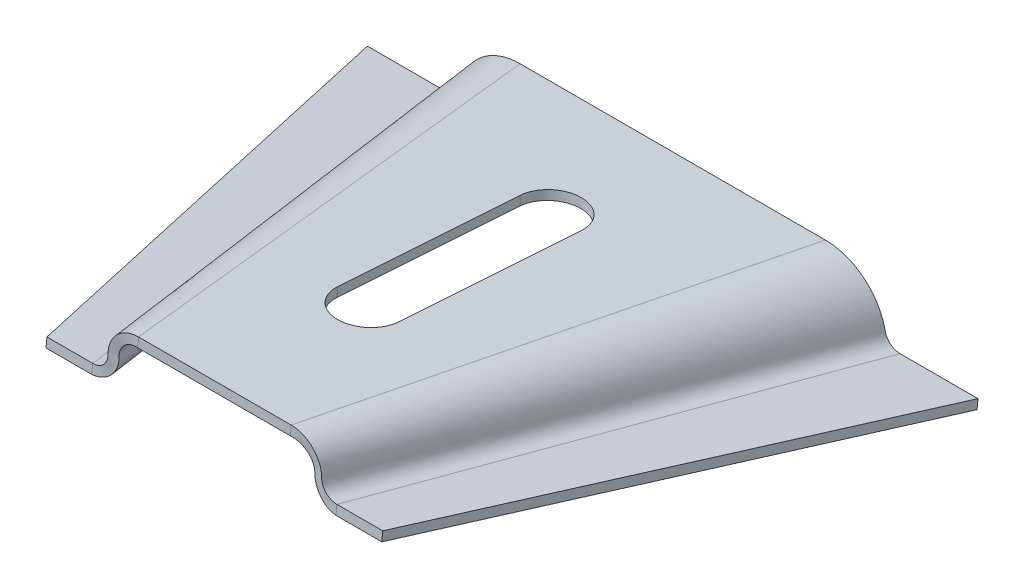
ISO-10303-21;
HEADER;
FILE_DESCRIPTION(('STEP AP214'),'2;1');
FILE_NAME('part.step','',(''),(''),'','','');
FILE_SCHEMA(('AUTOMOTIVE_DESIGN { 1 0 10303 214 1 1 1 1 }'));
ENDSEC;
DATA;
#1=APPLICATION_CONTEXT('core data for automotive mechanical design processes');
#2=APPLICATION_PROTOCOL_DEFINITION('international standard','automotive_design',2000,#1);
#3=PRODUCT_CONTEXT('',#1,'mechanical');
#4=PRODUCT('Part','Part','',(#3));
#5=PRODUCT_RELATED_PRODUCT_CATEGORY('part','',(#4));
#6=PRODUCT_DEFINITION_FORMATION('','',#4);
#7=PRODUCT_DEFINITION_CONTEXT('part definition',#1,'design');
#8=PRODUCT_DEFINITION('design','',#6,#7);
#9=PRODUCT_DEFINITION_SHAPE('','',#8);
#10=(LENGTH_UNIT() NAMED_UNIT(*) SI_UNIT(.MILLI.,.METRE.));
#11=(NAMED_UNIT(*) PLANE_ANGLE_UNIT() SI_UNIT($,.RADIAN.));
#12=(NAMED_UNIT(*) SI_UNIT($,.STERADIAN.) SOLID_ANGLE_UNIT());
#13=UNCERTAINTY_MEASURE_WITH_UNIT(LENGTH_MEASURE(1.E-05),#10,'distance_accuracy_value','');
#14=(GEOMETRIC_REPRESENTATION_CONTEXT(3) GLOBAL_UNCERTAINTY_ASSIGNED_CONTEXT((#13)) GLOBAL_UNIT_ASSIGNED_CONTEXT((#10,
#11,#12)) REPRESENTATION_CONTEXT('',''));
#15=CARTESIAN_POINT('',(0.,0.,0.));
#16=DIRECTION('',(0.,0.,1.));
#17=DIRECTION('',(1.,0.,0.));
#18=AXIS2_PLACEMENT_3D('',#15,#16,#17);
#19=CARTESIAN_POINT('',(-74.4948974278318,-20.,0.));
#20=DIRECTION('',(0.,-0.0995037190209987,-0.995037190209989));
#21=DIRECTION('',(-1.,0.,0.));
#22=AXIS2_PLACEMENT_3D('',#19,#20,#21);
#23=PLANE('',#22);
#24=DIRECTION('',(0.,-0.995037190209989,0.0995037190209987));
#25=VECTOR('',#24,1.);
#26=CARTESIAN_POINT('',(-100.,-20.,0.));
#27=LINE('',#26,#25);
#28=CARTESIAN_POINT('',(-100.,-20.,0.));
#29=VERTEX_POINT('',#28);
#30=CARTESIAN_POINT('',(-100.,-22.98511157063,0.298511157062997));
#31=VERTEX_POINT('',#30);
#32=EDGE_CURVE('E14',#29,#31,#27,.T.);
#33=ORIENTED_EDGE('',*,*,#32,.F.);
#34=DIRECTION('',(-1.,0.,0.));
#35=VECTOR('',#34,1.);
#36=CARTESIAN_POINT('',(-74.4948974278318,-20.,0.));
#37=LINE('',#36,#35);
#38=CARTESIAN_POINT('',(-74.4948974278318,-20.,0.));
#39=VERTEX_POINT('',#38);
#40=EDGE_CURVE('E412',#39,#29,#37,.T.);
#41=ORIENTED_EDGE('',*,*,#40,.F.);
#42=CARTESIAN_POINT('',(-74.4948974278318,-22.98511157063,0.298511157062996));
#43=CARTESIAN_POINT('',(-74.4948974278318,-20.,0.));
#44=B_SPLINE_CURVE_WITH_KNOTS('',1,(#42,#43),.UNSPECIFIED.,.F.,.F.,(2,2),(0.,1.),.UNSPECIFIED.);
#45=CARTESIAN_POINT('',(-74.4948974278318,-22.98511157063,0.298511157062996));
#46=VERTEX_POINT('',#45);
#47=EDGE_CURVE('E267',#39,#46,#44,.F.);
#48=ORIENTED_EDGE('',*,*,#47,.T.);
#49=DIRECTION('',(1.,0.,0.));
#50=VECTOR('',#49,1.);
#51=CARTESIAN_POINT('',(0.,-22.98511157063,0.298511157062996));
#52=LINE('',#51,#50);
#53=EDGE_CURVE('E416',#46,#31,#52,.F.);
#54=ORIENTED_EDGE('',*,*,#53,.T.);
#55=EDGE_LOOP('',(#33,#41,#48,#54));
#56=FACE_BOUND('',#55,.T.);
#57=ADVANCED_FACE('F255',(#56),#23,.T.);
#58=CARTESIAN_POINT('',(-74.4948974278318,-22.98511157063,0.298511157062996));
#59=CARTESIAN_POINT('',(-73.6915086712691,-22.9919380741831,0.230246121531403));
#60=CARTESIAN_POINT('',(-72.8822387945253,-22.875051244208,0.156167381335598));
#61=CARTESIAN_POINT('',(-71.3202129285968,-22.3895412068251,0.00506015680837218));
#62=CARTESIAN_POINT('',(-70.5555285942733,-22.0164219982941,-0.0751787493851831));
#63=CARTESIAN_POINT('',(-69.1516509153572,-21.0057064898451,-0.23167911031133));
#64=CARTESIAN_POINT('',(-68.4970575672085,-20.3593140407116,-0.312285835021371));
#65=CARTESIAN_POINT('',(-67.6780567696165,-19.1574273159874,-0.425643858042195));
#66=CARTESIAN_POINT('',(-67.4286143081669,-18.7109145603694,-0.463809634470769));
#67=CARTESIAN_POINT('',(-67.1147970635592,-17.9817418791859,-0.516250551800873));
#68=CARTESIAN_POINT('',(-67.0175855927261,-17.7224263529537,-0.53423460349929));
#69=CARTESIAN_POINT('',(-66.8898146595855,-17.3119963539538,-0.560382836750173));
#70=CARTESIAN_POINT('',(-66.8502146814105,-17.1716293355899,-0.568962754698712));
#71=CARTESIAN_POINT('',(-66.7959698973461,-16.9562201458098,-0.581463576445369));
#72=CARTESIAN_POINT('',(-66.7787458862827,-16.8836077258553,-0.585569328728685));
#73=CARTESIAN_POINT('',(-66.7542650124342,-16.7735360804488,-0.591618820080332));
#74=CARTESIAN_POINT('',(-66.7462586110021,-16.7362855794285,-0.593848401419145));
#75=CARTESIAN_POINT('',(-66.733079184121,-16.6722093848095,-0.597439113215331));
#76=CARTESIAN_POINT('',(-66.728647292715,-16.6503335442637,-0.598521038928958));
#77=CARTESIAN_POINT('',(-66.7218046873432,-16.6163682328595,-0.599815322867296));
#78=CARTESIAN_POINT('',(-66.7194864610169,-16.6048290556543,-0.60019583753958));
#79=CARTESIAN_POINT('',(-66.7159072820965,-16.5869866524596,-0.600694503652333));
#80=CARTESIAN_POINT('',(-66.7146971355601,-16.580949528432,-0.600848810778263));
#81=CARTESIAN_POINT('',(-66.7122341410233,-16.5686553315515,-0.601135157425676));
#82=CARTESIAN_POINT('',(-66.7105208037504,-16.559744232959,-0.601656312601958));
#83=CARTESIAN_POINT('',(-66.7031578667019,-16.5261344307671,-0.599250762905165));
#84=CARTESIAN_POINT('',(-66.6927275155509,-16.4775787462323,-0.597983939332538));
#85=CARTESIAN_POINT('',(-66.6696404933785,-16.3728319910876,-0.595175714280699));
#86=CARTESIAN_POINT('',(-66.6571665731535,-16.3173997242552,-0.593628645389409));
#87=CARTESIAN_POINT('',(-66.619727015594,-16.1551185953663,-0.588875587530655));
#88=CARTESIAN_POINT('',(-66.5936486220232,-16.0469256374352,-0.585680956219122));
#89=CARTESIAN_POINT('',(-66.5120488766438,-15.722432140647,-0.576017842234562));
#90=CARTESIAN_POINT('',(-66.4531626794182,-15.5062173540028,-0.569470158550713));
#91=CARTESIAN_POINT('',(-66.2629879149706,-14.858718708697,-0.549497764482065));
#92=CARTESIAN_POINT('',(-66.1181801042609,-14.428587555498,-0.535743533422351));
#93=CARTESIAN_POINT('',(-65.6293656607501,-13.1489908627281,-0.493059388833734));
#94=CARTESIAN_POINT('',(-65.230977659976,-12.3104598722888,-0.462688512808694));
#95=CARTESIAN_POINT('',(-63.8165981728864,-9.8835647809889,-0.365366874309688));
#96=CARTESIAN_POINT('',(-62.5696528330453,-8.36628014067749,-0.29643375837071));
#97=CARTESIAN_POINT('',(-59.592226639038,-5.82528655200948,-0.147162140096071));
#98=CARTESIAN_POINT('',(-57.8362765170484,-4.77971544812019,-0.0738880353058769));
#99=CARTESIAN_POINT('',(-54.067418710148,-3.3705664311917,0.0728996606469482));
#100=CARTESIAN_POINT('',(-52.0248422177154,-2.99734069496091,0.139778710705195));
#101=CARTESIAN_POINT('',(-50.,-2.99335547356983,0.199557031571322));
#102=CARTESIAN_POINT('',(-74.4948974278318,-20.,0.));
#103=CARTESIAN_POINT('',(-73.9912324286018,-20.,0.));
#104=CARTESIAN_POINT('',(-73.4875755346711,-19.9241057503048,0.));
#105=CARTESIAN_POINT('',(-72.5093327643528,-19.6173816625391,0.));
#106=CARTESIAN_POINT('',(-72.0347468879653,-19.3865518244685,0.));
#107=CARTESIAN_POINT('',(-71.1509312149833,-18.7564490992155,0.));
#108=CARTESIAN_POINT('',(-70.7406213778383,-18.3582498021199,0.));
#109=CARTESIAN_POINT('',(-70.218036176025,-17.6078558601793,0.));
#110=CARTESIAN_POINT('',(-70.0595910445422,-17.3319403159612,0.));
#111=CARTESIAN_POINT('',(-69.8554402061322,-16.8717677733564,0.));
#112=CARTESIAN_POINT('',(-69.7929760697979,-16.7106603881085,0.));
#113=CARTESIAN_POINT('',(-69.7102269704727,-16.4551341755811,0.));
#114=CARTESIAN_POINT('',(-69.6844684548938,-16.3676479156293,0.));
#115=CARTESIAN_POINT('',(-69.6488884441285,-16.232665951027,0.));
#116=CARTESIAN_POINT('',(-69.6375380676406,-16.1870465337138,0.));
#117=CARTESIAN_POINT('',(-69.6213170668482,-16.117643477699,0.));
#118=CARTESIAN_POINT('',(-69.6162724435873,-16.095465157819,0.));
#119=CARTESIAN_POINT('',(-69.6077131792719,-16.0560783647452,0.));
#120=CARTESIAN_POINT('',(-69.6046566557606,-16.0417431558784,0.));
#121=CARTESIAN_POINT('',(-69.5994701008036,-16.01697417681,0.));
#122=CARTESIAN_POINT('',(-69.597640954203,-16.0081734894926,0.));
#123=CARTESIAN_POINT('',(-69.5947097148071,-15.9939738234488,0.));
#124=CARTESIAN_POINT('',(-69.5937013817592,-15.9890741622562,0.));
#125=CARTESIAN_POINT('',(-69.5916160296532,-15.9789116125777,0.));
#126=CARTESIAN_POINT('',(-69.5905390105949,-15.9736487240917,0.));
#127=CARTESIAN_POINT('',(-69.5805089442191,-15.9245116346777,0.));
#128=CARTESIAN_POINT('',(-69.5687311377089,-15.86840465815,0.));
#129=CARTESIAN_POINT('',(-69.5426206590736,-15.7468723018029,0.));
#130=CARTESIAN_POINT('',(-69.5284401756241,-15.6821924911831,0.));
#131=CARTESIAN_POINT('',(-69.4856031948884,-15.4915219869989,0.));
#132=CARTESIAN_POINT('',(-69.4557380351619,-15.3644268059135,0.));
#133=CARTESIAN_POINT('',(-69.3622080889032,-14.9832931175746,0.));
#134=CARTESIAN_POINT('',(-69.294608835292,-14.7294064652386,0.));
#135=CARTESIAN_POINT('',(-69.0759696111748,-13.9691250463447,0.));
#136=CARTESIAN_POINT('',(-68.9090881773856,-13.4641088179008,0.));
#137=CARTESIAN_POINT('',(-68.3442492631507,-11.9607432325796,0.));
#138=CARTESIAN_POINT('',(-67.8820971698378,-10.9740769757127,0.));
#139=CARTESIAN_POINT('',(-66.2322323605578,-8.11016218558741,0.));
#140=CARTESIAN_POINT('',(-64.7811111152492,-6.32899763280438,0.));
#141=CARTESIAN_POINT('',(-61.2779041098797,-3.32213344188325,0.));
#142=CARTESIAN_POINT('',(-59.2258183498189,-2.09643380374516,0.));
#143=CARTESIAN_POINT('',(-54.7791952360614,-0.433842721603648,0.));
#144=CARTESIAN_POINT('',(-52.3851936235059,0.,0.));
#145=CARTESIAN_POINT('',(-50.,0.,0.));
#146=B_SPLINE_SURFACE_WITH_KNOTS('',1,3,((#58,#59,#60,#61,#62,#63,#64,#65,#66,#67,#68,#69,#70,
#71,#72,#73,#74,#75,#76,#77,#78,#79,#80,#81,#82,#83,#84,#85,#86,#87,#88,#89,#90,#91,#92,#93,#94,
#95,#96,#97,#98,#99,#100,#101),(#102,#103,#104,#105,#106,#107,#108,#109,#110,#111,#112,#113,
#114,#115,#116,#117,#118,#119,#120,#121,#122,#123,#124,#125,#126,#127,#128,#129,#130,#131,#132,
#133,#134,#135,#136,#137,#138,#139,#140,#141,#142,#143,#144,#145)),.UNSPECIFIED.,.F.,.F.,.F.,(2,
2),(4,2,2,2,2,2,2,2,2,2,2,2,2,2,2,2,2,2,2,2,2,4),(0.,1.),(0.,0.125,0.25,0.375,0.4375,0.46875,
0.484375,0.4921875,0.49609375,0.498046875,0.4990234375,0.49951171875,0.5,0.50390625,0.5078125,
0.515625,0.53125,0.5625,0.625,0.75,0.875,1.),.UNSPECIFIED.);
#147=CARTESIAN_POINT('',(-74.4948974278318,-20.,0.));
#148=CARTESIAN_POINT('',(-73.9912324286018,-20.,0.));
#149=CARTESIAN_POINT('',(-73.4875755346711,-19.9241057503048,0.));
#150=CARTESIAN_POINT('',(-72.5093327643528,-19.6173816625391,0.));
#151=CARTESIAN_POINT('',(-72.0347468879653,-19.3865518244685,0.));
#152=CARTESIAN_POINT('',(-71.1509312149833,-18.7564490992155,0.));
#153=CARTESIAN_POINT('',(-70.7406213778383,-18.3582498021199,0.));
#154=CARTESIAN_POINT('',(-70.218036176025,-17.6078558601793,0.));
#155=CARTESIAN_POINT('',(-70.0595910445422,-17.3319403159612,0.));
#156=CARTESIAN_POINT('',(-69.8554402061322,-16.8717677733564,0.));
#157=CARTESIAN_POINT('',(-69.7929760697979,-16.7106603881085,0.));
#158=CARTESIAN_POINT('',(-69.7102269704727,-16.4551341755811,0.));
#159=CARTESIAN_POINT('',(-69.6844684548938,-16.3676479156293,0.));
#160=CARTESIAN_POINT('',(-69.6488884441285,-16.232665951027,0.));
#161=CARTESIAN_POINT('',(-69.6375380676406,-16.1870465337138,0.));
#162=CARTESIAN_POINT('',(-69.6213170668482,-16.117643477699,0.));
#163=CARTESIAN_POINT('',(-69.6162724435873,-16.095465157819,0.));
#164=CARTESIAN_POINT('',(-69.6077131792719,-16.0560783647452,0.));
#165=CARTESIAN_POINT('',(-69.6046566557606,-16.0417431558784,0.));
#166=CARTESIAN_POINT('',(-69.5994701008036,-16.01697417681,0.));
#167=CARTESIAN_POINT('',(-69.597640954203,-16.0081734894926,0.));
#168=CARTESIAN_POINT('',(-69.5947097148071,-15.9939738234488,0.));
#169=CARTESIAN_POINT('',(-69.5937013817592,-15.9890741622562,0.));
#170=CARTESIAN_POINT('',(-69.5916160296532,-15.9789116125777,0.));
#171=CARTESIAN_POINT('',(-69.5905390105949,-15.9736487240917,0.));
#172=CARTESIAN_POINT('',(-69.5805089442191,-15.9245116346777,0.));
#173=CARTESIAN_POINT('',(-69.5687311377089,-15.86840465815,0.));
#174=CARTESIAN_POINT('',(-69.5426206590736,-15.7468723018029,0.));
#175=CARTESIAN_POINT('',(-69.5284401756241,-15.6821924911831,0.));
#176=CARTESIAN_POINT('',(-69.4856031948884,-15.4915219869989,0.));
#177=CARTESIAN_POINT('',(-69.4557380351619,-15.3644268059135,0.));
#178=CARTESIAN_POINT('',(-69.3622080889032,-14.9832931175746,0.));
#179=CARTESIAN_POINT('',(-69.294608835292,-14.7294064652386,0.));
#180=CARTESIAN_POINT('',(-69.0759696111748,-13.9691250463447,0.));
#181=CARTESIAN_POINT('',(-68.9090881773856,-13.4641088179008,0.));
#182=CARTESIAN_POINT('',(-68.3442492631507,-11.9607432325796,0.));
#183=CARTESIAN_POINT('',(-67.8820971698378,-10.9740769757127,0.));
#184=CARTESIAN_POINT('',(-66.2322323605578,-8.11016218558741,0.));
#185=CARTESIAN_POINT('',(-64.7811111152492,-6.32899763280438,0.));
#186=CARTESIAN_POINT('',(-61.2779041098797,-3.32213344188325,0.));
#187=CARTESIAN_POINT('',(-59.2258183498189,-2.09643380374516,0.));
#188=CARTESIAN_POINT('',(-54.7791952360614,-0.433842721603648,0.));
#189=CARTESIAN_POINT('',(-52.3851936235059,0.,0.));
#190=CARTESIAN_POINT('',(-50.,0.,0.));
#191=B_SPLINE_CURVE_WITH_KNOTS('',3,(#147,#148,#149,#150,#151,#152,#153,#154,#155,#156,#157,
#158,#159,#160,#161,#162,#163,#164,#165,#166,#167,#168,#169,#170,#171,#172,#173,#174,#175,#176,
#177,#178,#179,#180,#181,#182,#183,#184,#185,#186,#187,#188,#189,#190),.UNSPECIFIED.,.F.,.F.,(4,
2,2,2,2,2,2,2,2,2,2,2,2,2,2,2,2,2,2,2,2,4),(0.,0.125,0.25,0.375,0.4375,0.46875,0.484375,
0.4921875,0.49609375,0.498046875,0.4990234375,0.49951171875,0.5,0.50390625,0.5078125,0.515625,
0.53125,0.5625,0.625,0.75,0.875,1.),.UNSPECIFIED.);
#192=CARTESIAN_POINT('',(-50.,0.,0.));
#193=VERTEX_POINT('',#192);
#194=EDGE_CURVE('E429',#39,#193,#191,.T.);
#195=CARTESIAN_POINT('',(-50.,0.,0.));
#196=CARTESIAN_POINT('',(-50.,-2.99335547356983,0.199557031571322));
#197=B_SPLINE_CURVE_WITH_KNOTS('',1,(#195,#196),.UNSPECIFIED.,.F.,.F.,(2,2),(0.,1.),.UNSPECIFIED.);
#198=CARTESIAN_POINT('',(-50.,-2.99335547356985,0.199557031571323));
#199=VERTEX_POINT('',#198);
#200=EDGE_CURVE('E906',#193,#199,#197,.T.);
#201=CARTESIAN_POINT('',(-74.4948974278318,-22.9851115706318,0.298511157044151));
#202=CARTESIAN_POINT('',(-74.3943800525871,-22.9859670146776,0.289970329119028));
#203=CARTESIAN_POINT('',(-74.2938529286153,-22.98489610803,0.281348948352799));
#204=CARTESIAN_POINT('',(-74.0927597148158,-22.9788961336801,0.263945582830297));
#205=CARTESIAN_POINT('',(-73.9921938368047,-22.9739606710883,0.255163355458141));
#206=CARTESIAN_POINT('',(-73.7911483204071,-22.9602103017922,0.237450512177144));
#207=CARTESIAN_POINT('',(-73.6906692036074,-22.9513880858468,0.228519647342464));
#208=CARTESIAN_POINT('',(-73.4899252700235,-22.9298490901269,0.210523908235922));
#209=CARTESIAN_POINT('',(-73.3896613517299,-22.9171241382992,0.201458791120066));
#210=CARTESIAN_POINT('',(-73.1894783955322,-22.8877686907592,0.183210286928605));
#211=CARTESIAN_POINT('',(-73.0895606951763,-22.8711292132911,0.174026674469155));
#212=CARTESIAN_POINT('',(-72.8902029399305,-22.8339389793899,0.155559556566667));
#213=CARTESIAN_POINT('',(-72.790764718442,-22.8133784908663,0.146275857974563));
#214=CARTESIAN_POINT('',(-72.5925007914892,-22.7683462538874,0.127625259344));
#215=CARTESIAN_POINT('',(-72.4936774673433,-22.7438640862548,0.118258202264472));
#216=CARTESIAN_POINT('',(-72.2967786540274,-22.6909939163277,0.099471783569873));
#217=CARTESIAN_POINT('',(-72.1987061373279,-22.66259487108,0.0900523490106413));
#218=CARTESIAN_POINT('',(-72.0032705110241,-22.6018499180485,0.0711291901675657));
#219=CARTESIAN_POINT('',(-71.9059131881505,-22.569485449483,0.0616252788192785));
#220=CARTESIAN_POINT('',(-71.7118886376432,-22.5007246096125,0.0424946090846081));
#221=CARTESIAN_POINT('',(-71.6152306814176,-22.4643021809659,0.0328674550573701));
#222=CARTESIAN_POINT('',(-71.4227718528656,-22.3873878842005,0.0135187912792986));
#223=CARTESIAN_POINT('',(-71.326981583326,-22.3468695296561,0.00379709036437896));
#224=CARTESIAN_POINT('',(-71.1364330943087,-22.2617366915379,-0.0157215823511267));
#225=CARTESIAN_POINT('',(-71.0416868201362,-22.2170954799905,-0.0255186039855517));
#226=CARTESIAN_POINT('',(-70.8534068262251,-22.1237016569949,-0.0451627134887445));
#227=CARTESIAN_POINT('',(-70.7598863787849,-22.0749222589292,-0.0550096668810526));
#228=CARTESIAN_POINT('',(-70.5742425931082,-21.9732496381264,-0.0747249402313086));
#229=CARTESIAN_POINT('',(-70.4821338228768,-21.920329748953,-0.0845929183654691));
#230=CARTESIAN_POINT('',(-70.299500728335,-21.8103874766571,-0.104324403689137));
#231=CARTESIAN_POINT('',(-70.2089922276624,-21.7533387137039,-0.114187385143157));
#232=CARTESIAN_POINT('',(-70.0297449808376,-21.6351642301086,-0.13385924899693));
#233=CARTESIAN_POINT('',(-69.9410232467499,-21.5740125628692,-0.143667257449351));
#234=CARTESIAN_POINT('',(-69.7652833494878,-21.4474874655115,-0.163288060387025));
#235=CARTESIAN_POINT('',(-69.6782910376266,-21.3820779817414,-0.173099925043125));
#236=CARTESIAN_POINT('',(-69.5060096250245,-21.2468384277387,-0.192780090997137));
#237=CARTESIAN_POINT('',(-69.4207562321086,-21.1769627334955,-0.202647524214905));
#238=CARTESIAN_POINT('',(-69.25222684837,-21.0327836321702,-0.222381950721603));
#239=CARTESIAN_POINT('',(-69.1689884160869,-20.958436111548,-0.232247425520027));
#240=CARTESIAN_POINT('',(-69.0047630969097,-20.8053332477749,-0.251918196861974));
#241=CARTESIAN_POINT('',(-68.923815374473,-20.7265356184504,-0.261721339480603));
#242=CARTESIAN_POINT('',(-68.7642180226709,-20.5643418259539,-0.281309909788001));
#243=CARTESIAN_POINT('',(-68.6856193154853,-20.480895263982,-0.291092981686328));
#244=CARTESIAN_POINT('',(-68.5308513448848,-20.3091859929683,-0.310666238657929));
#245=CARTESIAN_POINT('',(-68.4547455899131,-20.2208657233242,-0.320453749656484));
#246=CARTESIAN_POINT('',(-68.3053408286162,-20.0394569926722,-0.339955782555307));
#247=CARTESIAN_POINT('',(-68.2321067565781,-19.9463146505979,-0.349666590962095));
#248=CARTESIAN_POINT('',(-68.0888045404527,-19.7553505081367,-0.36891864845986));
#249=CARTESIAN_POINT('',(-68.0188021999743,-19.6574788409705,-0.378455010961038));
#250=CARTESIAN_POINT('',(-67.8819700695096,-19.4566643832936,-0.397446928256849));
#251=CARTESIAN_POINT('',(-67.8152305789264,-19.353659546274,-0.406897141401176));
#252=CARTESIAN_POINT('',(-67.6851117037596,-19.142168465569,-0.425758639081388));
#253=CARTESIAN_POINT('',(-67.6218483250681,-19.0336102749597,-0.43516377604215));
#254=CARTESIAN_POINT('',(-67.4992325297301,-18.8111766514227,-0.453808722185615));
#255=CARTESIAN_POINT('',(-67.4399955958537,-18.6972368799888,-0.463040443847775));
#256=CARTESIAN_POINT('',(-67.3259193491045,-18.4642608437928,-0.481167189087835));
#257=CARTESIAN_POINT('',(-67.2711938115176,-18.3451680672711,-0.490051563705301));
#258=CARTESIAN_POINT('',(-67.1659662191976,-18.1006062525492,-0.507765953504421));
#259=CARTESIAN_POINT('',(-67.1156536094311,-17.9750548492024,-0.516585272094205));
#260=CARTESIAN_POINT('',(-67.0196479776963,-17.716384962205,-0.534241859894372));
#261=CARTESIAN_POINT('',(-66.9742237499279,-17.583165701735,-0.54306545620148));
#262=CARTESIAN_POINT('',(-66.8891046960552,-17.3096871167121,-0.560572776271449));
#263=CARTESIAN_POINT('',(-66.8496698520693,-17.1693455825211,-0.569240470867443));
#264=CARTESIAN_POINT('',(-66.7958161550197,-16.9556711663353,-0.581421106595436));
#265=CARTESIAN_POINT('',(-66.7785811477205,-16.8830620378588,-0.585385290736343));
#266=CARTESIAN_POINT('',(-66.7538142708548,-16.7714055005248,-0.591849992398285));
#267=CARTESIAN_POINT('',(-66.7455098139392,-16.7325200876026,-0.594169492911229));
#268=CARTESIAN_POINT('',(-66.732945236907,-16.6716285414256,-0.597409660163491));
#269=CARTESIAN_POINT('',(-66.7285028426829,-16.6496678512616,-0.598498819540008));
#270=CARTESIAN_POINT('',(-66.7217574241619,-16.6161065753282,-0.599850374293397));
#271=CARTESIAN_POINT('',(-66.7194362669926,-16.604518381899,-0.600260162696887));
#272=CARTESIAN_POINT('',(-66.7158820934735,-16.5868926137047,-0.600668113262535));
#273=CARTESIAN_POINT('',(-66.7146598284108,-16.580852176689,-0.600769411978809));
#274=CARTESIAN_POINT('',(-66.7122283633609,-16.5685344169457,-0.601222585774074));
#275=CARTESIAN_POINT('',(-66.711021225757,-16.5622564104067,-0.60158336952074));
#276=CARTESIAN_POINT('',(-66.7088498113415,-16.5519703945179,-0.601262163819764));
#277=CARTESIAN_POINT('',(-66.707949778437,-16.5479417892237,-0.600902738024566));
#278=CARTESIAN_POINT('',(-66.7060604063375,-16.5393402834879,-0.600328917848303));
#279=CARTESIAN_POINT('',(-66.7050749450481,-16.5347656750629,-0.600139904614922));
#280=CARTESIAN_POINT('',(-66.7018292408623,-16.5197371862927,-0.599526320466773));
#281=CARTESIAN_POINT('',(-66.6995585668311,-16.5092842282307,-0.59911124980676));
#282=CARTESIAN_POINT('',(-66.6919465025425,-16.4742871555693,-0.597866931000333));
#283=CARTESIAN_POINT('',(-66.6865913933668,-16.4497402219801,-0.597233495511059));
#284=CARTESIAN_POINT('',(-66.6692768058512,-16.3711790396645,-0.595140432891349));
#285=CARTESIAN_POINT('',(-66.6571161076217,-16.3172112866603,-0.593602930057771));
#286=CARTESIAN_POINT('',(-66.6196833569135,-16.1548683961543,-0.588908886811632));
#287=CARTESIAN_POINT('',(-66.5935926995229,-16.0466836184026,-0.585687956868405));
#288=CARTESIAN_POINT('',(-66.5118075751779,-15.7215120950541,-0.575961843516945));
#289=CARTESIAN_POINT('',(-66.4528981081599,-15.5053259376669,-0.569434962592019));
#290=CARTESIAN_POINT('',(-66.3261329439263,-15.0737026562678,-0.556136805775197));
#291=CARTESIAN_POINT('',(-66.258208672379,-14.8582857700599,-0.549363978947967));
#292=CARTESIAN_POINT('',(-66.1133865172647,-14.4287114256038,-0.535598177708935));
#293=CARTESIAN_POINT('',(-66.0364257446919,-14.2145751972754,-0.528603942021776));
#294=CARTESIAN_POINT('',(-65.873499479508,-13.7880729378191,-0.514378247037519));
#295=CARTESIAN_POINT('',(-65.7874756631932,-13.5757292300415,-0.507145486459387));
#296=CARTESIAN_POINT('',(-65.6064004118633,-13.1533042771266,-0.49243561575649));
#297=CARTESIAN_POINT('',(-65.5112941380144,-12.9432465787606,-0.484957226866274));
#298=CARTESIAN_POINT('',(-65.3120347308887,-12.525869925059,-0.469756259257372));
#299=CARTESIAN_POINT('',(-65.2078290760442,-12.3185760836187,-0.462032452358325));
#300=CARTESIAN_POINT('',(-64.9903481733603,-11.9071892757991,-0.446310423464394));
#301=CARTESIAN_POINT('',(-64.877021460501,-11.703123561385,-0.438310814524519));
#302=CARTESIAN_POINT('',(-64.6411396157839,-11.2983653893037,-0.422125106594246));
#303=CARTESIAN_POINT('',(-64.51852207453,-11.0977093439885,-0.413938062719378));
#304=CARTESIAN_POINT('',(-64.2641074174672,-10.7000319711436,-0.397454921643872));
#305=CARTESIAN_POINT('',(-64.1322444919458,-10.5030527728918,-0.389158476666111));
#306=CARTESIAN_POINT('',(-63.8595554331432,-10.1133492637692,-0.372421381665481));
#307=CARTESIAN_POINT('',(-63.7186731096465,-9.92066429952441,-0.363980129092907));
#308=CARTESIAN_POINT('',(-63.4281760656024,-9.54015002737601,-0.346951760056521));
#309=CARTESIAN_POINT('',(-63.2785136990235,-9.35235711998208,-0.338364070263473));
#310=CARTESIAN_POINT('',(-62.9706935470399,-8.98221122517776,-0.321033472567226));
#311=CARTESIAN_POINT('',(-62.812495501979,-8.79989174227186,-0.312289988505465));
#312=CARTESIAN_POINT('',(-62.4878457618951,-8.44125842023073,-0.294638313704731));
#313=CARTESIAN_POINT('',(-62.3213600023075,-8.26497544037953,-0.285729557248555));
#314=CARTESIAN_POINT('',(-61.9803786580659,-7.9189600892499,-0.267753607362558));
#315=CARTESIAN_POINT('',(-61.8058539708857,-7.74925641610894,-0.258685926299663));
#316=CARTESIAN_POINT('',(-61.4490347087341,-7.41692843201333,-0.240346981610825));
#317=CARTESIAN_POINT('',(-61.2667147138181,-7.25433143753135,-0.231075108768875));
#318=CARTESIAN_POINT('',(-60.8941903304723,-6.93640363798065,-0.212472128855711));
#319=CARTESIAN_POINT('',(-60.7039496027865,-6.78111541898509,-0.203140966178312));
#320=CARTESIAN_POINT('',(-60.3157112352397,-6.47792544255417,-0.18455130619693));
#321=CARTESIAN_POINT('',(-60.1176718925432,-6.3300770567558,-0.17529365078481));
#322=CARTESIAN_POINT('',(-59.7143539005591,-6.04227783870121,-0.15680010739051));
#323=CARTESIAN_POINT('',(-59.5090425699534,-5.90237278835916,-0.147564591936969));
#324=CARTESIAN_POINT('',(-59.0917108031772,-5.63094963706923,-0.129118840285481));
#325=CARTESIAN_POINT('',(-58.8796656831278,-5.49946947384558,-0.119908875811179));
#326=CARTESIAN_POINT('',(-58.4494033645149,-5.24536809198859,-0.10150447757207));
#327=CARTESIAN_POINT('',(-58.2311684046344,-5.12277693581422,-0.0923101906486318));
#328=CARTESIAN_POINT('',(-57.7890678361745,-4.88690574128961,-0.0739287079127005));
#329=CARTESIAN_POINT('',(-57.5651902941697,-4.77364806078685,-0.0647415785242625));
#330=CARTESIAN_POINT('',(-57.11234650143,-4.55687558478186,-0.0463817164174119));
#331=CARTESIAN_POINT('',(-56.8833730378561,-4.45337584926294,-0.0372090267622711));
#332=CARTESIAN_POINT('',(-56.4208773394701,-4.25653105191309,-0.0188327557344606));
#333=CARTESIAN_POINT('',(-56.1873515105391,-4.16319443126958,-0.00962915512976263));
#334=CARTESIAN_POINT('',(-55.715803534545,-3.98688547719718,0.00866173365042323));
#335=CARTESIAN_POINT('',(-55.4777723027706,-3.90393740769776,0.0177487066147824));
#336=CARTESIAN_POINT('',(-54.9974374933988,-3.7484312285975,0.0356767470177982));
#337=CARTESIAN_POINT('',(-54.7551221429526,-3.67590939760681,0.0445168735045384));
#338=CARTESIAN_POINT('',(-54.2669665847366,-3.5415075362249,0.0620036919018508));
#339=CARTESIAN_POINT('',(-54.0211196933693,-3.47965172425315,0.0706499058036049));
#340=CARTESIAN_POINT('',(-53.5266572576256,-3.36681120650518,0.0877591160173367));
#341=CARTESIAN_POINT('',(-53.2780390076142,-3.31583832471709,0.0962219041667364));
#342=CARTESIAN_POINT('',(-52.7786396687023,-3.22494488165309,0.112941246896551));
#343=CARTESIAN_POINT('',(-52.5278574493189,-3.18503050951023,0.121197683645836));
#344=CARTESIAN_POINT('',(-52.0247063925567,-3.11634575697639,0.137473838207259));
#345=CARTESIAN_POINT('',(-51.7723372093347,-3.08757789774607,0.14549350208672));
#346=CARTESIAN_POINT('',(-51.2667230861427,-3.04129172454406,0.161313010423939));
#347=CARTESIAN_POINT('',(-51.0134788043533,-3.02376627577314,0.169112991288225));
#348=CARTESIAN_POINT('',(-50.5068286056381,-3.00005764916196,0.184494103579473));
#349=CARTESIAN_POINT('',(-50.2534234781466,-2.99385777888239,0.192075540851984));
#350=CARTESIAN_POINT('',(-50.0000000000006,-2.99335547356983,0.199557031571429));
#351=B_SPLINE_CURVE_WITH_KNOTS('',3,(#201,#202,#203,#204,#205,#206,#207,#208,#209,#210,#211,
#212,#213,#214,#215,#216,#217,#218,#219,#220,#221,#222,#223,#224,#225,#226,#227,#228,#229,#230,
#231,#232,#233,#234,#235,#236,#237,#238,#239,#240,#241,#242,#243,#244,#245,#246,#247,#248,#249,
#250,#251,#252,#253,#254,#255,#256,#257,#258,#259,#260,#261,#262,#263,#264,#265,#266,#267,#268,
#269,#270,#271,#272,#273,#274,#275,#276,#277,#278,#279,#280,#281,#282,#283,#284,#285,#286,#287,
#288,#289,#290,#291,#292,#293,#294,#295,#296,#297,#298,#299,#300,#301,#302,#303,#304,#305,#306,
#307,#308,#309,#310,#311,#312,#313,#314,#315,#316,#317,#318,#319,#320,#321,#322,#323,#324,#325,
#326,#327,#328,#329,#330,#331,#332,#333,#334,#335,#336,#337,#338,#339,#340,#341,#342,#343,#344,
#345,#346,#347,#348,#349,#350),.UNSPECIFIED.,.F.,.F.,(4,2,2,2,2,2,2,2,2,2,2,2,2,2,2,2,2,2,2,2,2,
2,2,2,2,2,2,2,2,2,2,2,2,2,2,2,2,2,2,2,2,2,2,2,2,2,2,2,2,2,2,2,2,2,2,2,2,2,2,2,2,2,2,2,2,2,2,2,2,
2,2,2,2,2,4),(0.,0.302631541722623,0.605764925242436,0.909470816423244,1.21381703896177,
1.51886850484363,1.82468721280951,2.13133232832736,2.43886035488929,2.74788714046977,
3.05902709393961,3.37232624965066,3.68782209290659,4.00554399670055,4.32551404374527,
4.64774822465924,4.97225804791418,5.3000076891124,5.63192360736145,5.96794961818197,
6.30802055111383,6.65306492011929,7.00394069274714,7.36046678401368,7.72246232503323,
8.09162776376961,8.46947918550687,8.85557674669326,9.2495173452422,9.65597490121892,
10.0788554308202,10.5167171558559,10.7408868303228,10.8603688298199,10.9276666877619,
10.9631360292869,10.981634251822,11.0007998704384,11.0132140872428,11.0272656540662,
11.0593784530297,11.1347746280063,11.3007987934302,11.6347784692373,12.3070829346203,
12.9848309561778,13.6676116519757,14.3550910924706,15.0470212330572,15.7432489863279,
16.4437253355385,17.1494153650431,17.8607724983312,18.5771000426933,19.2977584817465,
20.0221778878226,20.7498706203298,21.480444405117,22.213615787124,22.9506328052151,
23.6923460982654,24.4379725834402,25.1867497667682,25.9379513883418,26.6909031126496,
27.4449985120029,28.1997155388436,28.9561636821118,29.7151833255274,30.4759043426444,
31.2374477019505,31.9994164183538,32.7615573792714,33.5232141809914,34.2837474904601),.UNSPECIFIED.);
#352=EDGE_CURVE('E869',#46,#199,#351,.T.);
#353=ORIENTED_EDGE('',*,*,#47,.F.);
#354=ORIENTED_EDGE('',*,*,#194,.T.);
#355=ORIENTED_EDGE('',*,*,#200,.T.);
#356=ORIENTED_EDGE('',*,*,#352,.F.);
#357=EDGE_LOOP('',(#353,#354,#355,#356));
#358=FACE_BOUND('',#357,.T.);
#359=ADVANCED_FACE('F590',(#358),#146,.T.);
#360=CARTESIAN_POINT('',(50.,0.,0.));
#361=DIRECTION('',(0.,-0.066519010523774,-0.997785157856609));
#362=DIRECTION('',(-1.,0.,0.));
#363=AXIS2_PLACEMENT_3D('',#360,#361,#362);
#364=PLANE('',#363);
#365=ORIENTED_EDGE('',*,*,#200,.F.);
#366=DIRECTION('',(-1.,0.,0.));
#367=VECTOR('',#366,1.);
#368=CARTESIAN_POINT('',(50.,0.,0.));
#369=LINE('',#368,#367);
#370=CARTESIAN_POINT('',(50.,0.,0.));
#371=VERTEX_POINT('',#370);
#372=EDGE_CURVE('E558',#371,#193,#369,.T.);
#373=ORIENTED_EDGE('',*,*,#372,.F.);
#374=CARTESIAN_POINT('',(50.,-2.99335547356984,0.199557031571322));
#375=CARTESIAN_POINT('',(50.,0.,0.));
#376=B_SPLINE_CURVE_WITH_KNOTS('',1,(#374,#375),.UNSPECIFIED.,.F.,.F.,(2,2),(0.,1.),.UNSPECIFIED.);
#377=CARTESIAN_POINT('',(50.,-2.99335547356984,0.199557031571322));
#378=VERTEX_POINT('',#377);
#379=EDGE_CURVE('E1187',#371,#378,#376,.F.);
#380=ORIENTED_EDGE('',*,*,#379,.T.);
#381=DIRECTION('',(1.,0.,0.));
#382=VECTOR('',#381,1.);
#383=CARTESIAN_POINT('',(0.,-2.99335547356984,0.199557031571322));
#384=LINE('',#383,#382);
#385=EDGE_CURVE('E740',#378,#199,#384,.F.);
#386=ORIENTED_EDGE('',*,*,#385,.T.);
#387=EDGE_LOOP('',(#365,#373,#380,#386));
#388=FACE_BOUND('',#387,.T.);
#389=ADVANCED_FACE('F989',(#388),#364,.T.);
#390=CARTESIAN_POINT('',(50.,-2.99335547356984,0.199557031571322));
#391=CARTESIAN_POINT('',(52.0248422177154,-2.99734069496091,0.139778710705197));
#392=CARTESIAN_POINT('',(54.067418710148,-3.3705664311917,0.0728996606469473));
#393=CARTESIAN_POINT('',(57.8362765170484,-4.77971544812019,-0.0738880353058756));
#394=CARTESIAN_POINT('',(59.5922266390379,-5.82528655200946,-0.14716214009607));
#395=CARTESIAN_POINT('',(62.5696528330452,-8.36628014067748,-0.296433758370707));
#396=CARTESIAN_POINT('',(63.8165981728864,-9.88356478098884,-0.365366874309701));
#397=CARTESIAN_POINT('',(65.230977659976,-12.3104598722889,-0.462688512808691));
#398=CARTESIAN_POINT('',(65.6293656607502,-13.1489908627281,-0.493059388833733));
#399=CARTESIAN_POINT('',(66.1181801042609,-14.428587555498,-0.53574353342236));
#400=CARTESIAN_POINT('',(66.2629879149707,-14.858718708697,-0.549497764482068));
#401=CARTESIAN_POINT('',(66.4531626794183,-15.5062173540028,-0.569470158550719));
#402=CARTESIAN_POINT('',(66.5120488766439,-15.7224321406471,-0.576017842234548));
#403=CARTESIAN_POINT('',(66.5936486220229,-16.046925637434,-0.585680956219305));
#404=CARTESIAN_POINT('',(66.619727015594,-16.1551185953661,-0.588875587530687));
#405=CARTESIAN_POINT('',(66.6571665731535,-16.3173997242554,-0.593628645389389));
#406=CARTESIAN_POINT('',(66.6696404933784,-16.3728319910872,-0.595175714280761));
#407=CARTESIAN_POINT('',(66.6869557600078,-16.4513920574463,-0.597281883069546));
#408=CARTESIAN_POINT('',(66.6924195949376,-16.4764325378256,-0.597976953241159));
#409=CARTESIAN_POINT('',(66.6997174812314,-16.5100296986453,-0.599120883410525));
#410=CARTESIAN_POINT('',(66.7019999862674,-16.5205649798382,-0.599519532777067));
#411=CARTESIAN_POINT('',(66.7051305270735,-16.5350044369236,-0.600169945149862));
#412=CARTESIAN_POINT('',(66.7061250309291,-16.5395894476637,-0.6003956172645));
#413=CARTESIAN_POINT('',(66.7080020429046,-16.548224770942,-0.60087153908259));
#414=CARTESIAN_POINT('',(66.7084241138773,-16.5496214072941,-0.601510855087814));
#415=CARTESIAN_POINT('',(66.7301600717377,-16.6582242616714,-0.599439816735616));
#416=CARTESIAN_POINT('',(66.7461047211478,-16.7368455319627,-0.593635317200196));
#417=CARTESIAN_POINT('',(66.7787458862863,-16.883607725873,-0.585569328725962));
#418=CARTESIAN_POINT('',(66.7959698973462,-16.9562201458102,-0.5814635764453));
#419=CARTESIAN_POINT('',(66.8502146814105,-17.1716293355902,-0.56896275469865));
#420=CARTESIAN_POINT('',(66.8898146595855,-17.3119963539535,-0.560382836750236));
#421=CARTESIAN_POINT('',(67.0175855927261,-17.7224263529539,-0.534234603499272));
#422=CARTESIAN_POINT('',(67.1147970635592,-17.9817418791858,-0.516250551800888));
#423=CARTESIAN_POINT('',(67.428614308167,-18.7109145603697,-0.463809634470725));
#424=CARTESIAN_POINT('',(67.6780567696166,-19.1574273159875,-0.425643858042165));
#425=CARTESIAN_POINT('',(68.4970575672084,-20.3593140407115,-0.312285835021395));
#426=CARTESIAN_POINT('',(69.1516509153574,-21.0057064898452,-0.231679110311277));
#427=CARTESIAN_POINT('',(70.5555285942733,-22.0164219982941,-0.0751787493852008));
#428=CARTESIAN_POINT('',(71.3202129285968,-22.3895412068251,0.00506015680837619));
#429=CARTESIAN_POINT('',(72.8822387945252,-22.875051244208,0.156167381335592));
#430=CARTESIAN_POINT('',(73.6915086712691,-22.9919380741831,0.230246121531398));
#431=CARTESIAN_POINT('',(74.4948974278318,-22.98511157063,0.298511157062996));
#432=CARTESIAN_POINT('',(50.,0.,0.));
#433=CARTESIAN_POINT('',(52.3851936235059,0.,0.));
#434=CARTESIAN_POINT('',(54.7791952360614,-0.43384272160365,0.));
#435=CARTESIAN_POINT('',(59.2258183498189,-2.09643380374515,0.));
#436=CARTESIAN_POINT('',(61.2779041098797,-3.32213344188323,0.));
#437=CARTESIAN_POINT('',(64.7811111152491,-6.32899763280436,0.));
#438=CARTESIAN_POINT('',(66.2322323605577,-8.11016218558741,0.));
#439=CARTESIAN_POINT('',(67.8820971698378,-10.9740769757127,0.));
#440=CARTESIAN_POINT('',(68.3442492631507,-11.9607432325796,0.));
#441=CARTESIAN_POINT('',(68.9090881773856,-13.4641088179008,0.));
#442=CARTESIAN_POINT('',(69.0759696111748,-13.9691250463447,0.));
#443=CARTESIAN_POINT('',(69.294608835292,-14.7294064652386,0.));
#444=CARTESIAN_POINT('',(69.3622080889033,-14.9832931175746,0.));
#445=CARTESIAN_POINT('',(69.4557380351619,-15.3644268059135,0.));
#446=CARTESIAN_POINT('',(69.4856031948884,-15.4915219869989,0.));
#447=CARTESIAN_POINT('',(69.5284401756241,-15.6821924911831,0.));
#448=CARTESIAN_POINT('',(69.5426206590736,-15.7468723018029,0.));
#449=CARTESIAN_POINT('',(69.56220351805,-15.8380215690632,0.));
#450=CARTESIAN_POINT('',(69.568411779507,-15.8672398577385,0.));
#451=CARTESIAN_POINT('',(69.5769479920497,-15.9078631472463,0.));
#452=CARTESIAN_POINT('',(69.5796640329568,-15.9208702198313,0.));
#453=CARTESIAN_POINT('',(69.5835069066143,-15.9393976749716,0.));
#454=CARTESIAN_POINT('',(69.5847493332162,-15.9454096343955,0.));
#455=CARTESIAN_POINT('',(69.587150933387,-15.957075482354,0.));
#456=CARTESIAN_POINT('',(69.5883101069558,-15.9627293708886,0.));
#457=CARTESIAN_POINT('',(69.6072557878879,-16.0555438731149,0.));
#458=CARTESIAN_POINT('',(69.615910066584,-16.0945091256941,0.));
#459=CARTESIAN_POINT('',(69.6375380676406,-16.1870465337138,0.));
#460=CARTESIAN_POINT('',(69.6488884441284,-16.232665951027,0.));
#461=CARTESIAN_POINT('',(69.6844684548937,-16.3676479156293,0.));
#462=CARTESIAN_POINT('',(69.7102269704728,-16.4551341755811,0.));
#463=CARTESIAN_POINT('',(69.7929760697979,-16.7106603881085,0.));
#464=CARTESIAN_POINT('',(69.8554402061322,-16.8717677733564,0.));
#465=CARTESIAN_POINT('',(70.0595910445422,-17.3319403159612,0.));
#466=CARTESIAN_POINT('',(70.2180361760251,-17.6078558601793,0.));
#467=CARTESIAN_POINT('',(70.7406213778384,-18.3582498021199,0.));
#468=CARTESIAN_POINT('',(71.1509312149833,-18.7564490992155,0.));
#469=CARTESIAN_POINT('',(72.0347468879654,-19.3865518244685,0.));
#470=CARTESIAN_POINT('',(72.5093327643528,-19.6173816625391,0.));
#471=CARTESIAN_POINT('',(73.4875755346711,-19.9241057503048,0.));
#472=CARTESIAN_POINT('',(73.9912324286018,-20.,0.));
#473=CARTESIAN_POINT('',(74.4948974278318,-20.,0.));
#474=B_SPLINE_SURFACE_WITH_KNOTS('',1,3,((#390,#391,#392,#393,#394,#395,#396,#397,#398,#399,
#400,#401,#402,#403,#404,#405,#406,#407,#408,#409,#410,#411,#412,#413,#414,#415,#416,#417,#418,
#419,#420,#421,#422,#423,#424,#425,#426,#427,#428,#429,#430,#431),(#432,#433,#434,#435,#436,
#437,#438,#439,#440,#441,#442,#443,#444,#445,#446,#447,#448,#449,#450,#451,#452,#453,#454,#455,
#456,#457,#458,#459,#460,#461,#462,#463,#464,#465,#466,#467,#468,#469,#470,#471,#472,#473)),
.UNSPECIFIED.,.F.,.F.,.F.,(2,2),(4,2,2,2,2,2,2,2,2,2,2,2,2,2,2,2,2,2,2,2,4),(0.,1.),(0.,0.125,
0.25,0.375,0.4375,0.46875,0.484375,0.4921875,0.49609375,0.498046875,0.4990234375,0.49951171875,
0.5,0.5078125,0.515625,0.53125,0.5625,0.625,0.75,0.875,1.),.UNSPECIFIED.);
#475=CARTESIAN_POINT('',(50.,0.,0.));
#476=CARTESIAN_POINT('',(52.3851936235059,0.,0.));
#477=CARTESIAN_POINT('',(54.7791952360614,-0.43384272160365,0.));
#478=CARTESIAN_POINT('',(59.2258183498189,-2.09643380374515,0.));
#479=CARTESIAN_POINT('',(61.2779041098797,-3.32213344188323,0.));
#480=CARTESIAN_POINT('',(64.7811111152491,-6.32899763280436,0.));
#481=CARTESIAN_POINT('',(66.2322323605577,-8.11016218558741,0.));
#482=CARTESIAN_POINT('',(67.8820971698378,-10.9740769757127,0.));
#483=CARTESIAN_POINT('',(68.3442492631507,-11.9607432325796,0.));
#484=CARTESIAN_POINT('',(68.9090881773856,-13.4641088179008,0.));
#485=CARTESIAN_POINT('',(69.0759696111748,-13.9691250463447,0.));
#486=CARTESIAN_POINT('',(69.294608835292,-14.7294064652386,0.));
#487=CARTESIAN_POINT('',(69.3622080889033,-14.9832931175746,0.));
#488=CARTESIAN_POINT('',(69.4557380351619,-15.3644268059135,0.));
#489=CARTESIAN_POINT('',(69.4856031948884,-15.4915219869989,0.));
#490=CARTESIAN_POINT('',(69.5284401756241,-15.6821924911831,0.));
#491=CARTESIAN_POINT('',(69.5426206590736,-15.7468723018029,0.));
#492=CARTESIAN_POINT('',(69.56220351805,-15.8380215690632,0.));
#493=CARTESIAN_POINT('',(69.568411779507,-15.8672398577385,0.));
#494=CARTESIAN_POINT('',(69.5769479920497,-15.9078631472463,0.));
#495=CARTESIAN_POINT('',(69.5796640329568,-15.9208702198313,0.));
#496=CARTESIAN_POINT('',(69.5835069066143,-15.9393976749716,0.));
#497=CARTESIAN_POINT('',(69.5847493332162,-15.9454096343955,0.));
#498=CARTESIAN_POINT('',(69.587150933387,-15.957075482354,0.));
#499=CARTESIAN_POINT('',(69.5883101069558,-15.9627293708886,0.));
#500=CARTESIAN_POINT('',(69.6072557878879,-16.0555438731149,0.));
#501=CARTESIAN_POINT('',(69.615910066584,-16.0945091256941,0.));
#502=CARTESIAN_POINT('',(69.6375380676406,-16.1870465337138,0.));
#503=CARTESIAN_POINT('',(69.6488884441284,-16.232665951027,0.));
#504=CARTESIAN_POINT('',(69.6844684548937,-16.3676479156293,0.));
#505=CARTESIAN_POINT('',(69.7102269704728,-16.4551341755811,0.));
#506=CARTESIAN_POINT('',(69.7929760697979,-16.7106603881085,0.));
#507=CARTESIAN_POINT('',(69.8554402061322,-16.8717677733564,0.));
#508=CARTESIAN_POINT('',(70.0595910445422,-17.3319403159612,0.));
#509=CARTESIAN_POINT('',(70.2180361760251,-17.6078558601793,0.));
#510=CARTESIAN_POINT('',(70.7406213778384,-18.3582498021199,0.));
#511=CARTESIAN_POINT('',(71.1509312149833,-18.7564490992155,0.));
#512=CARTESIAN_POINT('',(72.0347468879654,-19.3865518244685,0.));
#513=CARTESIAN_POINT('',(72.5093327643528,-19.6173816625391,0.));
#514=CARTESIAN_POINT('',(73.4875755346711,-19.9241057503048,0.));
#515=CARTESIAN_POINT('',(73.9912324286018,-20.,0.));
#516=CARTESIAN_POINT('',(74.4948974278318,-20.,0.));
#517=B_SPLINE_CURVE_WITH_KNOTS('',3,(#475,#476,#477,#478,#479,#480,#481,#482,#483,#484,#485,
#486,#487,#488,#489,#490,#491,#492,#493,#494,#495,#496,#497,#498,#499,#500,#501,#502,#503,#504,
#505,#506,#507,#508,#509,#510,#511,#512,#513,#514,#515,#516),.UNSPECIFIED.,.F.,.F.,(4,2,2,2,2,2,
2,2,2,2,2,2,2,2,2,2,2,2,2,2,4),(0.,0.125,0.25,0.375,0.4375,0.46875,0.484375,0.4921875,
0.49609375,0.498046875,0.4990234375,0.49951171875,0.5,0.5078125,0.515625,0.53125,0.5625,0.625,
0.75,0.875,1.),.UNSPECIFIED.);
#518=CARTESIAN_POINT('',(74.4948974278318,-20.,0.));
#519=VERTEX_POINT('',#518);
#520=EDGE_CURVE('E765',#371,#519,#517,.T.);
#521=CARTESIAN_POINT('',(74.4948974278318,-20.,0.));
#522=CARTESIAN_POINT('',(74.4948974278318,-22.98511157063,0.298511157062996));
#523=B_SPLINE_CURVE_WITH_KNOTS('',1,(#521,#522),.UNSPECIFIED.,.F.,.F.,(2,2),(0.,1.),.UNSPECIFIED.);
#524=CARTESIAN_POINT('',(74.4948974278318,-22.98511157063,0.298511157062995));
#525=VERTEX_POINT('',#524);
#526=EDGE_CURVE('E1224',#519,#525,#523,.T.);
#527=CARTESIAN_POINT('',(50.0000000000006,-2.99335547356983,0.199557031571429));
#528=CARTESIAN_POINT('',(50.2534234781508,-2.9938577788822,0.192075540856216));
#529=CARTESIAN_POINT('',(50.5068286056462,-3.00005764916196,0.184494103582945));
#530=CARTESIAN_POINT('',(51.0134788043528,-3.02376627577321,0.169112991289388));
#531=CARTESIAN_POINT('',(51.2667230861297,-3.04129172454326,0.161313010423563));
#532=CARTESIAN_POINT('',(51.7723372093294,-3.0875778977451,0.145493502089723));
#533=CARTESIAN_POINT('',(52.0247063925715,-3.11634575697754,0.137473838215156));
#534=CARTESIAN_POINT('',(52.5278574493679,-3.18503050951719,0.121197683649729));
#535=CARTESIAN_POINT('',(52.7786396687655,-3.2249448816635,0.112941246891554));
#536=CARTESIAN_POINT('',(53.278039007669,-3.31583832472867,0.0962219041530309));
#537=CARTESIAN_POINT('',(53.5266572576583,-3.36681120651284,0.0877591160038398));
#538=CARTESIAN_POINT('',(54.0211196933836,-3.47965172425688,0.0706499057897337));
#539=CARTESIAN_POINT('',(54.2669665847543,-3.54150753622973,0.0620036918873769));
#540=CARTESIAN_POINT('',(54.7551221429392,-3.67590939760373,0.0445168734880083));
#541=CARTESIAN_POINT('',(54.9974374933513,-3.74843122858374,0.0356767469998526));
#542=CARTESIAN_POINT('',(55.4777723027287,-3.90393740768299,0.0177487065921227));
#543=CARTESIAN_POINT('',(55.7158035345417,-3.98688547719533,0.00866173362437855));
#544=CARTESIAN_POINT('',(56.1873515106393,-4.16319443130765,-0.00962915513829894));
#545=CARTESIAN_POINT('',(56.4208773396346,-4.25653105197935,-0.0188327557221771));
#546=CARTESIAN_POINT('',(56.8833730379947,-4.45337584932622,-0.0372090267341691));
#547=CARTESIAN_POINT('',(57.1123465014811,-4.55687558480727,-0.0463817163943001));
#548=CARTESIAN_POINT('',(57.5651902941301,-4.7736480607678,-0.0647415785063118));
#549=CARTESIAN_POINT('',(57.78906783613,-4.88690574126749,-0.073928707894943));
#550=CARTESIAN_POINT('',(58.2311684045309,-5.12277693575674,-0.0923101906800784));
#551=CARTESIAN_POINT('',(58.4494033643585,-5.24536809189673,-0.101504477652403));
#552=CARTESIAN_POINT('',(58.8796656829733,-5.49946947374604,-0.119908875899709));
#553=CARTESIAN_POINT('',(59.091710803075,-5.63094963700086,-0.129118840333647));
#554=CARTESIAN_POINT('',(59.5090425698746,-5.90237278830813,-0.147564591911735));
#555=CARTESIAN_POINT('',(59.7143539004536,-6.04227783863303,-0.156800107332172));
#556=CARTESIAN_POINT('',(60.1176718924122,-6.33007705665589,-0.175293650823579));
#557=CARTESIAN_POINT('',(60.3157112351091,-6.4779254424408,-0.184551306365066));
#558=CARTESIAN_POINT('',(60.7039496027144,-6.78111541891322,-0.203140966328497));
#559=CARTESIAN_POINT('',(60.8941903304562,-6.93640363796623,-0.212472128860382));
#560=CARTESIAN_POINT('',(61.266714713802,-7.25433143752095,-0.231075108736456));
#561=CARTESIAN_POINT('',(61.449034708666,-7.4169284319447,-0.240346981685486));
#562=CARTESIAN_POINT('',(61.8058539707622,-7.74925641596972,-0.258685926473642));
#563=CARTESIAN_POINT('',(61.9803786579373,-7.91896008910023,-0.267753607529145));
#564=CARTESIAN_POINT('',(62.3213600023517,-8.26497544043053,-0.285729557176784));
#565=CARTESIAN_POINT('',(62.4878457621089,-8.44125842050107,-0.294638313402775));
#566=CARTESIAN_POINT('',(62.8124955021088,-8.79989174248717,-0.312289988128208));
#567=CARTESIAN_POINT('',(62.9706935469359,-8.98221122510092,-0.32103347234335));
#568=CARTESIAN_POINT('',(63.2785136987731,-9.35235711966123,-0.338364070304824));
#569=CARTESIAN_POINT('',(63.4281760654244,-9.54015002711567,-0.346951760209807));
#570=CARTESIAN_POINT('',(63.7186731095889,-9.92066429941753,-0.363980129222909));
#571=CARTESIAN_POINT('',(63.8595554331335,-10.1133492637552,-0.372421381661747));
#572=CARTESIAN_POINT('',(64.1322444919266,-10.5030527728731,-0.389158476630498));
#573=CARTESIAN_POINT('',(64.2641074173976,-10.7000319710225,-0.397454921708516));
#574=CARTESIAN_POINT('',(64.5185220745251,-11.0977093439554,-0.41393806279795));
#575=CARTESIAN_POINT('',(64.6411396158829,-11.298365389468,-0.422125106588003));
#576=CARTESIAN_POINT('',(64.8770214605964,-11.7031235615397,-0.438310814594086));
#577=CARTESIAN_POINT('',(64.9903481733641,-11.9071892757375,-0.446310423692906));
#578=CARTESIAN_POINT('',(65.2078290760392,-12.3185760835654,-0.462032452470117));
#579=CARTESIAN_POINT('',(65.3120347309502,-12.5258699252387,-0.469756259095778));
#580=CARTESIAN_POINT('',(65.5112941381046,-12.9432465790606,-0.484957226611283));
#581=CARTESIAN_POINT('',(65.6064004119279,-13.1533042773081,-0.49243561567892));
#582=CARTESIAN_POINT('',(65.7874756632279,-13.5757292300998,-0.507145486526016));
#583=CARTESIAN_POINT('',(65.8734994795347,-13.7880729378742,-0.514378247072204));
#584=CARTESIAN_POINT('',(66.036425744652,-14.2145751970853,-0.528603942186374));
#585=CARTESIAN_POINT('',(66.1133865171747,-14.4287114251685,-0.535598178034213));
#586=CARTESIAN_POINT('',(66.2582086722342,-14.8582857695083,-0.549363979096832));
#587=CARTESIAN_POINT('',(66.3261329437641,-15.0737026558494,-0.556136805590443));
#588=CARTESIAN_POINT('',(66.4528981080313,-15.5053259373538,-0.569434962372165));
#589=CARTESIAN_POINT('',(66.511807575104,-15.7215120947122,-0.575961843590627));
#590=CARTESIAN_POINT('',(66.5935926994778,-16.0466836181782,-0.585687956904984));
#591=CARTESIAN_POINT('',(66.6196833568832,-16.1548683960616,-0.588908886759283));
#592=CARTESIAN_POINT('',(66.6571161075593,-16.3172112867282,-0.593602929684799));
#593=CARTESIAN_POINT('',(66.6692768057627,-16.3711790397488,-0.595140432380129));
#594=CARTESIAN_POINT('',(66.6865913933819,-16.4497402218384,-0.597233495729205));
#595=CARTESIAN_POINT('',(66.6919465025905,-16.47428715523,-0.597866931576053));
#596=CARTESIAN_POINT('',(66.6995585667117,-16.5092842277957,-0.599111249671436));
#597=CARTESIAN_POINT('',(66.7018292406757,-16.5197371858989,-0.599526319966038));
#598=CARTESIAN_POINT('',(66.7050749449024,-16.5347656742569,-0.600139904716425));
#599=CARTESIAN_POINT('',(66.706060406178,-16.5393402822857,-0.600328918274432));
#600=CARTESIAN_POINT('',(66.7079497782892,-16.5479417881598,-0.600902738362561));
#601=CARTESIAN_POINT('',(66.7088498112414,-16.5519703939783,-0.601262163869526));
#602=CARTESIAN_POINT('',(66.7110212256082,-16.5622564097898,-0.601583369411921));
#603=CARTESIAN_POINT('',(66.7122283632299,-16.5685344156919,-0.601222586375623));
#604=CARTESIAN_POINT('',(66.7146598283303,-16.5808521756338,-0.600769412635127));
#605=CARTESIAN_POINT('',(66.715882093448,-16.5868926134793,-0.600668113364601));
#606=CARTESIAN_POINT('',(66.7194362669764,-16.6045183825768,-0.600260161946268));
#607=CARTESIAN_POINT('',(66.7217574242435,-16.6161065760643,-0.599850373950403));
#608=CARTESIAN_POINT('',(66.7285028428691,-16.6496678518,-0.598498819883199));
#609=CARTESIAN_POINT('',(66.7329452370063,-16.6716285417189,-0.597409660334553));
#610=CARTESIAN_POINT('',(66.745509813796,-16.7325200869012,-0.594169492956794));
#611=CARTESIAN_POINT('',(66.7538142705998,-16.7714054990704,-0.591849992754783));
#612=CARTESIAN_POINT('',(66.7785811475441,-16.8830620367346,-0.585385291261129));
#613=CARTESIAN_POINT('',(66.7958161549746,-16.9556711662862,-0.58142110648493));
#614=CARTESIAN_POINT('',(66.8496698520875,-17.1693455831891,-0.569240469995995));
#615=CARTESIAN_POINT('',(66.8891046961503,-17.3096871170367,-0.560572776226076));
#616=CARTESIAN_POINT('',(66.9742237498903,-17.5831657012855,-0.543065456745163));
#617=CARTESIAN_POINT('',(67.0196479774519,-17.7163849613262,-0.534241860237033));
#618=CARTESIAN_POINT('',(67.1156536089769,-17.9750548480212,-0.516585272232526));
#619=CARTESIAN_POINT('',(67.1659662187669,-18.1006062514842,-0.50776595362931));
#620=CARTESIAN_POINT('',(67.2711938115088,-18.3451680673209,-0.490051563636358));
#621=CARTESIAN_POINT('',(67.3259193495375,-18.4642608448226,-0.481167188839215));
#622=CARTESIAN_POINT('',(67.439995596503,-18.6972368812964,-0.463040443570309));
#623=CARTESIAN_POINT('',(67.4992325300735,-18.8111766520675,-0.453808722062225));
#624=CARTESIAN_POINT('',(67.6218483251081,-19.0336102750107,-0.435163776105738));
#625=CARTESIAN_POINT('',(67.685111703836,-19.14216846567,-0.425758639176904));
#626=CARTESIAN_POINT('',(67.8152305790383,-19.3536595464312,-0.406897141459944));
#627=CARTESIAN_POINT('',(67.8819700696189,-19.4566643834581,-0.397446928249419));
#628=CARTESIAN_POINT('',(68.018802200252,-19.6574788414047,-0.378455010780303));
#629=CARTESIAN_POINT('',(68.0888045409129,-19.7553505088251,-0.368918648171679));
#630=CARTESIAN_POINT('',(68.2321067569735,-19.9463146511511,-0.349666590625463));
#631=CARTESIAN_POINT('',(68.3053408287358,-20.0394569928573,-0.339955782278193));
#632=CARTESIAN_POINT('',(68.4547455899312,-20.2208657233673,-0.320453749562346));
#633=CARTESIAN_POINT('',(68.5308513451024,-20.3091859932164,-0.310666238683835));
#634=CARTESIAN_POINT('',(68.6856193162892,-20.4808952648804,-0.291092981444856));
#635=CARTESIAN_POINT('',(68.7642180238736,-20.5643418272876,-0.28130990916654));
#636=CARTESIAN_POINT('',(68.9238153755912,-20.7265356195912,-0.261721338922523));
#637=CARTESIAN_POINT('',(69.004763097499,-20.8053332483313,-0.251918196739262));
#638=CARTESIAN_POINT('',(69.1689884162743,-20.9584361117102,-0.2322474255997));
#639=CARTESIAN_POINT('',(69.252226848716,-21.0327836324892,-0.222381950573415));
#640=CARTESIAN_POINT('',(69.4207562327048,-21.1769627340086,-0.202647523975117));
#641=CARTESIAN_POINT('',(69.5060096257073,-21.2468384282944,-0.192780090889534));
#642=CARTESIAN_POINT('',(69.6782910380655,-21.38207798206,-0.173099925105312));
#643=CARTESIAN_POINT('',(69.7652833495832,-21.4474874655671,-0.163288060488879));
#644=CARTESIAN_POINT('',(69.9410232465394,-21.5740125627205,-0.143667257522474));
#645=CARTESIAN_POINT('',(70.0297449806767,-21.6351642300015,-0.133859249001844));
#646=CARTESIAN_POINT('',(70.208992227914,-21.753338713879,-0.114187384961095));
#647=CARTESIAN_POINT('',(70.2995007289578,-21.8103874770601,-0.104324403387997));
#648=CARTESIAN_POINT('',(70.4821338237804,-21.9203297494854,-0.0845929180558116));
#649=CARTESIAN_POINT('',(70.574242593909,-21.9732496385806,-0.0747249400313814));
#650=CARTESIAN_POINT('',(70.7598863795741,-22.0749222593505,-0.0550096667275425));
#651=CARTESIAN_POINT('',(70.8534068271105,-22.1237016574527,-0.0451627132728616));
#652=CARTESIAN_POINT('',(71.0416868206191,-22.2170954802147,-0.0255186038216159));
#653=CARTESIAN_POINT('',(71.1364330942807,-22.2617366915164,-0.0157215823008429));
#654=CARTESIAN_POINT('',(71.3269815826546,-22.346869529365,0.00379709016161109));
#655=CARTESIAN_POINT('',(71.4227718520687,-22.3873878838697,0.013518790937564));
#656=CARTESIAN_POINT('',(71.6152306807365,-22.4643021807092,0.03286745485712));
#657=CARTESIAN_POINT('',(71.7118886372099,-22.5007246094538,0.0424946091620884));
#658=CARTESIAN_POINT('',(71.9059131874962,-22.5694854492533,0.061625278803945));
#659=CARTESIAN_POINT('',(72.0032705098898,-22.6018499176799,0.0711291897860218));
#660=CARTESIAN_POINT('',(72.1987061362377,-22.662594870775,0.0900523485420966));
#661=CARTESIAN_POINT('',(72.2967786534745,-22.6909939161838,0.0994717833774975));
#662=CARTESIAN_POINT('',(72.4936774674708,-22.7438640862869,0.118258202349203));
#663=CARTESIAN_POINT('',(72.5925007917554,-22.768346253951,0.127625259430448));
#664=CARTESIAN_POINT('',(72.7907647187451,-22.8133784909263,0.146275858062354));
#665=CARTESIAN_POINT('',(72.8902029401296,-22.8339389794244,0.155559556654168));
#666=CARTESIAN_POINT('',(73.089560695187,-22.8711292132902,0.17402667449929));
#667=CARTESIAN_POINT('',(73.1894783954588,-22.8877686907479,0.183210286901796));
#668=CARTESIAN_POINT('',(73.3896613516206,-22.9171241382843,0.201458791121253));
#669=CARTESIAN_POINT('',(73.4899252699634,-22.9298490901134,0.210523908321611));
#670=CARTESIAN_POINT('',(73.6906692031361,-22.9513880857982,0.228519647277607));
#671=CARTESIAN_POINT('',(73.7911483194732,-22.9602103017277,0.23745051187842));
#672=CARTESIAN_POINT('',(73.9921938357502,-22.9739606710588,0.25516335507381));
#673=CARTESIAN_POINT('',(74.0927597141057,-22.9788961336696,0.263945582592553));
#674=CARTESIAN_POINT('',(74.2938529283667,-22.9848961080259,0.281348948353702));
#675=CARTESIAN_POINT('',(74.3943800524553,-22.98596701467,0.289970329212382));
#676=CARTESIAN_POINT('',(74.4948974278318,-22.9851115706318,0.298511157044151));
#677=B_SPLINE_CURVE_WITH_KNOTS('',3,(#527,#528,#529,#530,#531,#532,#533,#534,#535,#536,#537,
#538,#539,#540,#541,#542,#543,#544,#545,#546,#547,#548,#549,#550,#551,#552,#553,#554,#555,#556,
#557,#558,#559,#560,#561,#562,#563,#564,#565,#566,#567,#568,#569,#570,#571,#572,#573,#574,#575,
#576,#577,#578,#579,#580,#581,#582,#583,#584,#585,#586,#587,#588,#589,#590,#591,#592,#593,#594,
#595,#596,#597,#598,#599,#600,#601,#602,#603,#604,#605,#606,#607,#608,#609,#610,#611,#612,#613,
#614,#615,#616,#617,#618,#619,#620,#621,#622,#623,#624,#625,#626,#627,#628,#629,#630,#631,#632,
#633,#634,#635,#636,#637,#638,#639,#640,#641,#642,#643,#644,#645,#646,#647,#648,#649,#650,#651,
#652,#653,#654,#655,#656,#657,#658,#659,#660,#661,#662,#663,#664,#665,#666,#667,#668,#669,#670,
#671,#672,#673,#674,#675,#676),.UNSPECIFIED.,.F.,.F.,(4,2,2,2,2,2,2,2,2,2,2,2,2,2,2,2,2,2,2,2,2,
2,2,2,2,2,2,2,2,2,2,2,2,2,2,2,2,2,2,2,2,2,2,2,2,2,2,2,2,2,2,2,2,2,2,2,2,2,2,2,2,2,2,2,2,2,2,2,2,
2,2,2,2,2,4),(0.,0.760533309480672,1.52219011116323,2.28433107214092,3.04629978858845,
3.80784314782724,4.56856416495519,5.32758380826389,6.08403195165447,6.83874897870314,
7.59284437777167,8.34579610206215,9.09699772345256,9.84577490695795,10.5914013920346,
11.333114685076,12.0701317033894,12.803303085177,13.5338768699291,14.2615696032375,
14.9859890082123,15.7066474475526,16.4229749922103,17.13433212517,17.8400221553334,
18.5404985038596,19.2367262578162,19.9286563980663,20.6161358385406,21.2989165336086,
21.9766645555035,22.6489690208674,22.9829486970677,23.1489728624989,23.2243690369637,
23.2564818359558,23.2705334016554,23.2829476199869,23.3021132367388,23.3206114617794,
23.3560808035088,23.4233786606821,23.5428606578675,23.7670303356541,24.2048920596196,
24.6277725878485,25.0342301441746,25.4281707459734,25.8142683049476,26.1921197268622,
26.5612851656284,26.9232807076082,27.2798067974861,27.6306825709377,27.975726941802,
28.3157978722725,28.6518238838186,28.9837398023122,29.3114894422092,29.635999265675,
29.9582334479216,30.2782034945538,30.5959253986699,30.9114212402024,31.2247203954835,
31.5358603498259,31.8448871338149,32.1524151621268,32.4590602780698,32.7648789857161,
33.0699304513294,33.3742766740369,33.6779825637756,33.9811159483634,34.2837474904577),.UNSPECIFIED.);
#678=EDGE_CURVE('E745',#378,#525,#677,.T.);
#679=ORIENTED_EDGE('',*,*,#379,.F.);
#680=ORIENTED_EDGE('',*,*,#520,.T.);
#681=ORIENTED_EDGE('',*,*,#526,.T.);
#682=ORIENTED_EDGE('',*,*,#678,.F.);
#683=EDGE_LOOP('',(#679,#680,#681,#682));
#684=FACE_BOUND('',#683,.T.);
#685=ADVANCED_FACE('F257',(#684),#474,.T.);
#686=CARTESIAN_POINT('',(100.,-20.,0.));
#687=DIRECTION('',(0.,-0.0995037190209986,-0.995037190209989));
#688=DIRECTION('',(-1.,0.,0.));
#689=AXIS2_PLACEMENT_3D('',#686,#687,#688);
#690=PLANE('',#689);
#691=ORIENTED_EDGE('',*,*,#526,.F.);
#692=DIRECTION('',(-1.,0.,0.));
#693=VECTOR('',#692,1.);
#694=CARTESIAN_POINT('',(100.,-20.,0.));
#695=LINE('',#694,#693);
#696=CARTESIAN_POINT('',(100.,-20.,0.));
#697=VERTEX_POINT('',#696);
#698=EDGE_CURVE('E792',#697,#519,#695,.T.);
#699=ORIENTED_EDGE('',*,*,#698,.F.);
#700=DIRECTION('',(0.,-0.995037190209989,0.0995037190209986));
#701=VECTOR('',#700,1.);
#702=CARTESIAN_POINT('',(100.,-20.,0.));
#703=LINE('',#702,#701);
#704=CARTESIAN_POINT('',(100.,-22.98511157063,0.298511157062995));
#705=VERTEX_POINT('',#704);
#706=EDGE_CURVE('E1225',#697,#705,#703,.T.);
#707=ORIENTED_EDGE('',*,*,#706,.T.);
#708=DIRECTION('',(1.,0.,0.));
#709=VECTOR('',#708,1.);
#710=CARTESIAN_POINT('',(0.,-22.98511157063,0.298511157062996));
#711=LINE('',#710,#709);
#712=EDGE_CURVE('E733',#705,#525,#711,.F.);
#713=ORIENTED_EDGE('',*,*,#712,.T.);
#714=EDGE_LOOP('',(#691,#699,#707,#713));
#715=FACE_BOUND('',#714,.T.);
#716=ADVANCED_FACE('F974',(#715),#690,.T.);
#717=CARTESIAN_POINT('',(100.,-20.,0.));
#718=DIRECTION('',(-0.958218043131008,-0.0284619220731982,-0.284619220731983));
#719=DIRECTION('',(-0.286038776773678,0.0953462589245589,0.953462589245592));
#720=AXIS2_PLACEMENT_3D('',#717,#718,#719);
#721=PLANE('',#720);
#722=ORIENTED_EDGE('',*,*,#706,.F.);
#723=DIRECTION('',(-0.286038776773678,0.0953462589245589,0.953462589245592));
#724=VECTOR('',#723,1.);
#725=CARTESIAN_POINT('',(100.,-20.,0.));
#726=LINE('',#725,#724);
#727=CARTESIAN_POINT('',(55.,-5.00000000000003,150.));
#728=VERTEX_POINT('',#727);
#729=EDGE_CURVE('E404',#697,#728,#726,.T.);
#730=ORIENTED_EDGE('',*,*,#729,.T.);
#731=DIRECTION('',(0.,-0.995037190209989,0.0995037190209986));
#732=VECTOR('',#731,1.);
#733=CARTESIAN_POINT('',(55.,-5.00000000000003,150.));
#734=LINE('',#733,#732);
#735=CARTESIAN_POINT('',(55.,-7.98511157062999,150.298511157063));
#736=VERTEX_POINT('',#735);
#737=EDGE_CURVE('E683',#728,#736,#734,.T.);
#738=ORIENTED_EDGE('',*,*,#737,.T.);
#739=DIRECTION('',(-0.286038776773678,0.0953462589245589,0.953462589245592));
#740=VECTOR('',#739,1.);
#741=CARTESIAN_POINT('',(100.,-22.98511157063,0.298511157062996));
#742=LINE('',#741,#740);
#743=EDGE_CURVE('E408',#705,#736,#742,.T.);
#744=ORIENTED_EDGE('',*,*,#743,.F.);
#745=EDGE_LOOP('',(#722,#730,#738,#744));
#746=FACE_BOUND('',#745,.T.);
#747=ADVANCED_FACE('F966',(#746),#721,.F.);
#748=CARTESIAN_POINT('',(40.,-5.00000000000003,150.));
#749=DIRECTION('',(0.,0.0995037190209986,0.995037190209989));
#750=DIRECTION('',(1.,0.,0.));
#751=AXIS2_PLACEMENT_3D('',#748,#749,#750);
#752=PLANE('',#751);
#753=ORIENTED_EDGE('',*,*,#737,.F.);
#754=DIRECTION('',(1.,0.,0.));
#755=VECTOR('',#754,1.);
#756=CARTESIAN_POINT('',(40.,-5.00000000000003,150.));
#757=LINE('',#756,#755);
#758=CARTESIAN_POINT('',(40.,-5.00000000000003,150.));
#759=VERTEX_POINT('',#758);
#760=EDGE_CURVE('E424',#759,#728,#757,.T.);
#761=ORIENTED_EDGE('',*,*,#760,.F.);
#762=CARTESIAN_POINT('',(40.,-7.98511157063,150.298511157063));
#763=CARTESIAN_POINT('',(40.,-5.00000000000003,150.));
#764=B_SPLINE_CURVE_WITH_KNOTS('',1,(#762,#763),.UNSPECIFIED.,.F.,.F.,(2,2),(0.,1.),.UNSPECIFIED.);
#765=CARTESIAN_POINT('',(40.,-7.98511157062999,150.298511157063));
#766=VERTEX_POINT('',#765);
#767=EDGE_CURVE('E665',#759,#766,#764,.F.);
#768=ORIENTED_EDGE('',*,*,#767,.T.);
#769=DIRECTION('',(1.,0.,0.));
#770=VECTOR('',#769,1.);
#771=CARTESIAN_POINT('',(0.,-7.98511157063,150.298511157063));
#772=LINE('',#771,#770);
#773=EDGE_CURVE('E411',#766,#736,#772,.T.);
#774=ORIENTED_EDGE('',*,*,#773,.T.);
#775=EDGE_LOOP('',(#753,#761,#768,#774));
#776=FACE_BOUND('',#775,.T.);
#777=ADVANCED_FACE('F644',(#776),#752,.T.);
#778=CARTESIAN_POINT('',(25.,7.00664452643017,150.199557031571));
#779=CARTESIAN_POINT('',(25.8781483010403,7.00245568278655,150.136724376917));
#780=CARTESIAN_POINT('',(26.76152203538,6.83188549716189,150.065402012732));
#781=CARTESIAN_POINT('',(28.4028033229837,6.18124153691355,149.909455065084));
#782=CARTESIAN_POINT('',(29.1754768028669,5.69546373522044,149.828047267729));
#783=CARTESIAN_POINT('',(30.4945309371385,4.4583795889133,149.664458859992));
#784=CARTESIAN_POINT('',(31.051020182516,3.69759224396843,149.585147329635));
#785=CARTESIAN_POINT('',(31.6383300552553,2.40845611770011,149.476164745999));
#786=CARTESIAN_POINT('',(31.7942678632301,1.95094577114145,149.442132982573));
#787=CARTESIAN_POINT('',(31.9564586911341,1.23718825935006,149.395118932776));
#788=CARTESIAN_POINT('',(31.9986024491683,0.99466628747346,149.380128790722));
#789=CARTESIAN_POINT('',(32.0426251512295,0.625447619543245,149.35881812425));
#790=CARTESIAN_POINT('',(32.0541011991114,0.501465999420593,149.351910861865));
#791=CARTESIAN_POINT('',(32.0663544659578,0.314286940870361,149.341867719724));
#792=CARTESIAN_POINT('',(32.0696120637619,0.25169261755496,149.338572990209));
#793=CARTESIAN_POINT('',(32.0732373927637,0.157516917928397,149.333713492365));
#794=CARTESIAN_POINT('',(32.0742408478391,0.124981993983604,149.332136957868));
#795=CARTESIAN_POINT('',(32.0753830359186,0.0784536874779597,149.329995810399));
#796=CARTESIAN_POINT('',(32.0757034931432,0.0637255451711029,149.329291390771));
#797=CARTESIAN_POINT('',(32.0761150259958,0.0449156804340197,149.328143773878));
#798=CARTESIAN_POINT('',(32.0762409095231,0.0391971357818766,149.327745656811));
#799=CARTESIAN_POINT('',(32.0764211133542,0.0318292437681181,149.327100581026));
#800=CARTESIAN_POINT('',(32.0764798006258,0.0295761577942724,149.326877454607));
#801=CARTESIAN_POINT('',(32.0765969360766,0.0255628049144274,149.326408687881));
#802=CARTESIAN_POINT('',(32.0767264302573,0.0268469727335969,149.325854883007));
#803=CARTESIAN_POINT('',(32.0765423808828,-0.0496959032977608,149.326653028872));
#804=CARTESIAN_POINT('',(32.0764338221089,-0.106264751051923,149.329444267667));
#805=CARTESIAN_POINT('',(32.0777169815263,-0.213107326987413,149.333261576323));
#806=CARTESIAN_POINT('',(32.078893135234,-0.266719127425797,149.335222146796));
#807=CARTESIAN_POINT('',(32.084059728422,-0.428105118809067,149.341262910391));
#808=CARTESIAN_POINT('',(32.0896879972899,-0.536430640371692,149.345502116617));
#809=CARTESIAN_POINT('',(32.1134121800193,-0.863418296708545,149.358884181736));
#810=CARTESIAN_POINT('',(32.1383454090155,-1.08410454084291,149.368691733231));
#811=CARTESIAN_POINT('',(32.2429292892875,-1.7522536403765,149.401008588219));
#812=CARTESIAN_POINT('',(32.352445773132,-2.20603412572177,149.426453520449));
#813=CARTESIAN_POINT('',(32.8193367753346,-3.56861450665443,149.515165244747));
#814=CARTESIAN_POINT('',(33.3095932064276,-4.47063092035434,149.588630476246));
#815=CARTESIAN_POINT('',(34.3696585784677,-5.69192630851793,149.727349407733));
#816=CARTESIAN_POINT('',(34.7676051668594,-6.06533548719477,149.774866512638));
#817=CARTESIAN_POINT('',(35.6493194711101,-6.73339756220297,149.875086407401));
#818=CARTESIAN_POINT('',(36.1334504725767,-7.02808410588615,149.927878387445));
#819=CARTESIAN_POINT('',(37.1856169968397,-7.51179579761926,150.040078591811));
#820=CARTESIAN_POINT('',(37.7319380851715,-7.69109904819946,150.093420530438));
#821=CARTESIAN_POINT('',(38.8496223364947,-7.93025003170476,150.19737621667));
#822=CARTESIAN_POINT('',(39.4213157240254,-7.99015498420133,150.24807702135));
#823=CARTESIAN_POINT('',(40.,-7.98511157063,150.298511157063));
#824=CARTESIAN_POINT('',(25.,9.99999999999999,150.));
#825=CARTESIAN_POINT('',(26.2563893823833,9.99999999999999,150.));
#826=CARTESIAN_POINT('',(27.5127798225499,9.76167420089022,150.));
#827=CARTESIAN_POINT('',(29.8647311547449,8.82829577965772,150.));
#828=CARTESIAN_POINT('',(30.9602920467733,8.13324315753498,150.));
#829=CARTESIAN_POINT('',(32.8328507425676,6.34982727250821,150.));
#830=CARTESIAN_POINT('',(33.6098485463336,5.26146400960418,150.));
#831=CARTESIAN_POINT('',(34.4225295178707,3.41601754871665,150.));
#832=CARTESIAN_POINT('',(34.6346205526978,2.76538513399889,150.));
#833=CARTESIAN_POINT('',(34.8511719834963,1.75224793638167,150.));
#834=CARTESIAN_POINT('',(34.9064249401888,1.4083374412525,150.));
#835=CARTESIAN_POINT('',(34.9622354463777,0.885179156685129,150.));
#836=CARTESIAN_POINT('',(34.976327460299,0.709577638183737,150.));
#837=CARTESIAN_POINT('',(34.9904891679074,0.444602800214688,150.));
#838=CARTESIAN_POINT('',(34.9940470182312,0.356015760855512,150.));
#839=CARTESIAN_POINT('',(34.997613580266,0.222773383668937,150.));
#840=CARTESIAN_POINT('',(34.9985073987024,0.177513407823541,150.));
#841=CARTESIAN_POINT('',(34.9994023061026,0.113661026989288,150.));
#842=CARTESIAN_POINT('',(34.9996263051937,0.0931807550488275,150.));
#843=CARTESIAN_POINT('',(34.9998504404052,0.0646894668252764,150.));
#844=CARTESIAN_POINT('',(34.9999065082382,0.0555638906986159,150.));
#845=CARTESIAN_POINT('',(34.9999625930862,0.0425607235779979,150.));
#846=CARTESIAN_POINT('',(34.999976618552,0.038340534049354,150.));
#847=CARTESIAN_POINT('',(34.9999953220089,0.0301498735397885,150.));
#848=CARTESIAN_POINT('',(35.,0.0261794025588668,150.));
#849=CARTESIAN_POINT('',(35.,-0.0390147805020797,150.));
#850=CARTESIAN_POINT('',(35.0003362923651,-0.0669916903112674,150.));
#851=CARTESIAN_POINT('',(35.0016959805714,-0.134369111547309,150.));
#852=CARTESIAN_POINT('',(35.0027193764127,-0.168183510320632,150.));
#853=CARTESIAN_POINT('',(35.0068419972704,-0.269977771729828,150.));
#854=CARTESIAN_POINT('',(35.0109936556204,-0.338308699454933,150.));
#855=CARTESIAN_POINT('',(35.0278325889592,-0.544497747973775,150.));
#856=CARTESIAN_POINT('',(35.0449038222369,-0.683552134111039,150.));
#857=CARTESIAN_POINT('',(35.1150471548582,-1.10383639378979,150.));
#858=CARTESIAN_POINT('',(35.1870488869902,-1.38818736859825,150.));
#859=CARTESIAN_POINT('',(35.4899230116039,-2.24041301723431,150.));
#860=CARTESIAN_POINT('',(35.8076643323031,-2.80746041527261,150.));
#861=CARTESIAN_POINT('',(36.4727152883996,-3.55961671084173,150.));
#862=CARTESIAN_POINT('',(36.7258054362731,-3.79393300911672,150.));
#863=CARTESIAN_POINT('',(37.283099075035,-4.21156025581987,150.));
#864=CARTESIAN_POINT('',(37.5873025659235,-4.39487120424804,150.));
#865=CARTESIAN_POINT('',(38.2351232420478,-4.69228733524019,150.));
#866=CARTESIAN_POINT('',(38.5787404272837,-4.80639251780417,150.));
#867=CARTESIAN_POINT('',(39.2825992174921,-4.96024885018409,150.));
#868=CARTESIAN_POINT('',(39.6428408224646,-5.00000000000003,150.));
#869=CARTESIAN_POINT('',(40.,-5.00000000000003,150.));
#870=B_SPLINE_SURFACE_WITH_KNOTS('',1,3,((#778,#779,#780,#781,#782,#783,#784,#785,#786,#787,
#788,#789,#790,#791,#792,#793,#794,#795,#796,#797,#798,#799,#800,#801,#802,#803,#804,#805,#806,
#807,#808,#809,#810,#811,#812,#813,#814,#815,#816,#817,#818,#819,#820,#821,#822,#823),(#824,
#825,#826,#827,#828,#829,#830,#831,#832,#833,#834,#835,#836,#837,#838,#839,#840,#841,#842,#843,
#844,#845,#846,#847,#848,#849,#850,#851,#852,#853,#854,#855,#856,#857,#858,#859,#860,#861,#862,
#863,#864,#865,#866,#867,#868,#869)),.UNSPECIFIED.,.F.,.F.,.F.,(2,2),(4,2,2,2,2,2,2,2,2,2,2,2,2,
2,2,2,2,2,2,2,2,2,4),(0.,1.),(0.,0.125,0.25,0.375,0.4375,0.46875,0.484375,0.4921875,0.49609375,
0.498046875,0.4990234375,0.49951171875,0.5,0.5078125,0.515625,0.53125,0.5625,0.625,0.75,0.8125,
0.875,0.9375,1.),.UNSPECIFIED.);
#871=CARTESIAN_POINT('',(40.,-5.00000000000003,150.));
#872=CARTESIAN_POINT('',(39.6428408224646,-5.00000000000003,150.));
#873=CARTESIAN_POINT('',(39.2825992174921,-4.96024885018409,150.));
#874=CARTESIAN_POINT('',(38.5787404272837,-4.80639251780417,150.));
#875=CARTESIAN_POINT('',(38.2351232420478,-4.69228733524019,150.));
#876=CARTESIAN_POINT('',(37.5873025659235,-4.39487120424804,150.));
#877=CARTESIAN_POINT('',(37.283099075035,-4.21156025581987,150.));
#878=CARTESIAN_POINT('',(36.7258054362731,-3.79393300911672,150.));
#879=CARTESIAN_POINT('',(36.4727152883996,-3.55961671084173,150.));
#880=CARTESIAN_POINT('',(35.8076643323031,-2.80746041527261,150.));
#881=CARTESIAN_POINT('',(35.4899230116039,-2.24041301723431,150.));
#882=CARTESIAN_POINT('',(35.1870488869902,-1.38818736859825,150.));
#883=CARTESIAN_POINT('',(35.1150471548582,-1.10383639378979,150.));
#884=CARTESIAN_POINT('',(35.0449038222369,-0.683552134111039,150.));
#885=CARTESIAN_POINT('',(35.0278325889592,-0.544497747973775,150.));
#886=CARTESIAN_POINT('',(35.0109936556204,-0.338308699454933,150.));
#887=CARTESIAN_POINT('',(35.0068419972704,-0.269977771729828,150.));
#888=CARTESIAN_POINT('',(35.0027193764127,-0.168183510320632,150.));
#889=CARTESIAN_POINT('',(35.0016959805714,-0.134369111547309,150.));
#890=CARTESIAN_POINT('',(35.0003362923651,-0.0669916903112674,150.));
#891=CARTESIAN_POINT('',(35.,-0.0390147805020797,150.));
#892=CARTESIAN_POINT('',(35.,0.0261794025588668,150.));
#893=CARTESIAN_POINT('',(34.9999953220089,0.0301498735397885,150.));
#894=CARTESIAN_POINT('',(34.999976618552,0.038340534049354,150.));
#895=CARTESIAN_POINT('',(34.9999625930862,0.0425607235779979,150.));
#896=CARTESIAN_POINT('',(34.9999065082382,0.0555638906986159,150.));
#897=CARTESIAN_POINT('',(34.9998504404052,0.0646894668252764,150.));
#898=CARTESIAN_POINT('',(34.9996263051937,0.0931807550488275,150.));
#899=CARTESIAN_POINT('',(34.9994023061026,0.113661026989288,150.));
#900=CARTESIAN_POINT('',(34.9985073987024,0.177513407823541,150.));
#901=CARTESIAN_POINT('',(34.997613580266,0.222773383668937,150.));
#902=CARTESIAN_POINT('',(34.9940470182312,0.356015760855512,150.));
#903=CARTESIAN_POINT('',(34.9904891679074,0.444602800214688,150.));
#904=CARTESIAN_POINT('',(34.976327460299,0.709577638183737,150.));
#905=CARTESIAN_POINT('',(34.9622354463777,0.885179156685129,150.));
#906=CARTESIAN_POINT('',(34.9064249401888,1.4083374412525,150.));
#907=CARTESIAN_POINT('',(34.8511719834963,1.75224793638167,150.));
#908=CARTESIAN_POINT('',(34.6346205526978,2.76538513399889,150.));
#909=CARTESIAN_POINT('',(34.4225295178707,3.41601754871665,150.));
#910=CARTESIAN_POINT('',(33.6098485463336,5.26146400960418,150.));
#911=CARTESIAN_POINT('',(32.8328507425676,6.34982727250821,150.));
#912=CARTESIAN_POINT('',(30.9602920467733,8.13324315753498,150.));
#913=CARTESIAN_POINT('',(29.8647311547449,8.82829577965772,150.));
#914=CARTESIAN_POINT('',(27.5127798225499,9.76167420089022,150.));
#915=CARTESIAN_POINT('',(26.2563893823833,9.99999999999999,150.));
#916=CARTESIAN_POINT('',(25.,9.99999999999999,150.));
#917=B_SPLINE_CURVE_WITH_KNOTS('',3,(#871,#872,#873,#874,#875,#876,#877,#878,#879,#880,#881,
#882,#883,#884,#885,#886,#887,#888,#889,#890,#891,#892,#893,#894,#895,#896,#897,#898,#899,#900,
#901,#902,#903,#904,#905,#906,#907,#908,#909,#910,#911,#912,#913,#914,#915,#916),.UNSPECIFIED.,
.F.,.F.,(4,2,2,2,2,2,2,2,2,2,2,2,2,2,2,2,2,2,2,2,2,2,4),(0.,0.0625,0.125,0.1875,0.25,0.375,
0.4375,0.46875,0.484375,0.4921875,0.5,0.50048828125,0.5009765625,0.501953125,0.50390625,
0.5078125,0.515625,0.53125,0.5625,0.625,0.75,0.875,1.),.UNSPECIFIED.);
#918=CARTESIAN_POINT('',(25.,9.99999999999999,150.));
#919=VERTEX_POINT('',#918);
#920=EDGE_CURVE('E720',#759,#919,#917,.T.);
#921=CARTESIAN_POINT('',(25.,9.99999999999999,150.));
#922=CARTESIAN_POINT('',(25.,7.00664452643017,150.199557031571));
#923=B_SPLINE_CURVE_WITH_KNOTS('',1,(#921,#922),.UNSPECIFIED.,.F.,.F.,(2,2),(0.,1.),.UNSPECIFIED.);
#924=CARTESIAN_POINT('',(25.,7.00664452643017,150.199557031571));
#925=VERTEX_POINT('',#924);
#926=EDGE_CURVE('E715',#919,#925,#923,.T.);
#927=CARTESIAN_POINT('',(40.,-7.98511157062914,150.298511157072));
#928=CARTESIAN_POINT('',(39.855747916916,-7.9863668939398,150.285937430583));
#929=CARTESIAN_POINT('',(39.7114724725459,-7.9835495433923,150.273305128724));
#930=CARTESIAN_POINT('',(39.4239785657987,-7.96993016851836,150.247975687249));
#931=CARTESIAN_POINT('',(39.2807583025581,-7.95916517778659,150.235279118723));
#932=CARTESIAN_POINT('',(38.9955657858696,-7.9298645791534,150.209795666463));
#933=CARTESIAN_POINT('',(38.853591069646,-7.91135253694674,150.197009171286));
#934=CARTESIAN_POINT('',(38.5710672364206,-7.86670174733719,150.171308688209));
#935=CARTESIAN_POINT('',(38.4305163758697,-7.84057390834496,150.158394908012));
#936=CARTESIAN_POINT('',(38.1510210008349,-7.78077024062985,150.132399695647));
#937=CARTESIAN_POINT('',(38.0120767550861,-7.74709316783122,150.119318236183));
#938=CARTESIAN_POINT('',(37.7359879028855,-7.67220563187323,150.09293734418));
#939=CARTESIAN_POINT('',(37.5988469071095,-7.63098197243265,150.079637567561));
#940=CARTESIAN_POINT('',(37.3265785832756,-7.54095294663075,150.052794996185));
#941=CARTESIAN_POINT('',(37.1914596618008,-7.49212234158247,150.03925153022));
#942=CARTESIAN_POINT('',(36.9234905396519,-7.3867747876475,150.011802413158));
#943=CARTESIAN_POINT('',(36.7906552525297,-7.33022024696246,149.997895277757));
#944=CARTESIAN_POINT('',(36.5288754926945,-7.20987263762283,149.970110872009));
#945=CARTESIAN_POINT('',(36.3999189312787,-7.14610584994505,149.956233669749));
#946=CARTESIAN_POINT('',(36.1473420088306,-7.01230595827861,149.928940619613));
#947=CARTESIAN_POINT('',(36.0236749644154,-6.94236163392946,149.915521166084));
#948=CARTESIAN_POINT('',(35.7817297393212,-6.79667496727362,149.889051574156));
#949=CARTESIAN_POINT('',(35.6634057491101,-6.72100911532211,149.875998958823));
#950=CARTESIAN_POINT('',(35.4321709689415,-6.56428078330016,149.850256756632));
#951=CARTESIAN_POINT('',(35.3192164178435,-6.4832832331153,149.837564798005));
#952=CARTESIAN_POINT('',(35.0987386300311,-6.31623054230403,149.812505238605));
#953=CARTESIAN_POINT('',(34.9911746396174,-6.23022946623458,149.800135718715));
#954=CARTESIAN_POINT('',(34.7814990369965,-6.05344645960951,149.775679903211));
#955=CARTESIAN_POINT('',(34.6793506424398,-5.9627083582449,149.76359213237));
#956=CARTESIAN_POINT('',(34.4805384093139,-5.7766676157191,149.739668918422));
#957=CARTESIAN_POINT('',(34.3838428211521,-5.68139905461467,149.727832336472));
#958=CARTESIAN_POINT('',(34.1959964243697,-5.48645405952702,149.704326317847));
#959=CARTESIAN_POINT('',(34.1048201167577,-5.38680227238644,149.692656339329));
#960=CARTESIAN_POINT('',(33.9286704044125,-5.18387137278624,149.669678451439));
#961=CARTESIAN_POINT('',(33.8436441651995,-5.0806384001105,149.658368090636));
#962=CARTESIAN_POINT('',(33.6802903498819,-4.87159674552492,149.636354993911));
#963=CARTESIAN_POINT('',(33.6018776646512,-4.76585525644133,149.625645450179));
#964=CARTESIAN_POINT('',(33.4516279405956,-4.55223275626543,149.604789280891));
#965=CARTESIAN_POINT('',(33.379707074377,-4.44441129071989,149.594636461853));
#966=CARTESIAN_POINT('',(33.2422910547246,-4.22702029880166,149.574893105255));
#967=CARTESIAN_POINT('',(33.1767143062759,-4.11750289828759,149.565296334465));
#968=CARTESIAN_POINT('',(33.0518270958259,-3.89706604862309,149.546643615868));
#969=CARTESIAN_POINT('',(32.992437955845,-3.78619166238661,149.537581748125));
#970=CARTESIAN_POINT('',(32.8797637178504,-3.563342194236,149.519974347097));
#971=CARTESIAN_POINT('',(32.826403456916,-3.45140554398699,149.511423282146));
#972=CARTESIAN_POINT('',(32.7256291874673,-3.22668973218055,149.494812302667));
#973=CARTESIAN_POINT('',(32.6781440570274,-3.11394283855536,149.486747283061));
#974=CARTESIAN_POINT('',(32.5889753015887,-2.88782321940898,149.471070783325));
#975=CARTESIAN_POINT('',(32.5472250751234,-2.77447707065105,149.463454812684));
#976=CARTESIAN_POINT('',(32.4694746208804,-2.54757583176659,149.448697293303));
#977=CARTESIAN_POINT('',(32.4334021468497,-2.43404583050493,149.441550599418));
#978=CARTESIAN_POINT('',(32.3669074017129,-2.20726495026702,149.427780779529));
#979=CARTESIAN_POINT('',(32.3364048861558,-2.0940379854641,149.421151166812));
#980=CARTESIAN_POINT('',(32.2808554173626,-1.86812958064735,149.408401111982));
#981=CARTESIAN_POINT('',(32.2557298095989,-1.75546783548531,149.402274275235));
#982=CARTESIAN_POINT('',(32.2107283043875,-1.53092809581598,149.390524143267));
#983=CARTESIAN_POINT('',(32.1907758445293,-1.41906577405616,149.384894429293));
#984=CARTESIAN_POINT('',(32.1559128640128,-1.1963348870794,149.374118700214));
#985=CARTESIAN_POINT('',(32.1409282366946,-1.08547821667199,149.368966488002));
#986=CARTESIAN_POINT('',(32.1157881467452,-0.864941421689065,149.359148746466));
#987=CARTESIAN_POINT('',(32.1055614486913,-0.755269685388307,149.354476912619));
#988=CARTESIAN_POINT('',(32.0897521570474,-0.53725871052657,149.345517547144));
#989=CARTESIAN_POINT('',(32.0841011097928,-0.428924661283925,149.341225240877));
#990=CARTESIAN_POINT('',(32.0788920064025,-0.266917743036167,149.335263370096));
#991=CARTESIAN_POINT('',(32.0776979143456,-0.21330241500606,149.333365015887));
#992=CARTESIAN_POINT('',(32.0767493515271,-0.131603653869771,149.330299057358));
#993=CARTESIAN_POINT('',(32.0765801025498,-0.103520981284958,149.329213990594));
#994=CARTESIAN_POINT('',(32.0765411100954,-0.0597539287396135,149.327658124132));
#995=CARTESIAN_POINT('',(32.0765720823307,-0.0440731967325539,149.327127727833));
#996=CARTESIAN_POINT('',(32.0766151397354,-0.0201731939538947,149.326565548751));
#997=CARTESIAN_POINT('',(32.0766291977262,-0.0119550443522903,149.326416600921));
#998=CARTESIAN_POINT('',(32.0766665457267,0.000540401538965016,149.326169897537));
#999=CARTESIAN_POINT('',(32.0766821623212,0.00481530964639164,149.326081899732));
#1000=CARTESIAN_POINT('',(32.0766847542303,0.0112742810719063,149.326048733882));
#1001=CARTESIAN_POINT('',(32.0766819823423,0.0134614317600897,149.326054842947));
#1002=CARTESIAN_POINT('',(32.0767174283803,0.0178869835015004,149.325896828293));
#1003=CARTESIAN_POINT('',(32.0767563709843,0.0201256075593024,149.325729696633));
#1004=CARTESIAN_POINT('',(32.0766831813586,0.0240901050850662,149.326038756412));
#1005=CARTESIAN_POINT('',(32.0766009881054,0.0258251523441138,149.326387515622));
#1006=CARTESIAN_POINT('',(32.0764583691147,0.0297979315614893,149.326969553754));
#1007=CARTESIAN_POINT('',(32.0764103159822,0.0320415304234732,149.327143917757));
#1008=CARTESIAN_POINT('',(32.0762373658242,0.0399173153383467,149.32774658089));
#1009=CARTESIAN_POINT('',(32.076106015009,0.045549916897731,149.32816069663));
#1010=CARTESIAN_POINT('',(32.0756538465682,0.0654325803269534,149.329450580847));
#1011=CARTESIAN_POINT('',(32.0753501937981,0.0796994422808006,149.330064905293));
#1012=CARTESIAN_POINT('',(32.0742300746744,0.125625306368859,149.332140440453));
#1013=CARTESIAN_POINT('',(32.0732398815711,0.157271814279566,149.333720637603));
#1014=CARTESIAN_POINT('',(32.0696316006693,0.251542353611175,149.338526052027));
#1015=CARTESIAN_POINT('',(32.0663690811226,0.314138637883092,149.341846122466));
#1016=CARTESIAN_POINT('',(32.0541279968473,0.500907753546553,149.351908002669));
#1017=CARTESIAN_POINT('',(32.0426854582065,0.624918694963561,149.358794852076));
#1018=CARTESIAN_POINT('',(32.0133379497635,0.871102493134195,149.372989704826));
#1019=CARTESIAN_POINT('',(31.9954870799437,0.993282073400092,149.380293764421));
#1020=CARTESIAN_POINT('',(31.9535576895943,1.23557744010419,149.395263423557));
#1021=CARTESIAN_POINT('',(31.9295279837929,1.35570186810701,149.402925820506));
#1022=CARTESIAN_POINT('',(31.8754634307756,1.59362733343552,149.418596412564));
#1023=CARTESIAN_POINT('',(31.8454744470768,1.71143899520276,149.42660162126));
#1024=CARTESIAN_POINT('',(31.7797235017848,1.94446264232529,149.44293770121));
#1025=CARTESIAN_POINT('',(31.7440063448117,2.05968747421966,149.451265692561));
#1026=CARTESIAN_POINT('',(31.6670409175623,2.28724480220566,149.468229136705));
#1027=CARTESIAN_POINT('',(31.6258379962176,2.39959285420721,149.476861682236));
#1028=CARTESIAN_POINT('',(31.5381541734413,2.62108951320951,149.49444035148));
#1029=CARTESIAN_POINT('',(31.4917204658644,2.73025705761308,149.503383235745));
#1030=CARTESIAN_POINT('',(31.3937610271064,2.94528618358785,149.521534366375));
#1031=CARTESIAN_POINT('',(31.3422752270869,3.05116616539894,149.530740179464));
#1032=CARTESIAN_POINT('',(31.2343842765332,3.25964454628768,149.549338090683));
#1033=CARTESIAN_POINT('',(31.1780071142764,3.3622575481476,149.558728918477));
#1034=CARTESIAN_POINT('',(31.0605516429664,3.56405391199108,149.577686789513));
#1035=CARTESIAN_POINT('',(30.9994980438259,3.66325176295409,149.587252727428));
#1036=CARTESIAN_POINT('',(30.872917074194,3.85805752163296,149.606535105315));
#1037=CARTESIAN_POINT('',(30.8074124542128,3.95368030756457,149.616250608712));
#1038=CARTESIAN_POINT('',(30.6721654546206,4.14116367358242,149.63581522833));
#1039=CARTESIAN_POINT('',(30.6024449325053,4.23304011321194,149.645663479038));
#1040=CARTESIAN_POINT('',(30.4590129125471,4.41285064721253,149.665481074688));
#1041=CARTESIAN_POINT('',(30.3853231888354,4.50080220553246,149.67544956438));
#1042=CARTESIAN_POINT('',(30.2342107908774,4.67257948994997,149.695490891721));
#1043=CARTESIAN_POINT('',(30.156810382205,4.75642490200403,149.705562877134));
#1044=CARTESIAN_POINT('',(29.9985461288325,4.91980258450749,149.725825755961));
#1045=CARTESIAN_POINT('',(29.9177053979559,4.99935737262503,149.736015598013));
#1046=CARTESIAN_POINT('',(29.7526679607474,5.15414304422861,149.756445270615));
#1047=CARTESIAN_POINT('',(29.6684876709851,5.22939148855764,149.766684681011));
#1048=CARTESIAN_POINT('',(29.4968556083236,5.37562578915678,149.787125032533));
#1049=CARTESIAN_POINT('',(29.4094123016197,5.44662157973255,149.797326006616));
#1050=CARTESIAN_POINT('',(29.2314838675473,5.58424018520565,149.817693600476));
#1051=CARTESIAN_POINT('',(29.1410065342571,5.65087307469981,149.827860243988));
#1052=CARTESIAN_POINT('',(28.9572507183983,5.77965412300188,149.848138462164));
#1053=CARTESIAN_POINT('',(28.8639798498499,5.84181313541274,149.858250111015));
#1054=CARTESIAN_POINT('',(28.6748883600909,5.96153238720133,149.878407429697));
#1055=CARTESIAN_POINT('',(28.5790754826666,6.01910484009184,149.888453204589));
#1056=CARTESIAN_POINT('',(28.3851612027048,6.12953858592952,149.908470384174));
#1057=CARTESIAN_POINT('',(28.2870678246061,6.18241394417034,149.918441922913));
#1058=CARTESIAN_POINT('',(28.0888612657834,6.28334542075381,149.938295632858));
#1059=CARTESIAN_POINT('',(27.9887564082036,6.33141784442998,149.948177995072));
#1060=CARTESIAN_POINT('',(27.7868042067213,6.42264071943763,149.967871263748));
#1061=CARTESIAN_POINT('',(27.6849653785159,6.46580998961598,149.977682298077));
#1062=CARTESIAN_POINT('',(27.479577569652,6.54723078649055,149.997154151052));
#1063=CARTESIAN_POINT('',(27.3760326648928,6.58549252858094,150.006815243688));
#1064=CARTESIAN_POINT('',(27.1672503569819,6.65714811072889,150.025902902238));
#1065=CARTESIAN_POINT('',(27.0620129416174,6.69054191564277,150.035329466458));
#1066=CARTESIAN_POINT('',(26.8500994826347,6.75239933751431,150.053963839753));
#1067=CARTESIAN_POINT('',(26.7434236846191,6.78086378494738,150.06317168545));
#1068=CARTESIAN_POINT('',(26.5288947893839,6.83280492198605,150.081354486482));
#1069=CARTESIAN_POINT('',(26.4210422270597,6.85628378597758,150.090329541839));
#1070=CARTESIAN_POINT('',(26.2044294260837,6.8982016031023,150.108042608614));
#1071=CARTESIAN_POINT('',(26.0956699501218,6.91664442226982,150.1167807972));
#1072=CARTESIAN_POINT('',(25.8775180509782,6.94844513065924,150.134012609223));
#1073=CARTESIAN_POINT('',(25.7681264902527,6.96180879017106,150.142506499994));
#1074=CARTESIAN_POINT('',(25.5489875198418,6.98341411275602,150.159242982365));
#1075=CARTESIAN_POINT('',(25.43924090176,6.99166351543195,150.167485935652));
#1076=CARTESIAN_POINT('',(25.2196702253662,7.00301199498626,150.183712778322));
#1077=CARTESIAN_POINT('',(25.1098466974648,7.00612069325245,150.191697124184));
#1078=CARTESIAN_POINT('',(25.,7.00664452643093,150.199557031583));
#1079=B_SPLINE_CURVE_WITH_KNOTS('',3,(#927,#928,#929,#930,#931,#932,#933,#934,#935,#936,#937,
#938,#939,#940,#941,#942,#943,#944,#945,#946,#947,#948,#949,#950,#951,#952,#953,#954,#955,#956,
#957,#958,#959,#960,#961,#962,#963,#964,#965,#966,#967,#968,#969,#970,#971,#972,#973,#974,#975,
#976,#977,#978,#979,#980,#981,#982,#983,#984,#985,#986,#987,#988,#989,#990,#991,#992,#993,#994,
#995,#996,#997,#998,#999,#1000,#1001,#1002,#1003,#1004,#1005,#1006,#1007,#1008,#1009,#1010,
#1011,#1012,#1013,#1014,#1015,#1016,#1017,#1018,#1019,#1020,#1021,#1022,#1023,#1024,#1025,#1026,
#1027,#1028,#1029,#1030,#1031,#1032,#1033,#1034,#1035,#1036,#1037,#1038,#1039,#1040,#1041,#1042,
#1043,#1044,#1045,#1046,#1047,#1048,#1049,#1050,#1051,#1052,#1053,#1054,#1055,#1056,#1057,#1058,
#1059,#1060,#1061,#1062,#1063,#1064,#1065,#1066,#1067,#1068,#1069,#1070,#1071,#1072,#1073,#1074,
#1075,#1076,#1077,#1078),.UNSPECIFIED.,.F.,.F.,(4,2,2,2,2,2,2,2,2,2,2,2,2,2,2,2,2,2,2,2,2,2,2,2,
2,2,2,2,2,2,2,2,2,2,2,2,2,2,2,2,2,2,2,2,2,2,2,2,2,2,2,2,2,2,2,2,2,2,2,2,2,2,2,2,2,2,2,2,2,2,2,2,
2,2,2,4),(0.,0.434346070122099,0.866680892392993,1.2977100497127,1.72812483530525,
2.15861060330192,2.58985645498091,3.02256484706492,3.45745968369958,3.89081796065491,
4.31873241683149,4.7416933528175,5.16021785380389,5.57484857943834,5.98615698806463,
6.39475065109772,6.80128415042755,7.20375945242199,7.59982573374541,7.98968169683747,
8.37356201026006,8.75173416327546,9.12449677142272,9.49217965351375,9.8551463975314,
10.2130372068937,10.5652752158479,10.9119422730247,11.253140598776,11.5889924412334,
11.9196398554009,12.2452441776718,12.4062190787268,12.4905321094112,12.5375967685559,
12.5622592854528,12.5750804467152,12.5816498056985,12.5883351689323,12.5936200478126,
12.6003716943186,12.6173197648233,12.6601640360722,12.7552687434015,12.9435528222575,
13.3175473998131,13.6884561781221,14.0565201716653,14.421854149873,14.7844586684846,
15.1442328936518,15.5009879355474,15.8551210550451,16.2073468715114,16.5578252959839,
16.9066304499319,17.2537608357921,17.5991499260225,17.9426770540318,18.2841785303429,
18.6241702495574,18.9633339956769,19.3016847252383,19.6391848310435,19.9757538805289,
20.3112784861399,20.6456222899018,20.9786360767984,21.3109450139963,21.6432563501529,
21.975511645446,22.3076217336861,22.6394761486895,22.9709524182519,23.3019258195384,
23.6322790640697),.UNSPECIFIED.);
#1080=EDGE_CURVE('E717',#766,#925,#1079,.T.);
#1081=ORIENTED_EDGE('',*,*,#767,.F.);
#1082=ORIENTED_EDGE('',*,*,#920,.T.);
#1083=ORIENTED_EDGE('',*,*,#926,.T.);
#1084=ORIENTED_EDGE('',*,*,#1080,.F.);
#1085=EDGE_LOOP('',(#1081,#1082,#1083,#1084));
#1086=FACE_BOUND('',#1085,.T.);
#1087=ADVANCED_FACE('F642',(#1086),#870,.F.);
#1088=CARTESIAN_POINT('',(-25.,9.99999999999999,150.));
#1089=DIRECTION('',(0.,0.066519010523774,0.997785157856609));
#1090=DIRECTION('',(1.,0.,0.));
#1091=AXIS2_PLACEMENT_3D('',#1088,#1089,#1090);
#1092=PLANE('',#1091);
#1093=ORIENTED_EDGE('',*,*,#926,.F.);
#1094=DIRECTION('',(1.,0.,0.));
#1095=VECTOR('',#1094,1.);
#1096=CARTESIAN_POINT('',(-25.,9.99999999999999,150.));
#1097=LINE('',#1096,#1095);
#1098=CARTESIAN_POINT('',(-25.,9.99999999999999,150.));
#1099=VERTEX_POINT('',#1098);
#1100=EDGE_CURVE('E555',#1099,#919,#1097,.T.);
#1101=ORIENTED_EDGE('',*,*,#1100,.F.);
#1102=CARTESIAN_POINT('',(-25.,7.00664452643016,150.199557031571));
#1103=CARTESIAN_POINT('',(-25.,9.99999999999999,150.));
#1104=B_SPLINE_CURVE_WITH_KNOTS('',1,(#1102,#1103),.UNSPECIFIED.,.F.,.F.,(2,2),(0.,1.),.UNSPECIFIED.);
#1105=CARTESIAN_POINT('',(-25.,7.00664452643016,150.199557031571));
#1106=VERTEX_POINT('',#1105);
#1107=EDGE_CURVE('E724',#1099,#1106,#1104,.F.);
#1108=ORIENTED_EDGE('',*,*,#1107,.T.);
#1109=DIRECTION('',(1.,0.,0.));
#1110=VECTOR('',#1109,1.);
#1111=CARTESIAN_POINT('',(0.,7.00664452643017,150.199557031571));
#1112=LINE('',#1111,#1110);
#1113=EDGE_CURVE('E738',#1106,#925,#1112,.T.);
#1114=ORIENTED_EDGE('',*,*,#1113,.T.);
#1115=EDGE_LOOP('',(#1093,#1101,#1108,#1114));
#1116=FACE_BOUND('',#1115,.T.);
#1117=ADVANCED_FACE('F587',(#1116),#1092,.T.);
#1118=CARTESIAN_POINT('',(-40.,-7.98511157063,150.298511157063));
#1119=CARTESIAN_POINT('',(-39.4213157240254,-7.99015498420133,150.24807702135));
#1120=CARTESIAN_POINT('',(-38.8496223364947,-7.93025003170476,150.19737621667));
#1121=CARTESIAN_POINT('',(-37.7319380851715,-7.69109904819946,150.093420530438));
#1122=CARTESIAN_POINT('',(-37.1856169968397,-7.51179579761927,150.040078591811));
#1123=CARTESIAN_POINT('',(-36.1334504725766,-7.02808410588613,149.927878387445));
#1124=CARTESIAN_POINT('',(-35.64931947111,-6.73339756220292,149.875086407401));
#1125=CARTESIAN_POINT('',(-34.7676051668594,-6.06533548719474,149.774866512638));
#1126=CARTESIAN_POINT('',(-34.3696585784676,-5.6919263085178,149.727349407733));
#1127=CARTESIAN_POINT('',(-33.3095932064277,-4.4706309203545,149.588630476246));
#1128=CARTESIAN_POINT('',(-32.8193367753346,-3.56861450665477,149.515165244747));
#1129=CARTESIAN_POINT('',(-32.3524457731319,-2.2060341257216,149.426453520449));
#1130=CARTESIAN_POINT('',(-32.2429292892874,-1.75225364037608,149.401008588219));
#1131=CARTESIAN_POINT('',(-32.1383454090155,-1.08410454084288,149.368691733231));
#1132=CARTESIAN_POINT('',(-32.1134121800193,-0.863418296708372,149.358884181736));
#1133=CARTESIAN_POINT('',(-32.0896879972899,-0.536430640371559,149.345502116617));
#1134=CARTESIAN_POINT('',(-32.084059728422,-0.428105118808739,149.341262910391));
#1135=CARTESIAN_POINT('',(-32.078893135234,-0.266719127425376,149.335222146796));
#1136=CARTESIAN_POINT('',(-32.0777169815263,-0.213107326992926,149.333261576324));
#1137=CARTESIAN_POINT('',(-32.0767546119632,-0.132975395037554,149.330398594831));
#1138=CARTESIAN_POINT('',(-32.0765723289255,-0.106054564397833,149.329342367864));
#1139=CARTESIAN_POINT('',(-32.0765464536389,-0.0601222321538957,149.327652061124));
#1140=CARTESIAN_POINT('',(-32.0765688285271,-0.0444925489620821,149.327148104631));
#1141=CARTESIAN_POINT('',(-32.0766160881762,-0.0203401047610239,149.326564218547));
#1142=CARTESIAN_POINT('',(-32.0766343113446,-0.0121531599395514,149.326396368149));
#1143=CARTESIAN_POINT('',(-32.0766635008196,0.000476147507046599,149.326183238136));
#1144=CARTESIAN_POINT('',(-32.0766735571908,0.00474459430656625,149.326118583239));
#1145=CARTESIAN_POINT('',(-32.0766941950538,0.0134274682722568,149.3260013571));
#1146=CARTESIAN_POINT('',(-32.0767758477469,0.0208867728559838,149.325640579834));
#1147=CARTESIAN_POINT('',(-32.0762336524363,0.0340058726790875,149.327991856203));
#1148=CARTESIAN_POINT('',(-32.0757637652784,0.0629442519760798,149.329282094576));
#1149=CARTESIAN_POINT('',(-32.0742408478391,0.124981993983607,149.332136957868));
#1150=CARTESIAN_POINT('',(-32.0732373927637,0.157516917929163,149.333713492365));
#1151=CARTESIAN_POINT('',(-32.069612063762,0.251692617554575,149.338572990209));
#1152=CARTESIAN_POINT('',(-32.0663544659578,0.314286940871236,149.341867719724));
#1153=CARTESIAN_POINT('',(-32.0541011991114,0.501465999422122,149.351910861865));
#1154=CARTESIAN_POINT('',(-32.0426251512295,0.625447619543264,149.35881812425));
#1155=CARTESIAN_POINT('',(-31.9986024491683,0.994666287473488,149.380128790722));
#1156=CARTESIAN_POINT('',(-31.9564586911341,1.23718825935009,149.395118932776));
#1157=CARTESIAN_POINT('',(-31.7942678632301,1.95094577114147,149.442132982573));
#1158=CARTESIAN_POINT('',(-31.6383300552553,2.4084561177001,149.476164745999));
#1159=CARTESIAN_POINT('',(-31.051020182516,3.69759224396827,149.585147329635));
#1160=CARTESIAN_POINT('',(-30.4945309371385,4.45837958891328,149.664458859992));
#1161=CARTESIAN_POINT('',(-29.1754768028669,5.69546373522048,149.828047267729));
#1162=CARTESIAN_POINT('',(-28.4028033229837,6.18124153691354,149.909455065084));
#1163=CARTESIAN_POINT('',(-26.76152203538,6.83188549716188,150.065402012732));
#1164=CARTESIAN_POINT('',(-25.8781483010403,7.00245568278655,150.136724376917));
#1165=CARTESIAN_POINT('',(-25.,7.00664452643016,150.199557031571));
#1166=CARTESIAN_POINT('',(-40.,-5.00000000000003,150.));
#1167=CARTESIAN_POINT('',(-39.6428408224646,-5.00000000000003,150.));
#1168=CARTESIAN_POINT('',(-39.2825992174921,-4.96024885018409,150.));
#1169=CARTESIAN_POINT('',(-38.5787404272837,-4.80639251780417,150.));
#1170=CARTESIAN_POINT('',(-38.2351232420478,-4.69228733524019,150.));
#1171=CARTESIAN_POINT('',(-37.5873025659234,-4.39487120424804,150.));
#1172=CARTESIAN_POINT('',(-37.283099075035,-4.21156025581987,150.));
#1173=CARTESIAN_POINT('',(-36.7258054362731,-3.79393300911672,150.));
#1174=CARTESIAN_POINT('',(-36.4727152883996,-3.55961671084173,150.));
#1175=CARTESIAN_POINT('',(-35.8076643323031,-2.80746041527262,150.));
#1176=CARTESIAN_POINT('',(-35.4899230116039,-2.24041301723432,150.));
#1177=CARTESIAN_POINT('',(-35.1870488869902,-1.38818736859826,150.));
#1178=CARTESIAN_POINT('',(-35.1150471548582,-1.1038363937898,150.));
#1179=CARTESIAN_POINT('',(-35.0449038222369,-0.683552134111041,150.));
#1180=CARTESIAN_POINT('',(-35.0278325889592,-0.544497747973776,150.));
#1181=CARTESIAN_POINT('',(-35.0109936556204,-0.338308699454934,150.));
#1182=CARTESIAN_POINT('',(-35.0068419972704,-0.269977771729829,150.));
#1183=CARTESIAN_POINT('',(-35.0027193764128,-0.168183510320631,150.));
#1184=CARTESIAN_POINT('',(-35.0016959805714,-0.134369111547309,150.));
#1185=CARTESIAN_POINT('',(-35.0006762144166,-0.0838360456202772,150.));
#1186=CARTESIAN_POINT('',(-35.0004221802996,-0.0678086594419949,150.));
#1187=CARTESIAN_POINT('',(-35.0001685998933,-0.0396922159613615,150.));
#1188=CARTESIAN_POINT('',(-35.0001053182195,-0.0295099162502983,150.));
#1189=CARTESIAN_POINT('',(-35.0000420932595,-0.0119985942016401,150.));
#1190=CARTESIAN_POINT('',(-35.000026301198,-0.0057885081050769,150.));
#1191=CARTESIAN_POINT('',(-35.0000105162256,0.00421391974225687,150.));
#1192=CARTESIAN_POINT('',(-35.0000065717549,0.00766261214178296,150.));
#1193=CARTESIAN_POINT('',(-35.0000013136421,0.0148104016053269,150.));
#1194=CARTESIAN_POINT('',(-35.,0.0185094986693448,150.));
#1195=CARTESIAN_POINT('',(-35.,0.053024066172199,150.));
#1196=CARTESIAN_POINT('',(-34.9997006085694,0.0923769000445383,150.));
#1197=CARTESIAN_POINT('',(-34.9985073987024,0.177513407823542,150.));
#1198=CARTESIAN_POINT('',(-34.997613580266,0.222773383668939,150.));
#1199=CARTESIAN_POINT('',(-34.9940470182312,0.356015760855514,150.));
#1200=CARTESIAN_POINT('',(-34.9904891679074,0.444602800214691,150.));
#1201=CARTESIAN_POINT('',(-34.976327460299,0.70957763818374,150.));
#1202=CARTESIAN_POINT('',(-34.9622354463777,0.885179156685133,150.));
#1203=CARTESIAN_POINT('',(-34.9064249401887,1.4083374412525,150.));
#1204=CARTESIAN_POINT('',(-34.8511719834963,1.75224793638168,150.));
#1205=CARTESIAN_POINT('',(-34.6346205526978,2.7653851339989,150.));
#1206=CARTESIAN_POINT('',(-34.4225295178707,3.41601754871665,150.));
#1207=CARTESIAN_POINT('',(-33.6098485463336,5.26146400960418,150.));
#1208=CARTESIAN_POINT('',(-32.8328507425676,6.34982727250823,150.));
#1209=CARTESIAN_POINT('',(-30.9602920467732,8.13324315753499,150.));
#1210=CARTESIAN_POINT('',(-29.8647311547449,8.8282957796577,150.));
#1211=CARTESIAN_POINT('',(-27.5127798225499,9.7616742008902,150.));
#1212=CARTESIAN_POINT('',(-26.2563893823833,9.99999999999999,150.));
#1213=CARTESIAN_POINT('',(-25.,9.99999999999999,150.));
#1214=B_SPLINE_SURFACE_WITH_KNOTS('',1,3,((#1118,#1119,#1120,#1121,#1122,#1123,#1124,#1125,
#1126,#1127,#1128,#1129,#1130,#1131,#1132,#1133,#1134,#1135,#1136,#1137,#1138,#1139,#1140,#1141,
#1142,#1143,#1144,#1145,#1146,#1147,#1148,#1149,#1150,#1151,#1152,#1153,#1154,#1155,#1156,#1157,
#1158,#1159,#1160,#1161,#1162,#1163,#1164,#1165),(#1166,#1167,#1168,#1169,#1170,#1171,#1172,
#1173,#1174,#1175,#1176,#1177,#1178,#1179,#1180,#1181,#1182,#1183,#1184,#1185,#1186,#1187,#1188,
#1189,#1190,#1191,#1192,#1193,#1194,#1195,#1196,#1197,#1198,#1199,#1200,#1201,#1202,#1203,#1204,
#1205,#1206,#1207,#1208,#1209,#1210,#1211,#1212,#1213)),.UNSPECIFIED.,.F.,.F.,.F.,(2,2),(4,2,2,
2,2,2,2,2,2,2,2,2,2,2,2,2,2,2,2,2,2,2,2,4),(0.,1.),(0.,0.0625,0.125,0.1875,0.25,0.375,0.4375,
0.46875,0.484375,0.4921875,0.49609375,0.498046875,0.4990234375,0.49951171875,0.5,0.50390625,
0.5078125,0.515625,0.53125,0.5625,0.625,0.75,0.875,1.),.UNSPECIFIED.);
#1215=CARTESIAN_POINT('',(-25.,9.99999999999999,150.));
#1216=CARTESIAN_POINT('',(-26.2563893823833,9.99999999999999,150.));
#1217=CARTESIAN_POINT('',(-27.5127798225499,9.7616742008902,150.));
#1218=CARTESIAN_POINT('',(-29.8647311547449,8.8282957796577,150.));
#1219=CARTESIAN_POINT('',(-30.9602920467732,8.13324315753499,150.));
#1220=CARTESIAN_POINT('',(-32.8328507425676,6.34982727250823,150.));
#1221=CARTESIAN_POINT('',(-33.6098485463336,5.26146400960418,150.));
#1222=CARTESIAN_POINT('',(-34.4225295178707,3.41601754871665,150.));
#1223=CARTESIAN_POINT('',(-34.6346205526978,2.7653851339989,150.));
#1224=CARTESIAN_POINT('',(-34.8511719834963,1.75224793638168,150.));
#1225=CARTESIAN_POINT('',(-34.9064249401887,1.4083374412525,150.));
#1226=CARTESIAN_POINT('',(-34.9622354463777,0.885179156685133,150.));
#1227=CARTESIAN_POINT('',(-34.976327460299,0.70957763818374,150.));
#1228=CARTESIAN_POINT('',(-34.9904891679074,0.444602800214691,150.));
#1229=CARTESIAN_POINT('',(-34.9940470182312,0.356015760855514,150.));
#1230=CARTESIAN_POINT('',(-34.997613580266,0.222773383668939,150.));
#1231=CARTESIAN_POINT('',(-34.9985073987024,0.177513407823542,150.));
#1232=CARTESIAN_POINT('',(-34.9997006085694,0.0923769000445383,150.));
#1233=CARTESIAN_POINT('',(-35.,0.053024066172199,150.));
#1234=CARTESIAN_POINT('',(-35.,0.0185094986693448,150.));
#1235=CARTESIAN_POINT('',(-35.0000013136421,0.0148104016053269,150.));
#1236=CARTESIAN_POINT('',(-35.0000065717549,0.00766261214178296,150.));
#1237=CARTESIAN_POINT('',(-35.0000105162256,0.00421391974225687,150.));
#1238=CARTESIAN_POINT('',(-35.000026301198,-0.0057885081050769,150.));
#1239=CARTESIAN_POINT('',(-35.0000420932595,-0.0119985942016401,150.));
#1240=CARTESIAN_POINT('',(-35.0001053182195,-0.0295099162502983,150.));
#1241=CARTESIAN_POINT('',(-35.0001685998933,-0.0396922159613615,150.));
#1242=CARTESIAN_POINT('',(-35.0004221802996,-0.0678086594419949,150.));
#1243=CARTESIAN_POINT('',(-35.0006762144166,-0.0838360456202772,150.));
#1244=CARTESIAN_POINT('',(-35.0016959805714,-0.134369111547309,150.));
#1245=CARTESIAN_POINT('',(-35.0027193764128,-0.168183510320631,150.));
#1246=CARTESIAN_POINT('',(-35.0068419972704,-0.269977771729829,150.));
#1247=CARTESIAN_POINT('',(-35.0109936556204,-0.338308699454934,150.));
#1248=CARTESIAN_POINT('',(-35.0278325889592,-0.544497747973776,150.));
#1249=CARTESIAN_POINT('',(-35.0449038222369,-0.683552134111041,150.));
#1250=CARTESIAN_POINT('',(-35.1150471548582,-1.1038363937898,150.));
#1251=CARTESIAN_POINT('',(-35.1870488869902,-1.38818736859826,150.));
#1252=CARTESIAN_POINT('',(-35.4899230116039,-2.24041301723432,150.));
#1253=CARTESIAN_POINT('',(-35.8076643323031,-2.80746041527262,150.));
#1254=CARTESIAN_POINT('',(-36.4727152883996,-3.55961671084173,150.));
#1255=CARTESIAN_POINT('',(-36.7258054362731,-3.79393300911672,150.));
#1256=CARTESIAN_POINT('',(-37.283099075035,-4.21156025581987,150.));
#1257=CARTESIAN_POINT('',(-37.5873025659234,-4.39487120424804,150.));
#1258=CARTESIAN_POINT('',(-38.2351232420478,-4.69228733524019,150.));
#1259=CARTESIAN_POINT('',(-38.5787404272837,-4.80639251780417,150.));
#1260=CARTESIAN_POINT('',(-39.2825992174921,-4.96024885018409,150.));
#1261=CARTESIAN_POINT('',(-39.6428408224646,-5.00000000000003,150.));
#1262=CARTESIAN_POINT('',(-40.,-5.00000000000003,150.));
#1263=B_SPLINE_CURVE_WITH_KNOTS('',3,(#1215,#1216,#1217,#1218,#1219,#1220,#1221,#1222,#1223,
#1224,#1225,#1226,#1227,#1228,#1229,#1230,#1231,#1232,#1233,#1234,#1235,#1236,#1237,#1238,#1239,
#1240,#1241,#1242,#1243,#1244,#1245,#1246,#1247,#1248,#1249,#1250,#1251,#1252,#1253,#1254,#1255,
#1256,#1257,#1258,#1259,#1260,#1261,#1262),.UNSPECIFIED.,.F.,.F.,(4,2,2,2,2,2,2,2,2,2,2,2,2,2,2,
2,2,2,2,2,2,2,2,4),(0.,0.125,0.25,0.375,0.4375,0.46875,0.484375,0.4921875,0.49609375,0.5,
0.50048828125,0.5009765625,0.501953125,0.50390625,0.5078125,0.515625,0.53125,0.5625,0.625,0.75,
0.8125,0.875,0.9375,1.),.UNSPECIFIED.);
#1264=CARTESIAN_POINT('',(-40.,-5.00000000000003,150.));
#1265=VERTEX_POINT('',#1264);
#1266=EDGE_CURVE('E552',#1099,#1265,#1263,.T.);
#1267=CARTESIAN_POINT('',(-40.,-5.00000000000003,150.));
#1268=CARTESIAN_POINT('',(-40.,-7.98511157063,150.298511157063));
#1269=B_SPLINE_CURVE_WITH_KNOTS('',1,(#1267,#1268),.UNSPECIFIED.,.F.,.F.,(2,2),(0.,1.),.UNSPECIFIED.);
#1270=CARTESIAN_POINT('',(-40.,-7.98511157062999,150.298511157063));
#1271=VERTEX_POINT('',#1270);
#1272=EDGE_CURVE('E622',#1265,#1271,#1269,.T.);
#1273=CARTESIAN_POINT('',(-25.0000000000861,7.00664452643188,150.199557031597));
#1274=CARTESIAN_POINT('',(-25.1098466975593,7.00612069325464,150.191697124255));
#1275=CARTESIAN_POINT('',(-25.2196702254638,7.00301199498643,150.183712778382));
#1276=CARTESIAN_POINT('',(-25.4392409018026,6.99166351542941,150.167485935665));
#1277=CARTESIAN_POINT('',(-25.5489875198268,6.98341411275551,150.159242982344));
#1278=CARTESIAN_POINT('',(-25.7681264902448,6.9618087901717,150.142506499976));
#1279=CARTESIAN_POINT('',(-25.8775180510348,6.94844513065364,150.134012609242));
#1280=CARTESIAN_POINT('',(-26.0956699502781,6.91664442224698,150.116780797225));
#1281=CARTESIAN_POINT('',(-26.2044294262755,6.8982016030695,150.108042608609));
#1282=CARTESIAN_POINT('',(-26.4210422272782,6.85628378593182,150.090329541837));
#1283=CARTESIAN_POINT('',(-26.5288947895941,6.83280492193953,150.081354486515));
#1284=CARTESIAN_POINT('',(-26.7434236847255,6.7808637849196,150.063171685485));
#1285=CARTESIAN_POINT('',(-26.8500994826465,6.75239933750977,150.053963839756));
#1286=CARTESIAN_POINT('',(-27.0620129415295,6.69054191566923,150.035329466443));
#1287=CARTESIAN_POINT('',(-27.1672503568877,6.65714811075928,150.025902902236));
#1288=CARTESIAN_POINT('',(-27.3760326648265,6.58549252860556,150.006815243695));
#1289=CARTESIAN_POINT('',(-27.4795775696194,6.54723078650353,149.997154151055));
#1290=CARTESIAN_POINT('',(-27.6849653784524,6.46580998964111,149.977682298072));
#1291=CARTESIAN_POINT('',(-27.786804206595,6.42264071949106,149.967871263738));
#1292=CARTESIAN_POINT('',(-27.9887564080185,6.33141784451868,149.948177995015));
#1293=CARTESIAN_POINT('',(-28.0888612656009,6.28334542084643,149.938295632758));
#1294=CARTESIAN_POINT('',(-28.2870678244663,6.18241394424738,149.91844192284));
#1295=CARTESIAN_POINT('',(-28.3851612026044,6.12953858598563,149.908470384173));
#1296=CARTESIAN_POINT('',(-28.5790754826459,6.01910484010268,149.888453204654));
#1297=CARTESIAN_POINT('',(-28.6748883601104,5.96153238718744,149.878407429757));
#1298=CARTESIAN_POINT('',(-28.8639798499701,5.84181313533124,149.858250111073));
#1299=CARTESIAN_POINT('',(-28.9572507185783,5.77965412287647,149.848138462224));
#1300=CARTESIAN_POINT('',(-29.1410065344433,5.65087307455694,149.827860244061));
#1301=CARTESIAN_POINT('',(-29.2314838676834,5.58424018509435,149.817693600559));
#1302=CARTESIAN_POINT('',(-29.4094123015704,5.44662157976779,149.797326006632));
#1303=CARTESIAN_POINT('',(-29.4968556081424,5.37562578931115,149.787125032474));
#1304=CARTESIAN_POINT('',(-29.6684876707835,5.22939148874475,149.76668468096));
#1305=CARTESIAN_POINT('',(-29.7526679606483,5.15414304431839,149.756445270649));
#1306=CARTESIAN_POINT('',(-29.9177053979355,4.99935737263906,149.736015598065));
#1307=CARTESIAN_POINT('',(-29.9985461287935,4.91980258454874,149.725825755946));
#1308=CARTESIAN_POINT('',(-30.1568103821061,4.75642490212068,149.705562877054));
#1309=CARTESIAN_POINT('',(-30.2342107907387,4.67257949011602,149.695490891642));
#1310=CARTESIAN_POINT('',(-30.3853231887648,4.50080220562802,149.67544956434));
#1311=CARTESIAN_POINT('',(-30.4590129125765,4.41285064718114,149.665481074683));
#1312=CARTESIAN_POINT('',(-30.6024449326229,4.2330401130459,149.645663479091));
#1313=CARTESIAN_POINT('',(-30.6721654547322,4.1411636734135,149.635815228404));
#1314=CARTESIAN_POINT('',(-30.8074124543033,3.95368030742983,149.616250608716));
#1315=CARTESIAN_POINT('',(-30.8729170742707,3.85805752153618,149.606535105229));
#1316=CARTESIAN_POINT('',(-30.999498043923,3.66325176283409,149.587252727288));
#1317=CARTESIAN_POINT('',(-31.0605516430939,3.5640539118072,149.577686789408));
#1318=CARTESIAN_POINT('',(-31.1780071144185,3.36225754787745,149.558728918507));
#1319=CARTESIAN_POINT('',(-31.234384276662,3.25964454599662,149.549338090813));
#1320=CARTESIAN_POINT('',(-31.3422752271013,3.05116616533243,149.530740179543));
#1321=CARTESIAN_POINT('',(-31.393761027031,2.94528618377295,149.521534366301));
#1322=CARTESIAN_POINT('',(-31.4917204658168,2.73025705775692,149.503383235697));
#1323=CARTESIAN_POINT('',(-31.5381541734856,2.62108951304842,149.494440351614));
#1324=CARTESIAN_POINT('',(-31.6258379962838,2.39959285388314,149.4768616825));
#1325=CARTESIAN_POINT('',(-31.66704091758,2.28724480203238,149.468229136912));
#1326=CARTESIAN_POINT('',(-31.7440063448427,2.05968747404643,149.451265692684));
#1327=CARTESIAN_POINT('',(-31.7797235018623,1.94446264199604,149.442937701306));
#1328=CARTESIAN_POINT('',(-31.8454744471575,1.71143899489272,149.426601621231));
#1329=CARTESIAN_POINT('',(-31.8754634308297,1.59362733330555,149.418596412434));
#1330=CARTESIAN_POINT('',(-31.9295279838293,1.3557018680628,149.402925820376));
#1331=CARTESIAN_POINT('',(-31.953557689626,1.23557743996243,149.395263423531));
#1332=CARTESIAN_POINT('',(-31.9954870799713,0.993282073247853,149.38029376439));
#1333=CARTESIAN_POINT('',(-32.0133379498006,0.87110249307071,149.372989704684));
#1334=CARTESIAN_POINT('',(-32.0426854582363,0.624918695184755,149.358794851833));
#1335=CARTESIAN_POINT('',(-32.0541279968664,0.500907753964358,149.351908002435));
#1336=CARTESIAN_POINT('',(-32.0663690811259,0.314138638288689,149.34184612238));
#1337=CARTESIAN_POINT('',(-32.069631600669,0.251542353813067,149.338526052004));
#1338=CARTESIAN_POINT('',(-32.0732398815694,0.1572718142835,149.33372063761));
#1339=CARTESIAN_POINT('',(-32.0742300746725,0.125625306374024,149.332140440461));
#1340=CARTESIAN_POINT('',(-32.0753501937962,0.0796994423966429,149.330064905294));
#1341=CARTESIAN_POINT('',(-32.0756538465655,0.0654325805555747,149.329450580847));
#1342=CARTESIAN_POINT('',(-32.0761060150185,0.0455499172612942,149.328160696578));
#1343=CARTESIAN_POINT('',(-32.0762373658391,0.0399173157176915,149.327746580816));
#1344=CARTESIAN_POINT('',(-32.0764103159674,0.0320415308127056,149.327143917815));
#1345=CARTESIAN_POINT('',(-32.076458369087,0.0297979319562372,149.326969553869));
#1346=CARTESIAN_POINT('',(-32.0766009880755,0.025825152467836,149.326387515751));
#1347=CARTESIAN_POINT('',(-32.0766831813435,0.0240901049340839,149.326038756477));
#1348=CARTESIAN_POINT('',(-32.0767563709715,0.0201256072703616,149.325729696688));
#1349=CARTESIAN_POINT('',(-32.0767174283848,0.0178869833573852,149.325896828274));
#1350=CARTESIAN_POINT('',(-32.0766819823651,0.0134614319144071,149.326054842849));
#1351=CARTESIAN_POINT('',(-32.0766847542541,0.011274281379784,149.326048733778));
#1352=CARTESIAN_POINT('',(-32.0766821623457,0.00481530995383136,149.326081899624));
#1353=CARTESIAN_POINT('',(-32.0766665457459,0.000540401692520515,149.326169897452));
#1354=CARTESIAN_POINT('',(-32.0766291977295,-0.0119550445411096,149.326416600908));
#1355=CARTESIAN_POINT('',(-32.0766151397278,-0.0201731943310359,149.326565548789));
#1356=CARTESIAN_POINT('',(-32.0765720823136,-0.0440731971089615,149.327127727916));
#1357=CARTESIAN_POINT('',(-32.0765411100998,-0.0597539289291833,149.32765812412));
#1358=CARTESIAN_POINT('',(-32.07658010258,-0.10352098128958,149.329213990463));
#1359=CARTESIAN_POINT('',(-32.0767493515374,-0.131603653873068,149.330299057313));
#1360=CARTESIAN_POINT('',(-32.0776979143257,-0.213302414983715,149.333365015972));
#1361=CARTESIAN_POINT('',(-32.078892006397,-0.266917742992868,149.335263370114));
#1362=CARTESIAN_POINT('',(-32.0841011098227,-0.428924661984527,149.341225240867));
#1363=CARTESIAN_POINT('',(-32.0897521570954,-0.537258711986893,149.345517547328));
#1364=CARTESIAN_POINT('',(-32.1055614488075,-0.755269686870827,149.354476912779));
#1365=CARTESIAN_POINT('',(-32.1157881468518,-0.864941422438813,149.359148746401));
#1366=CARTESIAN_POINT('',(-32.1409282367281,-1.08547821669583,149.368966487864));
#1367=CARTESIAN_POINT('',(-32.1559128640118,-1.19633488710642,149.374118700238));
#1368=CARTESIAN_POINT('',(-32.1907758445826,-1.41906577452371,149.38489442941));
#1369=CARTESIAN_POINT('',(-32.2107283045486,-1.53092809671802,149.390524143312));
#1370=CARTESIAN_POINT('',(-32.2557298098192,-1.75546783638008,149.402274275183));
#1371=CARTESIAN_POINT('',(-32.2808554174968,-1.8681295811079,149.408401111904));
#1372=CARTESIAN_POINT('',(-32.3364048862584,-2.09403798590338,149.421151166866));
#1373=CARTESIAN_POINT('',(-32.366907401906,-2.2072649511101,149.427780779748));
#1374=CARTESIAN_POINT('',(-32.4334021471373,-2.43404583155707,149.441550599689));
#1375=CARTESIAN_POINT('',(-32.4694746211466,-2.54757583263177,149.448697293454));
#1376=CARTESIAN_POINT('',(-32.5472250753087,-2.77447707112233,149.463454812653));
#1377=CARTESIAN_POINT('',(-32.5889753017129,-2.88782321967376,149.471070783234));
#1378=CARTESIAN_POINT('',(-32.6781440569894,-3.11394283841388,149.486747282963));
#1379=CARTESIAN_POINT('',(-32.7256291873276,-3.22668973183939,149.494812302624));
#1380=CARTESIAN_POINT('',(-32.8264034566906,-3.45140554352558,149.511423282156));
#1381=CARTESIAN_POINT('',(-32.8797637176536,-3.56334219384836,149.519974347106));
#1382=CARTESIAN_POINT('',(-32.9924379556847,-3.78619166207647,149.537581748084));
#1383=CARTESIAN_POINT('',(-33.0518270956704,-3.89706604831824,149.546643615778));
#1384=CARTESIAN_POINT('',(-33.1767143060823,-4.11750289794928,149.565296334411));
#1385=CARTESIAN_POINT('',(-33.2422910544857,-4.22702029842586,149.574893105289));
#1386=CARTESIAN_POINT('',(-33.3797070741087,-4.4444112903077,149.594636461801));
#1387=CARTESIAN_POINT('',(-33.4516279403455,-4.55223275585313,149.604789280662));
#1388=CARTESIAN_POINT('',(-33.6018776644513,-4.76585525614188,149.625645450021));
#1389=CARTESIAN_POINT('',(-33.6802903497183,-4.87159674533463,149.63635499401));
#1390=CARTESIAN_POINT('',(-33.8436441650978,-5.08063840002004,149.658368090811));
#1391=CARTESIAN_POINT('',(-33.928670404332,-5.18387137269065,149.669678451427));
#1392=CARTESIAN_POINT('',(-34.1048201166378,-5.38680227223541,149.692656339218));
#1393=CARTESIAN_POINT('',(-34.1959964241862,-5.48645405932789,149.704326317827));
#1394=CARTESIAN_POINT('',(-34.3838428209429,-5.68139905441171,149.727832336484));
#1395=CARTESIAN_POINT('',(-34.4805384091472,-5.77666761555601,149.739668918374));
#1396=CARTESIAN_POINT('',(-34.679350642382,-5.9627083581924,149.763592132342));
#1397=CARTESIAN_POINT('',(-34.7814990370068,-6.05344645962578,149.775679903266));
#1398=CARTESIAN_POINT('',(-34.9911746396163,-6.23022946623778,149.800135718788));
#1399=CARTESIAN_POINT('',(-35.0987386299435,-6.31623054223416,149.812505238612));
#1400=CARTESIAN_POINT('',(-35.3192164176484,-6.48328323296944,149.837564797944));
#1401=CARTESIAN_POINT('',(-35.4321709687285,-6.56428078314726,149.850256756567));
#1402=CARTESIAN_POINT('',(-35.6634057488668,-6.72100911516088,149.875998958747));
#1403=CARTESIAN_POINT('',(-35.7817297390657,-6.79667496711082,149.889051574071));
#1404=CARTESIAN_POINT('',(-36.0236749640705,-6.94236163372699,149.915521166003));
#1405=CARTESIAN_POINT('',(-36.1473420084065,-7.01230595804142,149.928940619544));
#1406=CARTESIAN_POINT('',(-36.3999189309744,-7.1461058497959,149.956233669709));
#1407=CARTESIAN_POINT('',(-36.5288754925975,-7.20987263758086,149.970110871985));
#1408=CARTESIAN_POINT('',(-36.7906552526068,-7.3302202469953,149.997895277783));
#1409=CARTESIAN_POINT('',(-36.9234905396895,-7.38677478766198,150.011802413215));
#1410=CARTESIAN_POINT('',(-37.1914596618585,-7.49212234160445,150.039251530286));
#1411=CARTESIAN_POINT('',(-37.326578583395,-7.5409529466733,150.052794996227));
#1412=CARTESIAN_POINT('',(-37.5988469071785,-7.63098197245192,150.079637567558));
#1413=CARTESIAN_POINT('',(-37.7359879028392,-7.67220563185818,150.092937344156));
#1414=CARTESIAN_POINT('',(-38.01207675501,-7.74709316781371,150.119318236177));
#1415=CARTESIAN_POINT('',(-38.1510210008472,-7.780770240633,150.13239969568));
#1416=CARTESIAN_POINT('',(-38.4305163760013,-7.84057390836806,150.158394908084));
#1417=CARTESIAN_POINT('',(-38.5710672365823,-7.86670174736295,150.171308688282));
#1418=CARTESIAN_POINT('',(-38.8535910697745,-7.91135253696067,150.197009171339));
#1419=CARTESIAN_POINT('',(-38.9955657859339,-7.92986457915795,150.209795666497));
#1420=CARTESIAN_POINT('',(-39.2807583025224,-7.95916517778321,150.235279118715));
#1421=CARTESIAN_POINT('',(-39.4239785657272,-7.96993016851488,150.24797568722));
#1422=CARTESIAN_POINT('',(-39.7114724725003,-7.98354954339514,150.273305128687));
#1423=CARTESIAN_POINT('',(-39.8557479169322,-7.98636689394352,150.285937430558));
#1424=CARTESIAN_POINT('',(-40.0000000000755,-7.98511157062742,150.298511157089));
#1425=B_SPLINE_CURVE_WITH_KNOTS('',3,(#1273,#1274,#1275,#1276,#1277,#1278,#1279,#1280,#1281,
#1282,#1283,#1284,#1285,#1286,#1287,#1288,#1289,#1290,#1291,#1292,#1293,#1294,#1295,#1296,#1297,
#1298,#1299,#1300,#1301,#1302,#1303,#1304,#1305,#1306,#1307,#1308,#1309,#1310,#1311,#1312,#1313,
#1314,#1315,#1316,#1317,#1318,#1319,#1320,#1321,#1322,#1323,#1324,#1325,#1326,#1327,#1328,#1329,
#1330,#1331,#1332,#1333,#1334,#1335,#1336,#1337,#1338,#1339,#1340,#1341,#1342,#1343,#1344,#1345,
#1346,#1347,#1348,#1349,#1350,#1351,#1352,#1353,#1354,#1355,#1356,#1357,#1358,#1359,#1360,#1361,
#1362,#1363,#1364,#1365,#1366,#1367,#1368,#1369,#1370,#1371,#1372,#1373,#1374,#1375,#1376,#1377,
#1378,#1379,#1380,#1381,#1382,#1383,#1384,#1385,#1386,#1387,#1388,#1389,#1390,#1391,#1392,#1393,
#1394,#1395,#1396,#1397,#1398,#1399,#1400,#1401,#1402,#1403,#1404,#1405,#1406,#1407,#1408,#1409,
#1410,#1411,#1412,#1413,#1414,#1415,#1416,#1417,#1418,#1419,#1420,#1421,#1422,#1423,#1424),
.UNSPECIFIED.,.F.,.F.,(4,2,2,2,2,2,2,2,2,2,2,2,2,2,2,2,2,2,2,2,2,2,2,2,2,2,2,2,2,2,2,2,2,2,2,2,
2,2,2,2,2,2,2,2,2,2,2,2,2,2,2,2,2,2,2,2,2,2,2,2,2,2,2,2,2,2,2,2,2,2,2,2,2,2,2,4),(0.,
0.330353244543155,0.661326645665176,0.992802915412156,1.32465733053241,1.6567674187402,
1.98902271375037,2.32133404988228,2.65364298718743,2.98665677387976,3.32100057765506,
3.65652518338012,3.99309423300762,4.33059433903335,4.66894506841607,5.00810881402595,
5.34810053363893,5.68960200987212,6.03312913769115,6.37851822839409,6.72564861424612,
7.07445376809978,7.42493219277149,7.77715800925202,8.13129112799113,8.48804617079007,
8.84782039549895,9.21042491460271,9.57575889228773,9.94382288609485,10.3147316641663,
10.6887262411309,10.8770103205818,10.9721150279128,11.0149592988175,11.0319073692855,
11.0386590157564,11.043943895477,11.0506292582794,11.0571986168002,11.0700197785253,
11.0946822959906,11.1417469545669,11.2260599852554,11.3870348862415,11.7126392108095,
12.0432866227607,12.3791384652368,12.7203367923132,13.0670038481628,13.4192418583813,
13.777132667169,14.1400994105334,14.5077822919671,14.8805449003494,15.2587170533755,
15.6425973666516,16.0324533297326,16.4285196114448,16.83099491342,17.2375284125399,
17.6461220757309,18.0574304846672,18.472061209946,18.8905857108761,19.3135466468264,
19.74146110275,20.1748193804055,20.6097142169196,21.0424226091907,21.4736684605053,
21.9041542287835,22.3345690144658,22.7655981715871,23.1979329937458,23.6322790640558),.UNSPECIFIED.);
#1426=EDGE_CURVE('E566',#1106,#1271,#1425,.T.);
#1427=ORIENTED_EDGE('',*,*,#1107,.F.);
#1428=ORIENTED_EDGE('',*,*,#1266,.T.);
#1429=ORIENTED_EDGE('',*,*,#1272,.T.);
#1430=ORIENTED_EDGE('',*,*,#1426,.F.);
#1431=EDGE_LOOP('',(#1427,#1428,#1429,#1430));
#1432=FACE_BOUND('',#1431,.T.);
#1433=ADVANCED_FACE('F574',(#1432),#1214,.F.);
#1434=CARTESIAN_POINT('',(-55.,-5.00000000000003,150.));
#1435=DIRECTION('',(0.,0.0995037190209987,0.995037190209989));
#1436=DIRECTION('',(1.,0.,0.));
#1437=AXIS2_PLACEMENT_3D('',#1434,#1435,#1436);
#1438=PLANE('',#1437);
#1439=ORIENTED_EDGE('',*,*,#1272,.F.);
#1440=DIRECTION('',(1.,0.,0.));
#1441=VECTOR('',#1440,1.);
#1442=CARTESIAN_POINT('',(-55.,-5.00000000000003,150.));
#1443=LINE('',#1442,#1441);
#1444=CARTESIAN_POINT('',(-55.,-5.00000000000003,150.));
#1445=VERTEX_POINT('',#1444);
#1446=EDGE_CURVE('E421',#1445,#1265,#1443,.T.);
#1447=ORIENTED_EDGE('',*,*,#1446,.F.);
#1448=DIRECTION('',(0.,-0.995037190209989,0.0995037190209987));
#1449=VECTOR('',#1448,1.);
#1450=CARTESIAN_POINT('',(-55.,-5.00000000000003,150.));
#1451=LINE('',#1450,#1449);
#1452=CARTESIAN_POINT('',(-55.,-7.98511157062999,150.298511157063));
#1453=VERTEX_POINT('',#1452);
#1454=EDGE_CURVE('E262',#1445,#1453,#1451,.T.);
#1455=ORIENTED_EDGE('',*,*,#1454,.T.);
#1456=DIRECTION('',(1.,0.,0.));
#1457=VECTOR('',#1456,1.);
#1458=CARTESIAN_POINT('',(0.,-7.98511157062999,150.298511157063));
#1459=LINE('',#1458,#1457);
#1460=EDGE_CURVE('E417',#1453,#1271,#1459,.T.);
#1461=ORIENTED_EDGE('',*,*,#1460,.T.);
#1462=EDGE_LOOP('',(#1439,#1447,#1455,#1461));
#1463=FACE_BOUND('',#1462,.T.);
#1464=ADVANCED_FACE('F586',(#1463),#1438,.T.);
#1465=CARTESIAN_POINT('',(-100.,-20.,0.));
#1466=DIRECTION('',(-0.958218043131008,0.0284619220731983,0.284619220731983));
#1467=DIRECTION('',(0.286038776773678,0.0953462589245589,0.953462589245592));
#1468=AXIS2_PLACEMENT_3D('',#1465,#1466,#1467);
#1469=PLANE('',#1468);
#1470=DIRECTION('',(0.286038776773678,0.0953462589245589,0.953462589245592));
#1471=VECTOR('',#1470,1.);
#1472=CARTESIAN_POINT('',(-100.,-20.,0.));
#1473=LINE('',#1472,#1471);
#1474=EDGE_CURVE('E418',#29,#1445,#1473,.T.);
#1475=ORIENTED_EDGE('',*,*,#1474,.F.);
#1476=ORIENTED_EDGE('',*,*,#32,.T.);
#1477=DIRECTION('',(0.286038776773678,0.0953462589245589,0.953462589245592));
#1478=VECTOR('',#1477,1.);
#1479=CARTESIAN_POINT('',(-100.,-22.98511157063,0.298511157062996));
#1480=LINE('',#1479,#1478);
#1481=EDGE_CURVE('E413',#31,#1453,#1480,.T.);
#1482=ORIENTED_EDGE('',*,*,#1481,.T.);
#1483=ORIENTED_EDGE('',*,*,#1454,.F.);
#1484=EDGE_LOOP('',(#1475,#1476,#1482,#1483));
#1485=FACE_BOUND('',#1484,.T.);
#1486=ADVANCED_FACE('F588',(#1485),#1469,.T.);
#1487=CARTESIAN_POINT('',(0.,-22.7870917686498,2.27870917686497));
#1488=DIRECTION('',(0.,0.995037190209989,-0.0995037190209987));
#1489=DIRECTION('',(0.,0.0995037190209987,0.995037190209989));
#1490=AXIS2_PLACEMENT_3D('',#1487,#1488,#1489);
#1491=PLANE('',#1490);
#1492=CARTESIAN_POINT('',(-74.4948974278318,-22.9851115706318,0.298511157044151));
#1493=CARTESIAN_POINT('',(-73.0576100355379,-22.3601115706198,6.54851115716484));
#1494=CARTESIAN_POINT('',(-71.6203226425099,-21.7351115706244,12.7985111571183));
#1495=CARTESIAN_POINT('',(-68.7457478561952,-20.4851115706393,25.2985111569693));
#1496=CARTESIAN_POINT('',(-67.3084604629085,-19.8601115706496,31.5485111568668));
#1497=CARTESIAN_POINT('',(-64.4338856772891,-18.610111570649,44.0485111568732));
#1498=CARTESIAN_POINT('',(-62.9965982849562,-17.9851115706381,50.2985111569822));
#1499=CARTESIAN_POINT('',(-60.122023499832,-16.735111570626,62.7985111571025));
#1500=CARTESIAN_POINT('',(-58.6847361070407,-16.1101115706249,69.0485111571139));
#1501=CARTESIAN_POINT('',(-55.8101613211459,-14.86011157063,81.5485111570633));
#1502=CARTESIAN_POINT('',(-54.3728739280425,-14.2351115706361,87.7985111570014));
#1503=CARTESIAN_POINT('',(-51.4982991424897,-12.9851115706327,100.298511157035));
#1504=CARTESIAN_POINT('',(-50.0610117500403,-12.3601115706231,106.548511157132));
#1505=CARTESIAN_POINT('',(-47.186436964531,-11.1101115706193,119.04851115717));
#1506=CARTESIAN_POINT('',(-45.7491495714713,-10.4851115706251,125.298511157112));
#1507=CARTESIAN_POINT('',(-42.8745747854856,-9.23511157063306,137.798511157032));
#1508=CARTESIAN_POINT('',(-41.4372873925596,-8.61011157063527,144.04851115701));
#1509=CARTESIAN_POINT('',(-40.0000000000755,-7.98511157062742,150.298511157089));
#1510=B_SPLINE_CURVE_WITH_KNOTS('',3,(#1492,#1493,#1494,#1495,#1496,#1497,#1498,#1499,#1500,
#1501,#1502,#1503,#1504,#1505,#1506,#1507,#1508,#1509),.UNSPECIFIED.,.F.,.F.,(4,2,2,2,2,2,2,2,
4),(0.,19.3305530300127,38.6611060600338,57.9916590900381,77.3222121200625,96.6527651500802,
115.983318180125,135.313871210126,154.644424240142),.UNSPECIFIED.);
#1511=EDGE_CURVE('E908',#46,#1271,#1510,.T.);
#1512=ORIENTED_EDGE('',*,*,#1511,.T.);
#1513=ORIENTED_EDGE('',*,*,#1460,.F.);
#1514=ORIENTED_EDGE('',*,*,#1481,.F.);
#1515=ORIENTED_EDGE('',*,*,#53,.F.);
#1516=EDGE_LOOP('',(#1512,#1513,#1514,#1515));
#1517=FACE_BOUND('',#1516,.T.);
#1518=ADVANCED_FACE('F452',(#1517),#1491,.F.);
#1519=CARTESIAN_POINT('',(-74.4948974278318,-20.,0.));
#1520=CARTESIAN_POINT('',(-40.,-5.00000000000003,150.));
#1521=CARTESIAN_POINT('',(-73.9912324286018,-20.,0.));
#1522=CARTESIAN_POINT('',(-39.2856816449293,-5.00000000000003,150.));
#1523=CARTESIAN_POINT('',(-72.9839186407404,-19.8482115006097,0.));
#1524=CARTESIAN_POINT('',(-37.8323855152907,-4.68199080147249,150.));
#1525=CARTESIAN_POINT('',(-71.7974539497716,-19.2711369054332,0.));
#1526=CARTESIAN_POINT('',(-36.4099022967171,-3.59242164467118,150.));
#1527=CARTESIAN_POINT('',(-70.9463163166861,-18.5568126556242,0.));
#1528=CARTESIAN_POINT('',(-35.6487936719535,-2.52393671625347,150.));
#1529=CARTESIAN_POINT('',(-70.3764813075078,-17.8837714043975,0.));
#1530=CARTESIAN_POINT('',(-35.2590506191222,-1.67253834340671,150.));
#1531=CARTESIAN_POINT('',(-69.932834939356,-17.1112078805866,0.));
#1532=CARTESIAN_POINT('',(-35.0574457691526,-0.876355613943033,150.));
#1533=CARTESIAN_POINT('',(-69.7141188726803,-16.4979798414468,0.));
#1534=CARTESIAN_POINT('',(-35.0082901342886,-0.364164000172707,150.));
#1535=CARTESIAN_POINT('',(-69.6331916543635,-16.1685644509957,0.));
#1536=CARTESIAN_POINT('',(-35.0014101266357,-0.120888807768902,150.));
#1537=CARTESIAN_POINT('',(-69.6158875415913,-16.0945360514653,0.));
#1538=CARTESIAN_POINT('',(-35.0003228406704,-0.066986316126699,150.));
#1539=CARTESIAN_POINT('',(-69.6036895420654,-16.03807290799,0.));
#1540=CARTESIAN_POINT('',(-35.,-0.0267429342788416,150.));
#1541=CARTESIAN_POINT('',(-69.5751595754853,-15.8983051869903,0.));
#1542=CARTESIAN_POINT('',(-35.,0.0714318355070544,150.));
#1543=CARTESIAN_POINT('',(-69.5319751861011,-15.6948980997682,0.));
#1544=CARTESIAN_POINT('',(-34.9984671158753,0.214013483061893,150.));
#1545=CARTESIAN_POINT('',(-69.462182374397,-15.3898337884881,0.));
#1546=CARTESIAN_POINT('',(-34.9916226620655,0.42697573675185,150.));
#1547=CARTESIAN_POINT('',(-69.3873600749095,-15.0849144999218,0.));
#1548=CARTESIAN_POINT('',(-34.9802866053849,0.638963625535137,150.));
#1549=CARTESIAN_POINT('',(-68.9081697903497,-13.2568611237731,0.));
#1550=CARTESIAN_POINT('',(-34.8856417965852,1.90465988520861,150.));
#1551=CARTESIAN_POINT('',(-67.3931293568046,-9.53509382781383,0.));
#1552=CARTESIAN_POINT('',(-34.2314467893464,4.39077339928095,150.));
#1553=CARTESIAN_POINT('',(-63.3299898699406,-4.54783308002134,0.));
#1554=CARTESIAN_POINT('',(-32.0558529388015,7.43819053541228,150.));
#1555=CARTESIAN_POINT('',(-58.1997754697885,-1.48358398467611,0.));
#1556=CARTESIAN_POINT('',(-29.3169507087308,9.17582209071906,150.));
#1557=CARTESIAN_POINT('',(-53.5819265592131,-0.21539699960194,0.));
#1558=CARTESIAN_POINT('',(-26.8845846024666,9.8808371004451,150.));
#1559=CARTESIAN_POINT('',(-51.1928388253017,0.,0.));
#1560=CARTESIAN_POINT('',(-25.6281946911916,9.99999999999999,150.));
#1561=CARTESIAN_POINT('',(-50.,0.,0.));
#1562=CARTESIAN_POINT('',(-25.,9.99999999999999,150.));
#1563=B_SPLINE_SURFACE_WITH_KNOTS('',3,1,((#1519,#1520),(#1521,#1522),(#1523,#1524),(#1525,
#1526),(#1527,#1528),(#1529,#1530),(#1531,#1532),(#1533,#1534),(#1535,#1536),(#1537,#1538),
(#1539,#1540),(#1541,#1542),(#1543,#1544),(#1545,#1546),(#1547,#1548),(#1549,#1550),(#1551,
#1552),(#1553,#1554),(#1555,#1556),(#1557,#1558),(#1559,#1560),(#1561,#1562)),.UNSPECIFIED.,.F.,
.F.,.F.,(4,1,1,1,1,1,1,1,1,2,1,1,1,1,1,1,1,1,4),(2,2),(0.,0.125,0.25,0.3125,0.375,0.4375,0.4875,
0.490625,0.49375,0.5,0.50625,0.5125,0.51875,0.525,0.625,0.75,0.875,0.9375,1.),(0.,1.),.UNSPECIFIED.);
#1564=OFFSET_SURFACE('',#1563,3.,.F.);
#1565=ORIENTED_EDGE('',*,*,#352,.T.);
#1566=CARTESIAN_POINT('',(-50.0000000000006,-2.99335547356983,0.199557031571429));
#1567=CARTESIAN_POINT('',(-48.9583333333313,-2.57668880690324,6.44955703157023));
#1568=CARTESIAN_POINT('',(-47.9166666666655,-2.16002214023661,12.6995570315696));
#1569=CARTESIAN_POINT('',(-45.8333333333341,-1.32668880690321,25.1995570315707));
#1570=CARTESIAN_POINT('',(-44.7916666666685,-0.91002214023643,31.4495570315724));
#1571=CARTESIAN_POINT('',(-42.7083333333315,-0.0766888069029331,43.9495570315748));
#1572=CARTESIAN_POINT('',(-41.6666666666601,0.339977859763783,50.1995570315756));
#1573=CARTESIAN_POINT('',(-39.5833333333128,1.17331119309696,62.6995570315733));
#1574=CARTESIAN_POINT('',(-38.541666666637,1.58997785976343,68.9495570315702));
#1575=CARTESIAN_POINT('',(-36.4583333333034,2.42331119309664,81.4495570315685));
#1576=CARTESIAN_POINT('',(-35.4166666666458,2.8399778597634,87.6995570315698));
#1577=CARTESIAN_POINT('',(-33.3333333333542,3.67331119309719,100.199557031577));
#1578=CARTESIAN_POINT('',(-32.2916666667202,4.08997785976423,106.449557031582));
#1579=CARTESIAN_POINT('',(-30.2083333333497,4.92331119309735,118.949557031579));
#1580=CARTESIAN_POINT('',(-29.1666666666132,5.33997785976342,125.19955703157));
#1581=CARTESIAN_POINT('',(-27.0833333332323,6.17331119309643,137.699557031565));
#1582=CARTESIAN_POINT('',(-26.0416666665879,6.58997785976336,143.949557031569));
#1583=CARTESIAN_POINT('',(-25.0000000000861,7.00664452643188,150.199557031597));
#1584=B_SPLINE_CURVE_WITH_KNOTS('',3,(#1566,#1567,#1568,#1569,#1570,#1571,#1572,#1573,#1574,
#1575,#1576,#1577,#1578,#1579,#1580,#1581,#1582,#1583),.UNSPECIFIED.,.F.,.F.,(4,2,2,2,2,2,2,2,
4),(0.,19.0496883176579,38.0993766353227,57.1490649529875,76.1987532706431,95.2484415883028,
114.298129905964,133.347818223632,152.397506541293),.UNSPECIFIED.);
#1585=EDGE_CURVE('E909',#199,#1106,#1584,.T.);
#1586=ORIENTED_EDGE('',*,*,#1585,.T.);
#1587=ORIENTED_EDGE('',*,*,#1426,.T.);
#1588=ORIENTED_EDGE('',*,*,#1511,.F.);
#1589=EDGE_LOOP('',(#1565,#1586,#1587,#1588));
#1590=FACE_BOUND('',#1589,.T.);
#1591=ADVANCED_FACE('F442',(#1590),#1564,.T.);
#1592=CARTESIAN_POINT('',(0.,-2.99335547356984,0.199557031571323));
#1593=DIRECTION('',(0.,0.997785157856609,-0.066519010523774));
#1594=DIRECTION('',(0.,0.066519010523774,0.997785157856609));
#1595=AXIS2_PLACEMENT_3D('',#1592,#1593,#1594);
#1596=PLANE('',#1595);
#1597=DIRECTION('',(0.,-0.066519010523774,-0.997785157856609));
#1598=VECTOR('',#1597,1.);
#1599=CARTESIAN_POINT('',(10.,-0.332595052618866,40.1109633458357));
#1600=LINE('',#1599,#1598);
#1601=CARTESIAN_POINT('',(10.,3.65854557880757,99.9780728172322));
#1602=VERTEX_POINT('',#1601);
#1603=CARTESIAN_POINT('',(10.,-0.332595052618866,40.1109633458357));
#1604=VERTEX_POINT('',#1603);
#1605=EDGE_CURVE('E379',#1602,#1604,#1600,.T.);
#1606=ORIENTED_EDGE('',*,*,#1605,.T.);
#1607=CARTESIAN_POINT('',(0.,-0.332595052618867,40.1109633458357));
#1608=DIRECTION('',(0.,0.997785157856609,-0.066519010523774));
#1609=DIRECTION('',(0.,0.066519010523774,0.997785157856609));
#1610=AXIS2_PLACEMENT_3D('',#1607,#1608,#1609);
#1611=CIRCLE('',#1610,10.);
#1612=CARTESIAN_POINT('',(-10.,-0.332595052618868,40.1109633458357));
#1613=VERTEX_POINT('',#1612);
#1614=EDGE_CURVE('E373',#1604,#1613,#1611,.T.);
#1615=ORIENTED_EDGE('',*,*,#1614,.T.);
#1616=DIRECTION('',(0.,0.066519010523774,0.997785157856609));
#1617=VECTOR('',#1616,1.);
#1618=CARTESIAN_POINT('',(-10.,-0.332595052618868,40.1109633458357));
#1619=LINE('',#1618,#1617);
#1620=CARTESIAN_POINT('',(-9.99999999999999,3.65854557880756,99.9780728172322));
#1621=VERTEX_POINT('',#1620);
#1622=EDGE_CURVE('E382',#1613,#1621,#1619,.T.);
#1623=ORIENTED_EDGE('',*,*,#1622,.T.);
#1624=CARTESIAN_POINT('',(0.,3.65854557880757,99.9780728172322));
#1625=DIRECTION('',(0.,0.997785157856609,-0.066519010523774));
#1626=DIRECTION('',(0.,0.066519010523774,0.997785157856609));
#1627=AXIS2_PLACEMENT_3D('',#1624,#1625,#1626);
#1628=CIRCLE('',#1627,10.);
#1629=EDGE_CURVE('E274',#1621,#1602,#1628,.T.);
#1630=ORIENTED_EDGE('',*,*,#1629,.T.);
#1631=EDGE_LOOP('',(#1606,#1615,#1623,#1630));
#1632=FACE_BOUND('',#1631,.T.);
#1633=CARTESIAN_POINT('',(50.0000000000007,-2.99335547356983,0.199557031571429));
#1634=CARTESIAN_POINT('',(48.9583333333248,-2.57668880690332,6.44955703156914));
#1635=CARTESIAN_POINT('',(47.9166666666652,-2.16002214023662,12.6995570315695));
#1636=CARTESIAN_POINT('',(45.8333333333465,-1.32668880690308,25.1995570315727));
#1637=CARTESIAN_POINT('',(44.7916666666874,-0.910022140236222,31.4495570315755));
#1638=CARTESIAN_POINT('',(42.7083333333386,-0.0766888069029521,43.9495570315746));
#1639=CARTESIAN_POINT('',(41.6666666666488,0.339977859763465,50.1995570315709));
#1640=CARTESIAN_POINT('',(39.5833333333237,1.17331119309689,62.6995570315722));
#1641=CARTESIAN_POINT('',(38.5416666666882,1.5899778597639,68.9495570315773));
#1642=CARTESIAN_POINT('',(36.4583333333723,2.42331119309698,81.4495570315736));
#1643=CARTESIAN_POINT('',(35.4166666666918,2.83997785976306,87.6995570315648));
#1644=CARTESIAN_POINT('',(33.3333333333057,3.673311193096,100.199557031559));
#1645=CARTESIAN_POINT('',(32.2916666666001,4.08997785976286,106.449557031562));
#1646=CARTESIAN_POINT('',(30.2083333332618,4.92331119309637,118.949557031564));
#1647=CARTESIAN_POINT('',(29.1666666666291,5.33997785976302,125.199557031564));
#1648=CARTESIAN_POINT('',(27.083333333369,6.17331119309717,137.699557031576));
#1649=CARTESIAN_POINT('',(26.0416666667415,6.58997785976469,143.949557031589));
#1650=CARTESIAN_POINT('',(25.0000000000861,7.00664452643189,150.199557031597));
#1651=B_SPLINE_CURVE_WITH_KNOTS('',3,(#1633,#1634,#1635,#1636,#1637,#1638,#1639,#1640,#1641,
#1642,#1643,#1644,#1645,#1646,#1647,#1648,#1649,#1650),.UNSPECIFIED.,.F.,.F.,(4,2,2,2,2,2,2,2,
4),(0.,19.0496883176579,38.0993766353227,57.1490649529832,76.1987532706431,95.2484415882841,
114.298129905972,133.347818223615,152.397506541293),.UNSPECIFIED.);
#1652=EDGE_CURVE('E730',#378,#925,#1651,.T.);
#1653=ORIENTED_EDGE('',*,*,#1652,.T.);
#1654=ORIENTED_EDGE('',*,*,#1113,.F.);
#1655=ORIENTED_EDGE('',*,*,#1585,.F.);
#1656=ORIENTED_EDGE('',*,*,#385,.F.);
#1657=EDGE_LOOP('',(#1653,#1654,#1655,#1656));
#1658=FACE_BOUND('',#1657,.T.);
#1659=ADVANCED_FACE('F386',(#1632,#1658),#1596,.F.);
#1660=CARTESIAN_POINT('',(50.,0.,0.));
#1661=CARTESIAN_POINT('',(25.,9.99999999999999,150.));
#1662=CARTESIAN_POINT('',(51.1928388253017,0.,0.));
#1663=CARTESIAN_POINT('',(25.6281946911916,9.99999999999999,150.));
#1664=CARTESIAN_POINT('',(53.5819265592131,-0.215396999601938,0.));
#1665=CARTESIAN_POINT('',(26.8845846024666,9.88083710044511,150.));
#1666=CARTESIAN_POINT('',(58.1997754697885,-1.48358398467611,0.));
#1667=CARTESIAN_POINT('',(29.3169507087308,9.17582209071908,150.));
#1668=CARTESIAN_POINT('',(63.3299898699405,-4.54783308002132,0.));
#1669=CARTESIAN_POINT('',(32.0558529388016,7.43819053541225,150.));
#1670=CARTESIAN_POINT('',(67.3931293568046,-9.53509382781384,0.));
#1671=CARTESIAN_POINT('',(34.2314467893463,4.39077339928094,150.));
#1672=CARTESIAN_POINT('',(68.9081697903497,-13.2568611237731,0.));
#1673=CARTESIAN_POINT('',(34.8856417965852,1.90465988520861,150.));
#1674=CARTESIAN_POINT('',(69.3873600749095,-15.0849144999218,0.));
#1675=CARTESIAN_POINT('',(34.9802866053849,0.638963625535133,150.));
#1676=CARTESIAN_POINT('',(69.462182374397,-15.3898337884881,0.));
#1677=CARTESIAN_POINT('',(34.9916226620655,0.426975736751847,150.));
#1678=CARTESIAN_POINT('',(69.5319751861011,-15.6948980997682,0.));
#1679=CARTESIAN_POINT('',(34.9984671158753,0.214013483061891,150.));
#1680=CARTESIAN_POINT('',(69.5751595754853,-15.8983051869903,0.));
#1681=CARTESIAN_POINT('',(35.,0.071431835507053,150.));
#1682=CARTESIAN_POINT('',(69.6036895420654,-16.03807290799,0.));
#1683=CARTESIAN_POINT('',(35.,-0.0267429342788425,150.));
#1684=CARTESIAN_POINT('',(69.6158875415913,-16.0945360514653,0.));
#1685=CARTESIAN_POINT('',(35.0003228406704,-0.0669863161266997,150.));
#1686=CARTESIAN_POINT('',(69.6331916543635,-16.1685644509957,0.));
#1687=CARTESIAN_POINT('',(35.0014101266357,-0.120888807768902,150.));
#1688=CARTESIAN_POINT('',(69.7141188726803,-16.4979798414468,0.));
#1689=CARTESIAN_POINT('',(35.0082901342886,-0.364164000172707,150.));
#1690=CARTESIAN_POINT('',(69.932834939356,-17.1112078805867,0.));
#1691=CARTESIAN_POINT('',(35.0574457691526,-0.876355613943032,150.));
#1692=CARTESIAN_POINT('',(70.3764813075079,-17.8837714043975,0.));
#1693=CARTESIAN_POINT('',(35.2590506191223,-1.67253834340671,150.));
#1694=CARTESIAN_POINT('',(70.946316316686,-18.5568126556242,0.));
#1695=CARTESIAN_POINT('',(35.6487936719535,-2.52393671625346,150.));
#1696=CARTESIAN_POINT('',(71.7974539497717,-19.2711369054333,0.));
#1697=CARTESIAN_POINT('',(36.409902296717,-3.59242164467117,150.));
#1698=CARTESIAN_POINT('',(72.9839186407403,-19.8482115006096,0.));
#1699=CARTESIAN_POINT('',(37.8323855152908,-4.6819908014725,150.));
#1700=CARTESIAN_POINT('',(73.9912324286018,-20.,0.));
#1701=CARTESIAN_POINT('',(39.2856816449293,-5.00000000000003,150.));
#1702=CARTESIAN_POINT('',(74.4948974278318,-20.,0.));
#1703=CARTESIAN_POINT('',(40.,-5.00000000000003,150.));
#1704=B_SPLINE_SURFACE_WITH_KNOTS('',3,1,((#1660,#1661),(#1662,#1663),(#1664,#1665),(#1666,
#1667),(#1668,#1669),(#1670,#1671),(#1672,#1673),(#1674,#1675),(#1676,#1677),(#1678,#1679),
(#1680,#1681),(#1682,#1683),(#1684,#1685),(#1686,#1687),(#1688,#1689),(#1690,#1691),(#1692,
#1693),(#1694,#1695),(#1696,#1697),(#1698,#1699),(#1700,#1701),(#1702,#1703)),.UNSPECIFIED.,.F.,
.F.,.F.,(4,1,1,1,1,1,1,1,1,2,1,1,1,1,1,1,1,1,4),(2,2),(0.,0.0625,0.125,0.25,0.375,0.475,0.48125,
0.4875,0.49375,0.5,0.50625,0.509375,0.5125,0.5625,0.625,0.6875,0.75,0.875,1.),(0.,1.),.UNSPECIFIED.);
#1705=OFFSET_SURFACE('',#1704,3.,.F.);
#1706=ORIENTED_EDGE('',*,*,#678,.T.);
#1707=CARTESIAN_POINT('',(74.4948974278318,-22.9851115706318,0.298511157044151));
#1708=CARTESIAN_POINT('',(73.0576100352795,-22.3601115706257,6.548511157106));
#1709=CARTESIAN_POINT('',(71.6203226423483,-21.7351115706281,12.7985111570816));
#1710=CARTESIAN_POINT('',(68.7457478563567,-20.4851115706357,25.2985111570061));
#1711=CARTESIAN_POINT('',(67.3084604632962,-19.8601115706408,31.5485111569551));
#1712=CARTESIAN_POINT('',(64.433885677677,-18.6101115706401,44.0485111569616));
#1713=CARTESIAN_POINT('',(62.9965982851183,-17.9851115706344,50.2985111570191));
#1714=CARTESIAN_POINT('',(60.12202349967,-16.7351115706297,62.7985111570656));
#1715=CARTESIAN_POINT('',(58.6847361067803,-16.1101115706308,69.0485111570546));
#1716=CARTESIAN_POINT('',(55.8101613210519,-14.8601115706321,81.5485111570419));
#1717=CARTESIAN_POINT('',(54.3728739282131,-14.2351115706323,87.7985111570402));
#1718=CARTESIAN_POINT('',(51.4982991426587,-12.9851115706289,100.298511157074));
#1719=CARTESIAN_POINT('',(50.0610117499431,-12.3601115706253,106.548511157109));
#1720=CARTESIAN_POINT('',(47.1864369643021,-11.1101115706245,119.048511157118));
#1721=CARTESIAN_POINT('',(45.7491495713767,-10.4851115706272,125.298511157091));
#1722=CARTESIAN_POINT('',(42.8745747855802,-9.2351115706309,137.798511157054));
#1723=CARTESIAN_POINT('',(41.4372873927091,-8.61011157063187,144.048511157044));
#1724=CARTESIAN_POINT('',(40.,-7.98511157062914,150.298511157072));
#1725=B_SPLINE_CURVE_WITH_KNOTS('',3,(#1707,#1708,#1709,#1710,#1711,#1712,#1713,#1714,#1715,
#1716,#1717,#1718,#1719,#1720,#1721,#1722,#1723,#1724),.UNSPECIFIED.,.F.,.F.,(4,2,2,2,2,2,2,2,
4),(0.,19.3305530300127,38.6611060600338,57.9916590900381,77.3222121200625,96.6527651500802,
115.983318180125,135.313871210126,154.644424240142),.UNSPECIFIED.);
#1726=EDGE_CURVE('E732',#525,#766,#1725,.T.);
#1727=ORIENTED_EDGE('',*,*,#1726,.T.);
#1728=ORIENTED_EDGE('',*,*,#1080,.T.);
#1729=ORIENTED_EDGE('',*,*,#1652,.F.);
#1730=EDGE_LOOP('',(#1706,#1727,#1728,#1729));
#1731=FACE_BOUND('',#1730,.T.);
#1732=ADVANCED_FACE('F458',(#1731),#1705,.T.);
#1733=CARTESIAN_POINT('',(0.,-22.7870917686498,2.27870917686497));
#1734=DIRECTION('',(0.,0.995037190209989,-0.0995037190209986));
#1735=DIRECTION('',(0.,0.0995037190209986,0.995037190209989));
#1736=AXIS2_PLACEMENT_3D('',#1733,#1734,#1735);
#1737=PLANE('',#1736);
#1738=ORIENTED_EDGE('',*,*,#743,.T.);
#1739=ORIENTED_EDGE('',*,*,#773,.F.);
#1740=ORIENTED_EDGE('',*,*,#1726,.F.);
#1741=ORIENTED_EDGE('',*,*,#712,.F.);
#1742=EDGE_LOOP('',(#1738,#1739,#1740,#1741));
#1743=FACE_BOUND('',#1742,.T.);
#1744=ADVANCED_FACE('F1029',(#1743),#1737,.F.);
#1745=CARTESIAN_POINT('',(0.,-19.8019801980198,1.98019801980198));
#1746=DIRECTION('',(0.,0.995037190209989,-0.0995037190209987));
#1747=DIRECTION('',(0.,0.0995037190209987,0.995037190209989));
#1748=AXIS2_PLACEMENT_3D('',#1745,#1746,#1747);
#1749=PLANE('',#1748);
#1750=DIRECTION('',(0.223059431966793,0.0969967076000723,0.969967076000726));
#1751=VECTOR('',#1750,1.);
#1752=CARTESIAN_POINT('',(-74.4948974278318,-20.,0.));
#1753=LINE('',#1752,#1751);
#1754=EDGE_CURVE('E425',#39,#1265,#1753,.T.);
#1755=ORIENTED_EDGE('',*,*,#1754,.F.);
#1756=ORIENTED_EDGE('',*,*,#40,.T.);
#1757=ORIENTED_EDGE('',*,*,#1474,.T.);
#1758=ORIENTED_EDGE('',*,*,#1446,.T.);
#1759=EDGE_LOOP('',(#1755,#1756,#1757,#1758));
#1760=FACE_BOUND('',#1759,.T.);
#1761=ADVANCED_FACE('F471',(#1760),#1749,.T.);
#1762=CARTESIAN_POINT('',(-74.4948974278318,-20.,0.));
#1763=CARTESIAN_POINT('',(-40.,-5.00000000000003,150.));
#1764=CARTESIAN_POINT('',(-73.9912324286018,-20.,0.));
#1765=CARTESIAN_POINT('',(-39.2856816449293,-5.00000000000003,150.));
#1766=CARTESIAN_POINT('',(-72.9839186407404,-19.8482115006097,0.));
#1767=CARTESIAN_POINT('',(-37.8323855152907,-4.68199080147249,150.));
#1768=CARTESIAN_POINT('',(-71.7974539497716,-19.2711369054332,0.));
#1769=CARTESIAN_POINT('',(-36.4099022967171,-3.59242164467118,150.));
#1770=CARTESIAN_POINT('',(-70.9463163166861,-18.5568126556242,0.));
#1771=CARTESIAN_POINT('',(-35.6487936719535,-2.52393671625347,150.));
#1772=CARTESIAN_POINT('',(-70.3764813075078,-17.8837714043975,0.));
#1773=CARTESIAN_POINT('',(-35.2590506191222,-1.67253834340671,150.));
#1774=CARTESIAN_POINT('',(-69.932834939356,-17.1112078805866,0.));
#1775=CARTESIAN_POINT('',(-35.0574457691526,-0.876355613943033,150.));
#1776=CARTESIAN_POINT('',(-69.7141188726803,-16.4979798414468,0.));
#1777=CARTESIAN_POINT('',(-35.0082901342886,-0.364164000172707,150.));
#1778=CARTESIAN_POINT('',(-69.6331916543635,-16.1685644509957,0.));
#1779=CARTESIAN_POINT('',(-35.0014101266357,-0.120888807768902,150.));
#1780=CARTESIAN_POINT('',(-69.6158875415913,-16.0945360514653,0.));
#1781=CARTESIAN_POINT('',(-35.0003228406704,-0.066986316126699,150.));
#1782=CARTESIAN_POINT('',(-69.6036895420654,-16.03807290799,0.));
#1783=CARTESIAN_POINT('',(-35.,-0.0267429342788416,150.));
#1784=CARTESIAN_POINT('',(-69.5751595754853,-15.8983051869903,0.));
#1785=CARTESIAN_POINT('',(-35.,0.0714318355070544,150.));
#1786=CARTESIAN_POINT('',(-69.5319751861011,-15.6948980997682,0.));
#1787=CARTESIAN_POINT('',(-34.9984671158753,0.214013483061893,150.));
#1788=CARTESIAN_POINT('',(-69.462182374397,-15.3898337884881,0.));
#1789=CARTESIAN_POINT('',(-34.9916226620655,0.42697573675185,150.));
#1790=CARTESIAN_POINT('',(-69.3873600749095,-15.0849144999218,0.));
#1791=CARTESIAN_POINT('',(-34.9802866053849,0.638963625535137,150.));
#1792=CARTESIAN_POINT('',(-68.9081697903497,-13.2568611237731,0.));
#1793=CARTESIAN_POINT('',(-34.8856417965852,1.90465988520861,150.));
#1794=CARTESIAN_POINT('',(-67.3931293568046,-9.53509382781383,0.));
#1795=CARTESIAN_POINT('',(-34.2314467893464,4.39077339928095,150.));
#1796=CARTESIAN_POINT('',(-63.3299898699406,-4.54783308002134,0.));
#1797=CARTESIAN_POINT('',(-32.0558529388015,7.43819053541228,150.));
#1798=CARTESIAN_POINT('',(-58.1997754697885,-1.48358398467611,0.));
#1799=CARTESIAN_POINT('',(-29.3169507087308,9.17582209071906,150.));
#1800=CARTESIAN_POINT('',(-53.5819265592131,-0.21539699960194,0.));
#1801=CARTESIAN_POINT('',(-26.8845846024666,9.8808371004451,150.));
#1802=CARTESIAN_POINT('',(-51.1928388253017,0.,0.));
#1803=CARTESIAN_POINT('',(-25.6281946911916,9.99999999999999,150.));
#1804=CARTESIAN_POINT('',(-50.,0.,0.));
#1805=CARTESIAN_POINT('',(-25.,9.99999999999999,150.));
#1806=B_SPLINE_SURFACE_WITH_KNOTS('',3,1,((#1762,#1763),(#1764,#1765),(#1766,#1767),(#1768,
#1769),(#1770,#1771),(#1772,#1773),(#1774,#1775),(#1776,#1777),(#1778,#1779),(#1780,#1781),
(#1782,#1783),(#1784,#1785),(#1786,#1787),(#1788,#1789),(#1790,#1791),(#1792,#1793),(#1794,
#1795),(#1796,#1797),(#1798,#1799),(#1800,#1801),(#1802,#1803),(#1804,#1805)),.UNSPECIFIED.,.F.,
.F.,.F.,(4,1,1,1,1,1,1,1,1,2,1,1,1,1,1,1,1,1,4),(2,2),(0.,0.125,0.25,0.3125,0.375,0.4375,0.4875,
0.490625,0.49375,0.5,0.50625,0.5125,0.51875,0.525,0.625,0.75,0.875,0.9375,1.),(0.,1.),.UNSPECIFIED.);
#1807=DIRECTION('',(0.164044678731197,0.0656178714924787,0.98426807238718));
#1808=VECTOR('',#1807,1.);
#1809=CARTESIAN_POINT('',(-37.5,4.99999999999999,75.));
#1810=LINE('',#1809,#1808);
#1811=EDGE_CURVE('E543',#193,#1099,#1810,.T.);
#1812=ORIENTED_EDGE('',*,*,#194,.F.);
#1813=ORIENTED_EDGE('',*,*,#1754,.T.);
#1814=ORIENTED_EDGE('',*,*,#1266,.F.);
#1815=ORIENTED_EDGE('',*,*,#1811,.F.);
#1816=EDGE_LOOP('',(#1812,#1813,#1814,#1815));
#1817=FACE_BOUND('',#1816,.T.);
#1818=ADVANCED_FACE('F464',(#1817),#1806,.F.);
#1819=CARTESIAN_POINT('',(0.,0.,0.));
#1820=DIRECTION('',(0.,0.997785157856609,-0.066519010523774));
#1821=DIRECTION('',(0.,0.066519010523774,0.997785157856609));
#1822=AXIS2_PLACEMENT_3D('',#1819,#1820,#1821);
#1823=PLANE('',#1822);
#1824=CARTESIAN_POINT('',(0.,2.66076042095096,39.9114063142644));
#1825=DIRECTION('',(0.,0.997785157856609,-0.066519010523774));
#1826=DIRECTION('',(0.,0.066519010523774,0.997785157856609));
#1827=AXIS2_PLACEMENT_3D('',#1824,#1825,#1826);
#1828=CIRCLE('',#1827,10.);
#1829=CARTESIAN_POINT('',(10.,2.66076042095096,39.9114063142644));
#1830=VERTEX_POINT('',#1829);
#1831=CARTESIAN_POINT('',(-10.,2.66076042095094,39.9114063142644));
#1832=VERTEX_POINT('',#1831);
#1833=EDGE_CURVE('E282',#1830,#1832,#1828,.T.);
#1834=ORIENTED_EDGE('',*,*,#1833,.F.);
#1835=DIRECTION('',(0.,-0.066519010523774,-0.997785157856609));
#1836=VECTOR('',#1835,1.);
#1837=CARTESIAN_POINT('',(10.,2.66076042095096,39.9114063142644));
#1838=LINE('',#1837,#1836);
#1839=CARTESIAN_POINT('',(10.,6.6519010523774,99.7785157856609));
#1840=VERTEX_POINT('',#1839);
#1841=EDGE_CURVE('E389',#1840,#1830,#1838,.T.);
#1842=ORIENTED_EDGE('',*,*,#1841,.F.);
#1843=CARTESIAN_POINT('',(0.,6.6519010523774,99.7785157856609));
#1844=DIRECTION('',(0.,0.997785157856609,-0.066519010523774));
#1845=DIRECTION('',(0.,0.066519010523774,0.997785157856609));
#1846=AXIS2_PLACEMENT_3D('',#1843,#1844,#1845);
#1847=CIRCLE('',#1846,10.);
#1848=CARTESIAN_POINT('',(-9.99999999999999,6.6519010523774,99.7785157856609));
#1849=VERTEX_POINT('',#1848);
#1850=EDGE_CURVE('E392',#1849,#1840,#1847,.T.);
#1851=ORIENTED_EDGE('',*,*,#1850,.F.);
#1852=DIRECTION('',(0.,0.066519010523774,0.997785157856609));
#1853=VECTOR('',#1852,1.);
#1854=CARTESIAN_POINT('',(-10.,2.66076042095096,39.9114063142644));
#1855=LINE('',#1854,#1853);
#1856=EDGE_CURVE('E398',#1832,#1849,#1855,.T.);
#1857=ORIENTED_EDGE('',*,*,#1856,.F.);
#1858=EDGE_LOOP('',(#1834,#1842,#1851,#1857));
#1859=FACE_BOUND('',#1858,.T.);
#1860=DIRECTION('',(-0.164044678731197,0.0656178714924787,0.98426807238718));
#1861=VECTOR('',#1860,1.);
#1862=CARTESIAN_POINT('',(50.,0.,0.));
#1863=LINE('',#1862,#1861);
#1864=EDGE_CURVE('E559',#371,#919,#1863,.T.);
#1865=ORIENTED_EDGE('',*,*,#1864,.F.);
#1866=ORIENTED_EDGE('',*,*,#372,.T.);
#1867=ORIENTED_EDGE('',*,*,#1811,.T.);
#1868=ORIENTED_EDGE('',*,*,#1100,.T.);
#1869=EDGE_LOOP('',(#1865,#1866,#1867,#1868));
#1870=FACE_BOUND('',#1869,.T.);
#1871=ADVANCED_FACE('F470',(#1859,#1870),#1823,.T.);
#1872=CARTESIAN_POINT('',(50.,0.,0.));
#1873=CARTESIAN_POINT('',(25.,9.99999999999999,150.));
#1874=CARTESIAN_POINT('',(51.1928388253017,0.,0.));
#1875=CARTESIAN_POINT('',(25.6281946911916,9.99999999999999,150.));
#1876=CARTESIAN_POINT('',(53.5819265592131,-0.215396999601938,0.));
#1877=CARTESIAN_POINT('',(26.8845846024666,9.88083710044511,150.));
#1878=CARTESIAN_POINT('',(58.1997754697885,-1.48358398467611,0.));
#1879=CARTESIAN_POINT('',(29.3169507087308,9.17582209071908,150.));
#1880=CARTESIAN_POINT('',(63.3299898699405,-4.54783308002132,0.));
#1881=CARTESIAN_POINT('',(32.0558529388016,7.43819053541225,150.));
#1882=CARTESIAN_POINT('',(67.3931293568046,-9.53509382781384,0.));
#1883=CARTESIAN_POINT('',(34.2314467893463,4.39077339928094,150.));
#1884=CARTESIAN_POINT('',(68.9081697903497,-13.2568611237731,0.));
#1885=CARTESIAN_POINT('',(34.8856417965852,1.90465988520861,150.));
#1886=CARTESIAN_POINT('',(69.3873600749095,-15.0849144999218,0.));
#1887=CARTESIAN_POINT('',(34.9802866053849,0.638963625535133,150.));
#1888=CARTESIAN_POINT('',(69.462182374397,-15.3898337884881,0.));
#1889=CARTESIAN_POINT('',(34.9916226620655,0.426975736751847,150.));
#1890=CARTESIAN_POINT('',(69.5319751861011,-15.6948980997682,0.));
#1891=CARTESIAN_POINT('',(34.9984671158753,0.214013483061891,150.));
#1892=CARTESIAN_POINT('',(69.5751595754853,-15.8983051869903,0.));
#1893=CARTESIAN_POINT('',(35.,0.071431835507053,150.));
#1894=CARTESIAN_POINT('',(69.6036895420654,-16.03807290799,0.));
#1895=CARTESIAN_POINT('',(35.,-0.0267429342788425,150.));
#1896=CARTESIAN_POINT('',(69.6158875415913,-16.0945360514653,0.));
#1897=CARTESIAN_POINT('',(35.0003228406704,-0.0669863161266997,150.));
#1898=CARTESIAN_POINT('',(69.6331916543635,-16.1685644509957,0.));
#1899=CARTESIAN_POINT('',(35.0014101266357,-0.120888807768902,150.));
#1900=CARTESIAN_POINT('',(69.7141188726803,-16.4979798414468,0.));
#1901=CARTESIAN_POINT('',(35.0082901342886,-0.364164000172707,150.));
#1902=CARTESIAN_POINT('',(69.932834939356,-17.1112078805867,0.));
#1903=CARTESIAN_POINT('',(35.0574457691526,-0.876355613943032,150.));
#1904=CARTESIAN_POINT('',(70.3764813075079,-17.8837714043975,0.));
#1905=CARTESIAN_POINT('',(35.2590506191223,-1.67253834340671,150.));
#1906=CARTESIAN_POINT('',(70.946316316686,-18.5568126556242,0.));
#1907=CARTESIAN_POINT('',(35.6487936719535,-2.52393671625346,150.));
#1908=CARTESIAN_POINT('',(71.7974539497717,-19.2711369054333,0.));
#1909=CARTESIAN_POINT('',(36.409902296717,-3.59242164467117,150.));
#1910=CARTESIAN_POINT('',(72.9839186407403,-19.8482115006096,0.));
#1911=CARTESIAN_POINT('',(37.8323855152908,-4.6819908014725,150.));
#1912=CARTESIAN_POINT('',(73.9912324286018,-20.,0.));
#1913=CARTESIAN_POINT('',(39.2856816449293,-5.00000000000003,150.));
#1914=CARTESIAN_POINT('',(74.4948974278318,-20.,0.));
#1915=CARTESIAN_POINT('',(40.,-5.00000000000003,150.));
#1916=B_SPLINE_SURFACE_WITH_KNOTS('',3,1,((#1872,#1873),(#1874,#1875),(#1876,#1877),(#1878,
#1879),(#1880,#1881),(#1882,#1883),(#1884,#1885),(#1886,#1887),(#1888,#1889),(#1890,#1891),
(#1892,#1893),(#1894,#1895),(#1896,#1897),(#1898,#1899),(#1900,#1901),(#1902,#1903),(#1904,
#1905),(#1906,#1907),(#1908,#1909),(#1910,#1911),(#1912,#1913),(#1914,#1915)),.UNSPECIFIED.,.F.,
.F.,.F.,(4,1,1,1,1,1,1,1,1,2,1,1,1,1,1,1,1,1,4),(2,2),(0.,0.0625,0.125,0.25,0.375,0.475,0.48125,
0.4875,0.49375,0.5,0.50625,0.509375,0.5125,0.5625,0.625,0.6875,0.75,0.875,1.),(0.,1.),.UNSPECIFIED.);
#1917=DIRECTION('',(-0.223059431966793,0.0969967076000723,0.969967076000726));
#1918=VECTOR('',#1917,1.);
#1919=CARTESIAN_POINT('',(57.2474487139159,-12.5,75.));
#1920=LINE('',#1919,#1918);
#1921=EDGE_CURVE('E780',#519,#759,#1920,.T.);
#1922=ORIENTED_EDGE('',*,*,#520,.F.);
#1923=ORIENTED_EDGE('',*,*,#1864,.T.);
#1924=ORIENTED_EDGE('',*,*,#920,.F.);
#1925=ORIENTED_EDGE('',*,*,#1921,.F.);
#1926=EDGE_LOOP('',(#1922,#1923,#1924,#1925));
#1927=FACE_BOUND('',#1926,.T.);
#1928=ADVANCED_FACE('F454',(#1927),#1916,.F.);
#1929=CARTESIAN_POINT('',(0.,-19.8019801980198,1.98019801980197));
#1930=DIRECTION('',(0.,0.995037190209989,-0.0995037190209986));
#1931=DIRECTION('',(0.,0.0995037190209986,0.995037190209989));
#1932=AXIS2_PLACEMENT_3D('',#1929,#1930,#1931);
#1933=PLANE('',#1932);
#1934=ORIENTED_EDGE('',*,*,#729,.F.);
#1935=ORIENTED_EDGE('',*,*,#698,.T.);
#1936=ORIENTED_EDGE('',*,*,#1921,.T.);
#1937=ORIENTED_EDGE('',*,*,#760,.T.);
#1938=EDGE_LOOP('',(#1934,#1935,#1936,#1937));
#1939=FACE_BOUND('',#1938,.T.);
#1940=ADVANCED_FACE('F637',(#1939),#1933,.T.);
#1941=CARTESIAN_POINT('',(0.,-0.332595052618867,40.1109633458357));
#1942=DIRECTION('',(0.,0.997785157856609,-0.066519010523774));
#1943=DIRECTION('',(0.,0.066519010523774,0.997785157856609));
#1944=AXIS2_PLACEMENT_3D('',#1941,#1942,#1943);
#1945=CYLINDRICAL_SURFACE('',#1944,10.);
#1946=ORIENTED_EDGE('',*,*,#1833,.T.);
#1947=DIRECTION('',(0.,0.997785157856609,-0.066519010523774));
#1948=VECTOR('',#1947,1.);
#1949=CARTESIAN_POINT('',(-10.,-0.332595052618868,40.1109633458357));
#1950=LINE('',#1949,#1948);
#1951=EDGE_CURVE('E369',#1613,#1832,#1950,.T.);
#1952=ORIENTED_EDGE('',*,*,#1951,.F.);
#1953=ORIENTED_EDGE('',*,*,#1614,.F.);
#1954=DIRECTION('',(0.,0.997785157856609,-0.066519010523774));
#1955=VECTOR('',#1954,1.);
#1956=CARTESIAN_POINT('',(10.,-0.332595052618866,40.1109633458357));
#1957=LINE('',#1956,#1955);
#1958=EDGE_CURVE('E402',#1604,#1830,#1957,.T.);
#1959=ORIENTED_EDGE('',*,*,#1958,.T.);
#1960=EDGE_LOOP('',(#1946,#1952,#1953,#1959));
#1961=FACE_BOUND('',#1960,.T.);
#1962=ADVANCED_FACE('F371',(#1961),#1945,.F.);
#1963=CARTESIAN_POINT('',(10.,-0.332595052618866,40.1109633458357));
#1964=DIRECTION('',(1.,0.,0.));
#1965=DIRECTION('',(0.,1.,0.));
#1966=AXIS2_PLACEMENT_3D('',#1963,#1964,#1965);
#1967=PLANE('',#1966);
#1968=ORIENTED_EDGE('',*,*,#1841,.T.);
#1969=ORIENTED_EDGE('',*,*,#1958,.F.);
#1970=ORIENTED_EDGE('',*,*,#1605,.F.);
#1971=DIRECTION('',(0.,0.997785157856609,-0.066519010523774));
#1972=VECTOR('',#1971,1.);
#1973=CARTESIAN_POINT('',(10.,3.65854557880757,99.9780728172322));
#1974=LINE('',#1973,#1972);
#1975=EDGE_CURVE('E405',#1602,#1840,#1974,.T.);
#1976=ORIENTED_EDGE('',*,*,#1975,.T.);
#1977=EDGE_LOOP('',(#1968,#1969,#1970,#1976));
#1978=FACE_BOUND('',#1977,.T.);
#1979=ADVANCED_FACE('F1149',(#1978),#1967,.F.);
#1980=CARTESIAN_POINT('',(0.,3.65854557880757,99.9780728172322));
#1981=DIRECTION('',(0.,0.997785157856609,-0.066519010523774));
#1982=DIRECTION('',(0.,0.066519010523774,0.997785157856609));
#1983=AXIS2_PLACEMENT_3D('',#1980,#1981,#1982);
#1984=CYLINDRICAL_SURFACE('',#1983,10.);
#1985=ORIENTED_EDGE('',*,*,#1850,.T.);
#1986=ORIENTED_EDGE('',*,*,#1975,.F.);
#1987=ORIENTED_EDGE('',*,*,#1629,.F.);
#1988=DIRECTION('',(0.,0.997785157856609,-0.066519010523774));
#1989=VECTOR('',#1988,1.);
#1990=CARTESIAN_POINT('',(-9.99999999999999,3.65854557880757,99.9780728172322));
#1991=LINE('',#1990,#1989);
#1992=EDGE_CURVE('E378',#1621,#1849,#1991,.T.);
#1993=ORIENTED_EDGE('',*,*,#1992,.T.);
#1994=EDGE_LOOP('',(#1985,#1986,#1987,#1993));
#1995=FACE_BOUND('',#1994,.T.);
#1996=ADVANCED_FACE('F1157',(#1995),#1984,.F.);
#1997=CARTESIAN_POINT('',(-10.,-0.332595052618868,40.1109633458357));
#1998=DIRECTION('',(-1.,0.,0.));
#1999=DIRECTION('',(0.,0.,1.));
#2000=AXIS2_PLACEMENT_3D('',#1997,#1998,#1999);
#2001=PLANE('',#2000);
#2002=ORIENTED_EDGE('',*,*,#1856,.T.);
#2003=ORIENTED_EDGE('',*,*,#1992,.F.);
#2004=ORIENTED_EDGE('',*,*,#1622,.F.);
#2005=ORIENTED_EDGE('',*,*,#1951,.T.);
#2006=EDGE_LOOP('',(#2002,#2003,#2004,#2005));
#2007=FACE_BOUND('',#2006,.T.);
#2008=ADVANCED_FACE('F383',(#2007),#2001,.F.);
#2009=CLOSED_SHELL('',(#57,#359,#389,#685,#716,#747,#777,#1087,#1117,#1433,#1464,#1486,#1518,
#1591,#1659,#1732,#1744,#1761,#1818,#1871,#1928,#1940,#1962,#1979,#1996,#2008));
#2010=MANIFOLD_SOLID_BREP('B2',#2009);
#2011=ADVANCED_BREP_SHAPE_REPRESENTATION('',(#18,#2010),#14);
#2012=SHAPE_DEFINITION_REPRESENTATION(#9,#2011);
ENDSEC;
END-ISO-10303-21;
